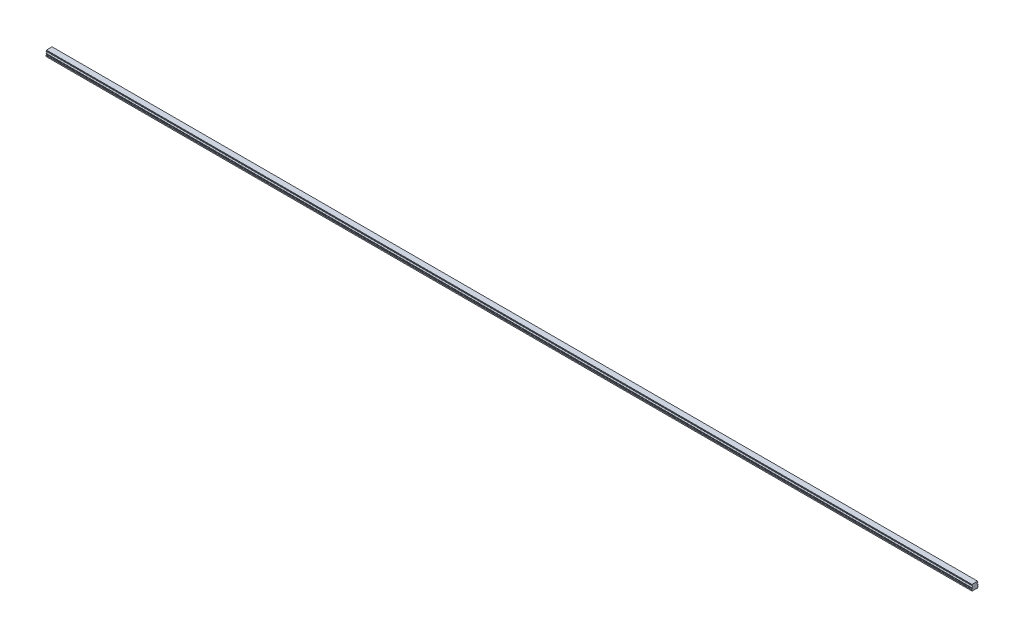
ISO-10303-21;
HEADER;
FILE_DESCRIPTION(('STEP AP214'),'2;1');
FILE_NAME('part.step','',(''),(''),'','','');
FILE_SCHEMA(('AUTOMOTIVE_DESIGN { 1 0 10303 214 1 1 1 1 }'));
ENDSEC;
DATA;
#1=APPLICATION_CONTEXT('core data for automotive mechanical design processes');
#2=APPLICATION_PROTOCOL_DEFINITION('international standard','automotive_design',2000,#1);
#3=PRODUCT_CONTEXT('',#1,'mechanical');
#4=PRODUCT('Part','Part','',(#3));
#5=PRODUCT_RELATED_PRODUCT_CATEGORY('part','',(#4));
#6=PRODUCT_DEFINITION_FORMATION('','',#4);
#7=PRODUCT_DEFINITION_CONTEXT('part definition',#1,'design');
#8=PRODUCT_DEFINITION('design','',#6,#7);
#9=PRODUCT_DEFINITION_SHAPE('','',#8);
#10=(LENGTH_UNIT() NAMED_UNIT(*) SI_UNIT(.MILLI.,.METRE.));
#11=(NAMED_UNIT(*) PLANE_ANGLE_UNIT() SI_UNIT($,.RADIAN.));
#12=(NAMED_UNIT(*) SI_UNIT($,.STERADIAN.) SOLID_ANGLE_UNIT());
#13=UNCERTAINTY_MEASURE_WITH_UNIT(LENGTH_MEASURE(1.E-05),#10,'distance_accuracy_value','');
#14=(GEOMETRIC_REPRESENTATION_CONTEXT(3) GLOBAL_UNCERTAINTY_ASSIGNED_CONTEXT((#13)) GLOBAL_UNIT_ASSIGNED_CONTEXT((#10,
#11,#12)) REPRESENTATION_CONTEXT('',''));
#15=CARTESIAN_POINT('',(0.,0.,0.));
#16=DIRECTION('',(0.,0.,1.));
#17=DIRECTION('',(1.,0.,0.));
#18=AXIS2_PLACEMENT_3D('',#15,#16,#17);
#19=CARTESIAN_POINT('',(2130.,0.399999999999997,0.));
#20=DIRECTION('',(0.,-1.,0.));
#21=DIRECTION('',(0.,0.,-1.));
#22=AXIS2_PLACEMENT_3D('',#19,#20,#21);
#23=CONICAL_SURFACE('',#22,2.89999999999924,0.785398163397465);
#24=CARTESIAN_POINT('',(2130.,0.79999999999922,0.));
#25=DIRECTION('',(0.,1.,0.));
#26=DIRECTION('',(0.,0.,1.));
#27=AXIS2_PLACEMENT_3D('',#24,#25,#26);
#28=CIRCLE('',#27,2.5);
#29=CARTESIAN_POINT('',(2130.,0.799999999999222,2.5));
#30=VERTEX_POINT('',#29);
#31=EDGE_CURVE('E11',#30,#30,#28,.F.);
#32=ORIENTED_EDGE('',*,*,#31,.F.);
#33=EDGE_LOOP('',(#32));
#34=FACE_BOUND('',#33,.T.);
#35=CARTESIAN_POINT('',(2130.,0.399999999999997,0.));
#36=DIRECTION('',(0.,1.,0.));
#37=DIRECTION('',(0.,0.,1.));
#38=AXIS2_PLACEMENT_3D('',#35,#36,#37);
#39=CIRCLE('',#38,2.89999999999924);
#40=CARTESIAN_POINT('',(2130.,0.399999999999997,2.89999999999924));
#41=VERTEX_POINT('',#40);
#42=EDGE_CURVE('E829',#41,#41,#39,.T.);
#43=ORIENTED_EDGE('',*,*,#42,.F.);
#44=EDGE_LOOP('',(#43));
#45=FACE_BOUND('',#44,.T.);
#46=ADVANCED_FACE('F39',(#34,#45),#23,.F.);
#47=CARTESIAN_POINT('',(2130.,7.,0.));
#48=DIRECTION('',(0.,-1.,0.));
#49=DIRECTION('',(0.,0.,-1.));
#50=AXIS2_PLACEMENT_3D('',#47,#48,#49);
#51=CYLINDRICAL_SURFACE('',#50,2.5);
#52=ORIENTED_EDGE('',*,*,#31,.T.);
#53=EDGE_LOOP('',(#52));
#54=FACE_BOUND('',#53,.T.);
#55=CARTESIAN_POINT('',(2130.,7.,0.));
#56=DIRECTION('',(0.,-1.,0.));
#57=DIRECTION('',(0.,0.,-1.));
#58=AXIS2_PLACEMENT_3D('',#55,#56,#57);
#59=CIRCLE('',#58,2.5);
#60=CARTESIAN_POINT('',(2130.,7.,-2.50000000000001));
#61=VERTEX_POINT('',#60);
#62=EDGE_CURVE('E49',#61,#61,#59,.T.);
#63=ORIENTED_EDGE('',*,*,#62,.F.);
#64=EDGE_LOOP('',(#63));
#65=FACE_BOUND('',#64,.T.);
#66=ADVANCED_FACE('F1205',(#54,#65),#51,.F.);
#67=CARTESIAN_POINT('',(2130.,7.,0.));
#68=DIRECTION('',(0.,-1.,0.));
#69=DIRECTION('',(0.,0.,-1.));
#70=AXIS2_PLACEMENT_3D('',#67,#68,#69);
#71=PLANE('',#70);
#72=CARTESIAN_POINT('',(2130.,7.,0.));
#73=DIRECTION('',(0.,-1.,0.));
#74=DIRECTION('',(0.,0.,-1.));
#75=AXIS2_PLACEMENT_3D('',#72,#73,#74);
#76=CIRCLE('',#75,2.1);
#77=CARTESIAN_POINT('',(2130.,7.,-2.1));
#78=VERTEX_POINT('',#77);
#79=EDGE_CURVE('E42',#78,#78,#76,.T.);
#80=ORIENTED_EDGE('',*,*,#79,.F.);
#81=EDGE_LOOP('',(#80));
#82=FACE_BOUND('',#81,.T.);
#83=ORIENTED_EDGE('',*,*,#62,.T.);
#84=EDGE_LOOP('',(#83));
#85=FACE_BOUND('',#84,.T.);
#86=ADVANCED_FACE('F1210',(#82,#85),#71,.T.);
#87=CARTESIAN_POINT('',(2070.,0.399999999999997,0.));
#88=DIRECTION('',(0.,-1.,0.));
#89=DIRECTION('',(0.,0.,-1.));
#90=AXIS2_PLACEMENT_3D('',#87,#88,#89);
#91=CONICAL_SURFACE('',#90,2.89999999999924,0.785398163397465);
#92=CARTESIAN_POINT('',(2070.,0.79999999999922,0.));
#93=DIRECTION('',(0.,1.,0.));
#94=DIRECTION('',(0.,0.,1.));
#95=AXIS2_PLACEMENT_3D('',#92,#93,#94);
#96=CIRCLE('',#95,2.5);
#97=CARTESIAN_POINT('',(2070.,0.799999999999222,2.5));
#98=VERTEX_POINT('',#97);
#99=EDGE_CURVE('E825',#98,#98,#96,.F.);
#100=ORIENTED_EDGE('',*,*,#99,.F.);
#101=EDGE_LOOP('',(#100));
#102=FACE_BOUND('',#101,.T.);
#103=CARTESIAN_POINT('',(2070.,0.399999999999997,0.));
#104=DIRECTION('',(0.,1.,0.));
#105=DIRECTION('',(0.,0.,1.));
#106=AXIS2_PLACEMENT_3D('',#103,#104,#105);
#107=CIRCLE('',#106,2.89999999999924);
#108=CARTESIAN_POINT('',(2070.,0.399999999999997,2.89999999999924));
#109=VERTEX_POINT('',#108);
#110=EDGE_CURVE('E817',#109,#109,#107,.T.);
#111=ORIENTED_EDGE('',*,*,#110,.F.);
#112=EDGE_LOOP('',(#111));
#113=FACE_BOUND('',#112,.T.);
#114=ADVANCED_FACE('F1681',(#102,#113),#91,.F.);
#115=CARTESIAN_POINT('',(2070.,7.,0.));
#116=DIRECTION('',(0.,-1.,0.));
#117=DIRECTION('',(0.,0.,-1.));
#118=AXIS2_PLACEMENT_3D('',#115,#116,#117);
#119=CYLINDRICAL_SURFACE('',#118,2.5);
#120=ORIENTED_EDGE('',*,*,#99,.T.);
#121=EDGE_LOOP('',(#120));
#122=FACE_BOUND('',#121,.T.);
#123=CARTESIAN_POINT('',(2070.,7.,0.));
#124=DIRECTION('',(0.,-1.,0.));
#125=DIRECTION('',(0.,0.,-1.));
#126=AXIS2_PLACEMENT_3D('',#123,#124,#125);
#127=CIRCLE('',#126,2.5);
#128=CARTESIAN_POINT('',(2070.,7.,-2.50000000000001));
#129=VERTEX_POINT('',#128);
#130=EDGE_CURVE('E821',#129,#129,#127,.T.);
#131=ORIENTED_EDGE('',*,*,#130,.F.);
#132=EDGE_LOOP('',(#131));
#133=FACE_BOUND('',#132,.T.);
#134=ADVANCED_FACE('F1677',(#122,#133),#119,.F.);
#135=CARTESIAN_POINT('',(2070.,7.,0.));
#136=DIRECTION('',(0.,-1.,0.));
#137=DIRECTION('',(0.,0.,-1.));
#138=AXIS2_PLACEMENT_3D('',#135,#136,#137);
#139=PLANE('',#138);
#140=CARTESIAN_POINT('',(2070.,7.,0.));
#141=DIRECTION('',(0.,-1.,0.));
#142=DIRECTION('',(0.,0.,-1.));
#143=AXIS2_PLACEMENT_3D('',#140,#141,#142);
#144=CIRCLE('',#143,2.1);
#145=CARTESIAN_POINT('',(2070.,7.,-2.1));
#146=VERTEX_POINT('',#145);
#147=EDGE_CURVE('E968',#146,#146,#144,.T.);
#148=ORIENTED_EDGE('',*,*,#147,.F.);
#149=EDGE_LOOP('',(#148));
#150=FACE_BOUND('',#149,.T.);
#151=ORIENTED_EDGE('',*,*,#130,.T.);
#152=EDGE_LOOP('',(#151));
#153=FACE_BOUND('',#152,.T.);
#154=ADVANCED_FACE('F1673',(#150,#153),#139,.T.);
#155=CARTESIAN_POINT('',(2010.,0.399999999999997,0.));
#156=DIRECTION('',(0.,-1.,0.));
#157=DIRECTION('',(0.,0.,-1.));
#158=AXIS2_PLACEMENT_3D('',#155,#156,#157);
#159=CONICAL_SURFACE('',#158,2.89999999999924,0.785398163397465);
#160=CARTESIAN_POINT('',(2010.,0.79999999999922,0.));
#161=DIRECTION('',(0.,1.,0.));
#162=DIRECTION('',(0.,0.,1.));
#163=AXIS2_PLACEMENT_3D('',#160,#161,#162);
#164=CIRCLE('',#163,2.5);
#165=CARTESIAN_POINT('',(2010.,0.799999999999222,2.5));
#166=VERTEX_POINT('',#165);
#167=EDGE_CURVE('E813',#166,#166,#164,.F.);
#168=ORIENTED_EDGE('',*,*,#167,.F.);
#169=EDGE_LOOP('',(#168));
#170=FACE_BOUND('',#169,.T.);
#171=CARTESIAN_POINT('',(2010.,0.399999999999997,0.));
#172=DIRECTION('',(0.,1.,0.));
#173=DIRECTION('',(0.,0.,1.));
#174=AXIS2_PLACEMENT_3D('',#171,#172,#173);
#175=CIRCLE('',#174,2.89999999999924);
#176=CARTESIAN_POINT('',(2010.,0.399999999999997,2.89999999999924));
#177=VERTEX_POINT('',#176);
#178=EDGE_CURVE('E805',#177,#177,#175,.T.);
#179=ORIENTED_EDGE('',*,*,#178,.F.);
#180=EDGE_LOOP('',(#179));
#181=FACE_BOUND('',#180,.T.);
#182=ADVANCED_FACE('F1669',(#170,#181),#159,.F.);
#183=CARTESIAN_POINT('',(2010.,7.,0.));
#184=DIRECTION('',(0.,-1.,0.));
#185=DIRECTION('',(0.,0.,-1.));
#186=AXIS2_PLACEMENT_3D('',#183,#184,#185);
#187=CYLINDRICAL_SURFACE('',#186,2.5);
#188=ORIENTED_EDGE('',*,*,#167,.T.);
#189=EDGE_LOOP('',(#188));
#190=FACE_BOUND('',#189,.T.);
#191=CARTESIAN_POINT('',(2010.,7.,0.));
#192=DIRECTION('',(0.,-1.,0.));
#193=DIRECTION('',(0.,0.,-1.));
#194=AXIS2_PLACEMENT_3D('',#191,#192,#193);
#195=CIRCLE('',#194,2.5);
#196=CARTESIAN_POINT('',(2010.,7.,-2.50000000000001));
#197=VERTEX_POINT('',#196);
#198=EDGE_CURVE('E809',#197,#197,#195,.T.);
#199=ORIENTED_EDGE('',*,*,#198,.F.);
#200=EDGE_LOOP('',(#199));
#201=FACE_BOUND('',#200,.T.);
#202=ADVANCED_FACE('F1665',(#190,#201),#187,.F.);
#203=CARTESIAN_POINT('',(2010.,7.,0.));
#204=DIRECTION('',(0.,-1.,0.));
#205=DIRECTION('',(0.,0.,-1.));
#206=AXIS2_PLACEMENT_3D('',#203,#204,#205);
#207=PLANE('',#206);
#208=CARTESIAN_POINT('',(2010.,7.,0.));
#209=DIRECTION('',(0.,-1.,0.));
#210=DIRECTION('',(0.,0.,-1.));
#211=AXIS2_PLACEMENT_3D('',#208,#209,#210);
#212=CIRCLE('',#211,2.1);
#213=CARTESIAN_POINT('',(2010.,7.,-2.1));
#214=VERTEX_POINT('',#213);
#215=EDGE_CURVE('E965',#214,#214,#212,.T.);
#216=ORIENTED_EDGE('',*,*,#215,.F.);
#217=EDGE_LOOP('',(#216));
#218=FACE_BOUND('',#217,.T.);
#219=ORIENTED_EDGE('',*,*,#198,.T.);
#220=EDGE_LOOP('',(#219));
#221=FACE_BOUND('',#220,.T.);
#222=ADVANCED_FACE('F1661',(#218,#221),#207,.T.);
#223=CARTESIAN_POINT('',(1950.,0.399999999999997,0.));
#224=DIRECTION('',(0.,-1.,0.));
#225=DIRECTION('',(0.,0.,-1.));
#226=AXIS2_PLACEMENT_3D('',#223,#224,#225);
#227=CONICAL_SURFACE('',#226,2.89999999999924,0.785398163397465);
#228=CARTESIAN_POINT('',(1950.,0.79999999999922,0.));
#229=DIRECTION('',(0.,1.,0.));
#230=DIRECTION('',(0.,0.,1.));
#231=AXIS2_PLACEMENT_3D('',#228,#229,#230);
#232=CIRCLE('',#231,2.5);
#233=CARTESIAN_POINT('',(1950.,0.799999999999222,2.5));
#234=VERTEX_POINT('',#233);
#235=EDGE_CURVE('E801',#234,#234,#232,.F.);
#236=ORIENTED_EDGE('',*,*,#235,.F.);
#237=EDGE_LOOP('',(#236));
#238=FACE_BOUND('',#237,.T.);
#239=CARTESIAN_POINT('',(1950.,0.399999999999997,0.));
#240=DIRECTION('',(0.,1.,0.));
#241=DIRECTION('',(0.,0.,1.));
#242=AXIS2_PLACEMENT_3D('',#239,#240,#241);
#243=CIRCLE('',#242,2.89999999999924);
#244=CARTESIAN_POINT('',(1950.,0.399999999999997,2.89999999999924));
#245=VERTEX_POINT('',#244);
#246=EDGE_CURVE('E793',#245,#245,#243,.T.);
#247=ORIENTED_EDGE('',*,*,#246,.F.);
#248=EDGE_LOOP('',(#247));
#249=FACE_BOUND('',#248,.T.);
#250=ADVANCED_FACE('F1657',(#238,#249),#227,.F.);
#251=CARTESIAN_POINT('',(1950.,7.,0.));
#252=DIRECTION('',(0.,-1.,0.));
#253=DIRECTION('',(0.,0.,-1.));
#254=AXIS2_PLACEMENT_3D('',#251,#252,#253);
#255=CYLINDRICAL_SURFACE('',#254,2.5);
#256=ORIENTED_EDGE('',*,*,#235,.T.);
#257=EDGE_LOOP('',(#256));
#258=FACE_BOUND('',#257,.T.);
#259=CARTESIAN_POINT('',(1950.,7.,0.));
#260=DIRECTION('',(0.,-1.,0.));
#261=DIRECTION('',(0.,0.,-1.));
#262=AXIS2_PLACEMENT_3D('',#259,#260,#261);
#263=CIRCLE('',#262,2.5);
#264=CARTESIAN_POINT('',(1950.,7.,-2.50000000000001));
#265=VERTEX_POINT('',#264);
#266=EDGE_CURVE('E797',#265,#265,#263,.T.);
#267=ORIENTED_EDGE('',*,*,#266,.F.);
#268=EDGE_LOOP('',(#267));
#269=FACE_BOUND('',#268,.T.);
#270=ADVANCED_FACE('F1653',(#258,#269),#255,.F.);
#271=CARTESIAN_POINT('',(1950.,7.,0.));
#272=DIRECTION('',(0.,-1.,0.));
#273=DIRECTION('',(0.,0.,-1.));
#274=AXIS2_PLACEMENT_3D('',#271,#272,#273);
#275=PLANE('',#274);
#276=CARTESIAN_POINT('',(1950.,7.,0.));
#277=DIRECTION('',(0.,-1.,0.));
#278=DIRECTION('',(0.,0.,-1.));
#279=AXIS2_PLACEMENT_3D('',#276,#277,#278);
#280=CIRCLE('',#279,2.1);
#281=CARTESIAN_POINT('',(1950.,7.,-2.1));
#282=VERTEX_POINT('',#281);
#283=EDGE_CURVE('E961',#282,#282,#280,.T.);
#284=ORIENTED_EDGE('',*,*,#283,.F.);
#285=EDGE_LOOP('',(#284));
#286=FACE_BOUND('',#285,.T.);
#287=ORIENTED_EDGE('',*,*,#266,.T.);
#288=EDGE_LOOP('',(#287));
#289=FACE_BOUND('',#288,.T.);
#290=ADVANCED_FACE('F1649',(#286,#289),#275,.T.);
#291=CARTESIAN_POINT('',(1890.,0.399999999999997,0.));
#292=DIRECTION('',(0.,-1.,0.));
#293=DIRECTION('',(0.,0.,-1.));
#294=AXIS2_PLACEMENT_3D('',#291,#292,#293);
#295=CONICAL_SURFACE('',#294,2.89999999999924,0.785398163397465);
#296=CARTESIAN_POINT('',(1890.,0.79999999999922,0.));
#297=DIRECTION('',(0.,1.,0.));
#298=DIRECTION('',(0.,0.,1.));
#299=AXIS2_PLACEMENT_3D('',#296,#297,#298);
#300=CIRCLE('',#299,2.5);
#301=CARTESIAN_POINT('',(1890.,0.799999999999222,2.5));
#302=VERTEX_POINT('',#301);
#303=EDGE_CURVE('E789',#302,#302,#300,.F.);
#304=ORIENTED_EDGE('',*,*,#303,.F.);
#305=EDGE_LOOP('',(#304));
#306=FACE_BOUND('',#305,.T.);
#307=CARTESIAN_POINT('',(1890.,0.399999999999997,0.));
#308=DIRECTION('',(0.,1.,0.));
#309=DIRECTION('',(0.,0.,1.));
#310=AXIS2_PLACEMENT_3D('',#307,#308,#309);
#311=CIRCLE('',#310,2.89999999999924);
#312=CARTESIAN_POINT('',(1890.,0.399999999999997,2.89999999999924));
#313=VERTEX_POINT('',#312);
#314=EDGE_CURVE('E781',#313,#313,#311,.T.);
#315=ORIENTED_EDGE('',*,*,#314,.F.);
#316=EDGE_LOOP('',(#315));
#317=FACE_BOUND('',#316,.T.);
#318=ADVANCED_FACE('F1645',(#306,#317),#295,.F.);
#319=CARTESIAN_POINT('',(1890.,7.,0.));
#320=DIRECTION('',(0.,-1.,0.));
#321=DIRECTION('',(0.,0.,-1.));
#322=AXIS2_PLACEMENT_3D('',#319,#320,#321);
#323=CYLINDRICAL_SURFACE('',#322,2.5);
#324=ORIENTED_EDGE('',*,*,#303,.T.);
#325=EDGE_LOOP('',(#324));
#326=FACE_BOUND('',#325,.T.);
#327=CARTESIAN_POINT('',(1890.,7.,0.));
#328=DIRECTION('',(0.,-1.,0.));
#329=DIRECTION('',(0.,0.,-1.));
#330=AXIS2_PLACEMENT_3D('',#327,#328,#329);
#331=CIRCLE('',#330,2.5);
#332=CARTESIAN_POINT('',(1890.,7.,-2.50000000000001));
#333=VERTEX_POINT('',#332);
#334=EDGE_CURVE('E785',#333,#333,#331,.T.);
#335=ORIENTED_EDGE('',*,*,#334,.F.);
#336=EDGE_LOOP('',(#335));
#337=FACE_BOUND('',#336,.T.);
#338=ADVANCED_FACE('F1641',(#326,#337),#323,.F.);
#339=CARTESIAN_POINT('',(1890.,7.,0.));
#340=DIRECTION('',(0.,-1.,0.));
#341=DIRECTION('',(0.,0.,-1.));
#342=AXIS2_PLACEMENT_3D('',#339,#340,#341);
#343=PLANE('',#342);
#344=CARTESIAN_POINT('',(1890.,7.,0.));
#345=DIRECTION('',(0.,-1.,0.));
#346=DIRECTION('',(0.,0.,-1.));
#347=AXIS2_PLACEMENT_3D('',#344,#345,#346);
#348=CIRCLE('',#347,2.1);
#349=CARTESIAN_POINT('',(1890.,7.,-2.1));
#350=VERTEX_POINT('',#349);
#351=EDGE_CURVE('E957',#350,#350,#348,.T.);
#352=ORIENTED_EDGE('',*,*,#351,.F.);
#353=EDGE_LOOP('',(#352));
#354=FACE_BOUND('',#353,.T.);
#355=ORIENTED_EDGE('',*,*,#334,.T.);
#356=EDGE_LOOP('',(#355));
#357=FACE_BOUND('',#356,.T.);
#358=ADVANCED_FACE('F1637',(#354,#357),#343,.T.);
#359=CARTESIAN_POINT('',(1830.,0.399999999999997,0.));
#360=DIRECTION('',(0.,-1.,0.));
#361=DIRECTION('',(0.,0.,-1.));
#362=AXIS2_PLACEMENT_3D('',#359,#360,#361);
#363=CONICAL_SURFACE('',#362,2.89999999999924,0.785398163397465);
#364=CARTESIAN_POINT('',(1830.,0.79999999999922,0.));
#365=DIRECTION('',(0.,1.,0.));
#366=DIRECTION('',(0.,0.,1.));
#367=AXIS2_PLACEMENT_3D('',#364,#365,#366);
#368=CIRCLE('',#367,2.5);
#369=CARTESIAN_POINT('',(1830.,0.799999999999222,2.5));
#370=VERTEX_POINT('',#369);
#371=EDGE_CURVE('E777',#370,#370,#368,.F.);
#372=ORIENTED_EDGE('',*,*,#371,.F.);
#373=EDGE_LOOP('',(#372));
#374=FACE_BOUND('',#373,.T.);
#375=CARTESIAN_POINT('',(1830.,0.399999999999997,0.));
#376=DIRECTION('',(0.,1.,0.));
#377=DIRECTION('',(0.,0.,1.));
#378=AXIS2_PLACEMENT_3D('',#375,#376,#377);
#379=CIRCLE('',#378,2.89999999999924);
#380=CARTESIAN_POINT('',(1830.,0.399999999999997,2.89999999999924));
#381=VERTEX_POINT('',#380);
#382=EDGE_CURVE('E769',#381,#381,#379,.T.);
#383=ORIENTED_EDGE('',*,*,#382,.F.);
#384=EDGE_LOOP('',(#383));
#385=FACE_BOUND('',#384,.T.);
#386=ADVANCED_FACE('F1633',(#374,#385),#363,.F.);
#387=CARTESIAN_POINT('',(1830.,7.,0.));
#388=DIRECTION('',(0.,-1.,0.));
#389=DIRECTION('',(0.,0.,-1.));
#390=AXIS2_PLACEMENT_3D('',#387,#388,#389);
#391=CYLINDRICAL_SURFACE('',#390,2.5);
#392=ORIENTED_EDGE('',*,*,#371,.T.);
#393=EDGE_LOOP('',(#392));
#394=FACE_BOUND('',#393,.T.);
#395=CARTESIAN_POINT('',(1830.,7.,0.));
#396=DIRECTION('',(0.,-1.,0.));
#397=DIRECTION('',(0.,0.,-1.));
#398=AXIS2_PLACEMENT_3D('',#395,#396,#397);
#399=CIRCLE('',#398,2.5);
#400=CARTESIAN_POINT('',(1830.,7.,-2.50000000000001));
#401=VERTEX_POINT('',#400);
#402=EDGE_CURVE('E773',#401,#401,#399,.T.);
#403=ORIENTED_EDGE('',*,*,#402,.F.);
#404=EDGE_LOOP('',(#403));
#405=FACE_BOUND('',#404,.T.);
#406=ADVANCED_FACE('F1629',(#394,#405),#391,.F.);
#407=CARTESIAN_POINT('',(1830.,7.,0.));
#408=DIRECTION('',(0.,-1.,0.));
#409=DIRECTION('',(0.,0.,-1.));
#410=AXIS2_PLACEMENT_3D('',#407,#408,#409);
#411=PLANE('',#410);
#412=CARTESIAN_POINT('',(1830.,7.,0.));
#413=DIRECTION('',(0.,-1.,0.));
#414=DIRECTION('',(0.,0.,-1.));
#415=AXIS2_PLACEMENT_3D('',#412,#413,#414);
#416=CIRCLE('',#415,2.1);
#417=CARTESIAN_POINT('',(1830.,7.,-2.1));
#418=VERTEX_POINT('',#417);
#419=EDGE_CURVE('E953',#418,#418,#416,.T.);
#420=ORIENTED_EDGE('',*,*,#419,.F.);
#421=EDGE_LOOP('',(#420));
#422=FACE_BOUND('',#421,.T.);
#423=ORIENTED_EDGE('',*,*,#402,.T.);
#424=EDGE_LOOP('',(#423));
#425=FACE_BOUND('',#424,.T.);
#426=ADVANCED_FACE('F1625',(#422,#425),#411,.T.);
#427=CARTESIAN_POINT('',(1770.,0.399999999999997,0.));
#428=DIRECTION('',(0.,-1.,0.));
#429=DIRECTION('',(0.,0.,-1.));
#430=AXIS2_PLACEMENT_3D('',#427,#428,#429);
#431=CONICAL_SURFACE('',#430,2.89999999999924,0.785398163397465);
#432=CARTESIAN_POINT('',(1770.,0.79999999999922,0.));
#433=DIRECTION('',(0.,1.,0.));
#434=DIRECTION('',(0.,0.,1.));
#435=AXIS2_PLACEMENT_3D('',#432,#433,#434);
#436=CIRCLE('',#435,2.5);
#437=CARTESIAN_POINT('',(1770.,0.799999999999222,2.5));
#438=VERTEX_POINT('',#437);
#439=EDGE_CURVE('E765',#438,#438,#436,.F.);
#440=ORIENTED_EDGE('',*,*,#439,.F.);
#441=EDGE_LOOP('',(#440));
#442=FACE_BOUND('',#441,.T.);
#443=CARTESIAN_POINT('',(1770.,0.399999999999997,0.));
#444=DIRECTION('',(0.,1.,0.));
#445=DIRECTION('',(0.,0.,1.));
#446=AXIS2_PLACEMENT_3D('',#443,#444,#445);
#447=CIRCLE('',#446,2.89999999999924);
#448=CARTESIAN_POINT('',(1770.,0.399999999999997,2.89999999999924));
#449=VERTEX_POINT('',#448);
#450=EDGE_CURVE('E757',#449,#449,#447,.T.);
#451=ORIENTED_EDGE('',*,*,#450,.F.);
#452=EDGE_LOOP('',(#451));
#453=FACE_BOUND('',#452,.T.);
#454=ADVANCED_FACE('F1621',(#442,#453),#431,.F.);
#455=CARTESIAN_POINT('',(1770.,7.,0.));
#456=DIRECTION('',(0.,-1.,0.));
#457=DIRECTION('',(0.,0.,-1.));
#458=AXIS2_PLACEMENT_3D('',#455,#456,#457);
#459=CYLINDRICAL_SURFACE('',#458,2.5);
#460=ORIENTED_EDGE('',*,*,#439,.T.);
#461=EDGE_LOOP('',(#460));
#462=FACE_BOUND('',#461,.T.);
#463=CARTESIAN_POINT('',(1770.,7.,0.));
#464=DIRECTION('',(0.,-1.,0.));
#465=DIRECTION('',(0.,0.,-1.));
#466=AXIS2_PLACEMENT_3D('',#463,#464,#465);
#467=CIRCLE('',#466,2.5);
#468=CARTESIAN_POINT('',(1770.,7.,-2.50000000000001));
#469=VERTEX_POINT('',#468);
#470=EDGE_CURVE('E761',#469,#469,#467,.T.);
#471=ORIENTED_EDGE('',*,*,#470,.F.);
#472=EDGE_LOOP('',(#471));
#473=FACE_BOUND('',#472,.T.);
#474=ADVANCED_FACE('F1617',(#462,#473),#459,.F.);
#475=CARTESIAN_POINT('',(1770.,7.,0.));
#476=DIRECTION('',(0.,-1.,0.));
#477=DIRECTION('',(0.,0.,-1.));
#478=AXIS2_PLACEMENT_3D('',#475,#476,#477);
#479=PLANE('',#478);
#480=CARTESIAN_POINT('',(1770.,7.,0.));
#481=DIRECTION('',(0.,-1.,0.));
#482=DIRECTION('',(0.,0.,-1.));
#483=AXIS2_PLACEMENT_3D('',#480,#481,#482);
#484=CIRCLE('',#483,2.1);
#485=CARTESIAN_POINT('',(1770.,7.,-2.1));
#486=VERTEX_POINT('',#485);
#487=EDGE_CURVE('E949',#486,#486,#484,.T.);
#488=ORIENTED_EDGE('',*,*,#487,.F.);
#489=EDGE_LOOP('',(#488));
#490=FACE_BOUND('',#489,.T.);
#491=ORIENTED_EDGE('',*,*,#470,.T.);
#492=EDGE_LOOP('',(#491));
#493=FACE_BOUND('',#492,.T.);
#494=ADVANCED_FACE('F1613',(#490,#493),#479,.T.);
#495=CARTESIAN_POINT('',(1710.,0.399999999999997,0.));
#496=DIRECTION('',(0.,-1.,0.));
#497=DIRECTION('',(0.,0.,-1.));
#498=AXIS2_PLACEMENT_3D('',#495,#496,#497);
#499=CONICAL_SURFACE('',#498,2.89999999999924,0.785398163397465);
#500=CARTESIAN_POINT('',(1710.,0.79999999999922,0.));
#501=DIRECTION('',(0.,1.,0.));
#502=DIRECTION('',(0.,0.,1.));
#503=AXIS2_PLACEMENT_3D('',#500,#501,#502);
#504=CIRCLE('',#503,2.5);
#505=CARTESIAN_POINT('',(1710.,0.799999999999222,2.5));
#506=VERTEX_POINT('',#505);
#507=EDGE_CURVE('E753',#506,#506,#504,.F.);
#508=ORIENTED_EDGE('',*,*,#507,.F.);
#509=EDGE_LOOP('',(#508));
#510=FACE_BOUND('',#509,.T.);
#511=CARTESIAN_POINT('',(1710.,0.399999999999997,0.));
#512=DIRECTION('',(0.,1.,0.));
#513=DIRECTION('',(0.,0.,1.));
#514=AXIS2_PLACEMENT_3D('',#511,#512,#513);
#515=CIRCLE('',#514,2.89999999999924);
#516=CARTESIAN_POINT('',(1710.,0.399999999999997,2.89999999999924));
#517=VERTEX_POINT('',#516);
#518=EDGE_CURVE('E745',#517,#517,#515,.T.);
#519=ORIENTED_EDGE('',*,*,#518,.F.);
#520=EDGE_LOOP('',(#519));
#521=FACE_BOUND('',#520,.T.);
#522=ADVANCED_FACE('F1609',(#510,#521),#499,.F.);
#523=CARTESIAN_POINT('',(1710.,7.,0.));
#524=DIRECTION('',(0.,-1.,0.));
#525=DIRECTION('',(0.,0.,-1.));
#526=AXIS2_PLACEMENT_3D('',#523,#524,#525);
#527=CYLINDRICAL_SURFACE('',#526,2.5);
#528=ORIENTED_EDGE('',*,*,#507,.T.);
#529=EDGE_LOOP('',(#528));
#530=FACE_BOUND('',#529,.T.);
#531=CARTESIAN_POINT('',(1710.,7.,0.));
#532=DIRECTION('',(0.,-1.,0.));
#533=DIRECTION('',(0.,0.,-1.));
#534=AXIS2_PLACEMENT_3D('',#531,#532,#533);
#535=CIRCLE('',#534,2.5);
#536=CARTESIAN_POINT('',(1710.,7.,-2.50000000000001));
#537=VERTEX_POINT('',#536);
#538=EDGE_CURVE('E749',#537,#537,#535,.T.);
#539=ORIENTED_EDGE('',*,*,#538,.F.);
#540=EDGE_LOOP('',(#539));
#541=FACE_BOUND('',#540,.T.);
#542=ADVANCED_FACE('F1605',(#530,#541),#527,.F.);
#543=CARTESIAN_POINT('',(1710.,7.,0.));
#544=DIRECTION('',(0.,-1.,0.));
#545=DIRECTION('',(0.,0.,-1.));
#546=AXIS2_PLACEMENT_3D('',#543,#544,#545);
#547=PLANE('',#546);
#548=CARTESIAN_POINT('',(1710.,7.,0.));
#549=DIRECTION('',(0.,-1.,0.));
#550=DIRECTION('',(0.,0.,-1.));
#551=AXIS2_PLACEMENT_3D('',#548,#549,#550);
#552=CIRCLE('',#551,2.1);
#553=CARTESIAN_POINT('',(1710.,7.,-2.1));
#554=VERTEX_POINT('',#553);
#555=EDGE_CURVE('E945',#554,#554,#552,.T.);
#556=ORIENTED_EDGE('',*,*,#555,.F.);
#557=EDGE_LOOP('',(#556));
#558=FACE_BOUND('',#557,.T.);
#559=ORIENTED_EDGE('',*,*,#538,.T.);
#560=EDGE_LOOP('',(#559));
#561=FACE_BOUND('',#560,.T.);
#562=ADVANCED_FACE('F1601',(#558,#561),#547,.T.);
#563=CARTESIAN_POINT('',(1650.,0.399999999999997,0.));
#564=DIRECTION('',(0.,-1.,0.));
#565=DIRECTION('',(0.,0.,-1.));
#566=AXIS2_PLACEMENT_3D('',#563,#564,#565);
#567=CONICAL_SURFACE('',#566,2.89999999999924,0.785398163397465);
#568=CARTESIAN_POINT('',(1650.,0.79999999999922,0.));
#569=DIRECTION('',(0.,1.,0.));
#570=DIRECTION('',(0.,0.,1.));
#571=AXIS2_PLACEMENT_3D('',#568,#569,#570);
#572=CIRCLE('',#571,2.5);
#573=CARTESIAN_POINT('',(1650.,0.799999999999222,2.5));
#574=VERTEX_POINT('',#573);
#575=EDGE_CURVE('E741',#574,#574,#572,.F.);
#576=ORIENTED_EDGE('',*,*,#575,.F.);
#577=EDGE_LOOP('',(#576));
#578=FACE_BOUND('',#577,.T.);
#579=CARTESIAN_POINT('',(1650.,0.399999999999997,0.));
#580=DIRECTION('',(0.,1.,0.));
#581=DIRECTION('',(0.,0.,1.));
#582=AXIS2_PLACEMENT_3D('',#579,#580,#581);
#583=CIRCLE('',#582,2.89999999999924);
#584=CARTESIAN_POINT('',(1650.,0.399999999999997,2.89999999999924));
#585=VERTEX_POINT('',#584);
#586=EDGE_CURVE('E733',#585,#585,#583,.T.);
#587=ORIENTED_EDGE('',*,*,#586,.F.);
#588=EDGE_LOOP('',(#587));
#589=FACE_BOUND('',#588,.T.);
#590=ADVANCED_FACE('F1597',(#578,#589),#567,.F.);
#591=CARTESIAN_POINT('',(1650.,7.,0.));
#592=DIRECTION('',(0.,-1.,0.));
#593=DIRECTION('',(0.,0.,-1.));
#594=AXIS2_PLACEMENT_3D('',#591,#592,#593);
#595=CYLINDRICAL_SURFACE('',#594,2.5);
#596=ORIENTED_EDGE('',*,*,#575,.T.);
#597=EDGE_LOOP('',(#596));
#598=FACE_BOUND('',#597,.T.);
#599=CARTESIAN_POINT('',(1650.,7.,0.));
#600=DIRECTION('',(0.,-1.,0.));
#601=DIRECTION('',(0.,0.,-1.));
#602=AXIS2_PLACEMENT_3D('',#599,#600,#601);
#603=CIRCLE('',#602,2.5);
#604=CARTESIAN_POINT('',(1650.,7.,-2.50000000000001));
#605=VERTEX_POINT('',#604);
#606=EDGE_CURVE('E737',#605,#605,#603,.T.);
#607=ORIENTED_EDGE('',*,*,#606,.F.);
#608=EDGE_LOOP('',(#607));
#609=FACE_BOUND('',#608,.T.);
#610=ADVANCED_FACE('F1593',(#598,#609),#595,.F.);
#611=CARTESIAN_POINT('',(1650.,7.,0.));
#612=DIRECTION('',(0.,-1.,0.));
#613=DIRECTION('',(0.,0.,-1.));
#614=AXIS2_PLACEMENT_3D('',#611,#612,#613);
#615=PLANE('',#614);
#616=CARTESIAN_POINT('',(1650.,7.,0.));
#617=DIRECTION('',(0.,-1.,0.));
#618=DIRECTION('',(0.,0.,-1.));
#619=AXIS2_PLACEMENT_3D('',#616,#617,#618);
#620=CIRCLE('',#619,2.1);
#621=CARTESIAN_POINT('',(1650.,7.,-2.1));
#622=VERTEX_POINT('',#621);
#623=EDGE_CURVE('E941',#622,#622,#620,.T.);
#624=ORIENTED_EDGE('',*,*,#623,.F.);
#625=EDGE_LOOP('',(#624));
#626=FACE_BOUND('',#625,.T.);
#627=ORIENTED_EDGE('',*,*,#606,.T.);
#628=EDGE_LOOP('',(#627));
#629=FACE_BOUND('',#628,.T.);
#630=ADVANCED_FACE('F1589',(#626,#629),#615,.T.);
#631=CARTESIAN_POINT('',(1590.,0.399999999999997,0.));
#632=DIRECTION('',(0.,-1.,0.));
#633=DIRECTION('',(0.,0.,-1.));
#634=AXIS2_PLACEMENT_3D('',#631,#632,#633);
#635=CONICAL_SURFACE('',#634,2.89999999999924,0.785398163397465);
#636=CARTESIAN_POINT('',(1590.,0.79999999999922,0.));
#637=DIRECTION('',(0.,1.,0.));
#638=DIRECTION('',(0.,0.,1.));
#639=AXIS2_PLACEMENT_3D('',#636,#637,#638);
#640=CIRCLE('',#639,2.5);
#641=CARTESIAN_POINT('',(1590.,0.799999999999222,2.5));
#642=VERTEX_POINT('',#641);
#643=EDGE_CURVE('E729',#642,#642,#640,.F.);
#644=ORIENTED_EDGE('',*,*,#643,.F.);
#645=EDGE_LOOP('',(#644));
#646=FACE_BOUND('',#645,.T.);
#647=CARTESIAN_POINT('',(1590.,0.399999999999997,0.));
#648=DIRECTION('',(0.,1.,0.));
#649=DIRECTION('',(0.,0.,1.));
#650=AXIS2_PLACEMENT_3D('',#647,#648,#649);
#651=CIRCLE('',#650,2.89999999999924);
#652=CARTESIAN_POINT('',(1590.,0.399999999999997,2.89999999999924));
#653=VERTEX_POINT('',#652);
#654=EDGE_CURVE('E721',#653,#653,#651,.T.);
#655=ORIENTED_EDGE('',*,*,#654,.F.);
#656=EDGE_LOOP('',(#655));
#657=FACE_BOUND('',#656,.T.);
#658=ADVANCED_FACE('F1585',(#646,#657),#635,.F.);
#659=CARTESIAN_POINT('',(1590.,7.,0.));
#660=DIRECTION('',(0.,-1.,0.));
#661=DIRECTION('',(0.,0.,-1.));
#662=AXIS2_PLACEMENT_3D('',#659,#660,#661);
#663=CYLINDRICAL_SURFACE('',#662,2.5);
#664=ORIENTED_EDGE('',*,*,#643,.T.);
#665=EDGE_LOOP('',(#664));
#666=FACE_BOUND('',#665,.T.);
#667=CARTESIAN_POINT('',(1590.,7.,0.));
#668=DIRECTION('',(0.,-1.,0.));
#669=DIRECTION('',(0.,0.,-1.));
#670=AXIS2_PLACEMENT_3D('',#667,#668,#669);
#671=CIRCLE('',#670,2.5);
#672=CARTESIAN_POINT('',(1590.,7.,-2.50000000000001));
#673=VERTEX_POINT('',#672);
#674=EDGE_CURVE('E725',#673,#673,#671,.T.);
#675=ORIENTED_EDGE('',*,*,#674,.F.);
#676=EDGE_LOOP('',(#675));
#677=FACE_BOUND('',#676,.T.);
#678=ADVANCED_FACE('F1581',(#666,#677),#663,.F.);
#679=CARTESIAN_POINT('',(1590.,7.,0.));
#680=DIRECTION('',(0.,-1.,0.));
#681=DIRECTION('',(0.,0.,-1.));
#682=AXIS2_PLACEMENT_3D('',#679,#680,#681);
#683=PLANE('',#682);
#684=CARTESIAN_POINT('',(1590.,7.,0.));
#685=DIRECTION('',(0.,-1.,0.));
#686=DIRECTION('',(0.,0.,-1.));
#687=AXIS2_PLACEMENT_3D('',#684,#685,#686);
#688=CIRCLE('',#687,2.1);
#689=CARTESIAN_POINT('',(1590.,7.,-2.1));
#690=VERTEX_POINT('',#689);
#691=EDGE_CURVE('E937',#690,#690,#688,.T.);
#692=ORIENTED_EDGE('',*,*,#691,.F.);
#693=EDGE_LOOP('',(#692));
#694=FACE_BOUND('',#693,.T.);
#695=ORIENTED_EDGE('',*,*,#674,.T.);
#696=EDGE_LOOP('',(#695));
#697=FACE_BOUND('',#696,.T.);
#698=ADVANCED_FACE('F1577',(#694,#697),#683,.T.);
#699=CARTESIAN_POINT('',(1530.,0.399999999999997,0.));
#700=DIRECTION('',(0.,-1.,0.));
#701=DIRECTION('',(0.,0.,-1.));
#702=AXIS2_PLACEMENT_3D('',#699,#700,#701);
#703=CONICAL_SURFACE('',#702,2.89999999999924,0.785398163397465);
#704=CARTESIAN_POINT('',(1530.,0.79999999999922,0.));
#705=DIRECTION('',(0.,1.,0.));
#706=DIRECTION('',(0.,0.,1.));
#707=AXIS2_PLACEMENT_3D('',#704,#705,#706);
#708=CIRCLE('',#707,2.5);
#709=CARTESIAN_POINT('',(1530.,0.799999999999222,2.5));
#710=VERTEX_POINT('',#709);
#711=EDGE_CURVE('E717',#710,#710,#708,.F.);
#712=ORIENTED_EDGE('',*,*,#711,.F.);
#713=EDGE_LOOP('',(#712));
#714=FACE_BOUND('',#713,.T.);
#715=CARTESIAN_POINT('',(1530.,0.399999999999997,0.));
#716=DIRECTION('',(0.,1.,0.));
#717=DIRECTION('',(0.,0.,1.));
#718=AXIS2_PLACEMENT_3D('',#715,#716,#717);
#719=CIRCLE('',#718,2.89999999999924);
#720=CARTESIAN_POINT('',(1530.,0.399999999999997,2.89999999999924));
#721=VERTEX_POINT('',#720);
#722=EDGE_CURVE('E709',#721,#721,#719,.T.);
#723=ORIENTED_EDGE('',*,*,#722,.F.);
#724=EDGE_LOOP('',(#723));
#725=FACE_BOUND('',#724,.T.);
#726=ADVANCED_FACE('F1573',(#714,#725),#703,.F.);
#727=CARTESIAN_POINT('',(1530.,7.,0.));
#728=DIRECTION('',(0.,-1.,0.));
#729=DIRECTION('',(0.,0.,-1.));
#730=AXIS2_PLACEMENT_3D('',#727,#728,#729);
#731=CYLINDRICAL_SURFACE('',#730,2.5);
#732=ORIENTED_EDGE('',*,*,#711,.T.);
#733=EDGE_LOOP('',(#732));
#734=FACE_BOUND('',#733,.T.);
#735=CARTESIAN_POINT('',(1530.,7.,0.));
#736=DIRECTION('',(0.,-1.,0.));
#737=DIRECTION('',(0.,0.,-1.));
#738=AXIS2_PLACEMENT_3D('',#735,#736,#737);
#739=CIRCLE('',#738,2.5);
#740=CARTESIAN_POINT('',(1530.,7.,-2.50000000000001));
#741=VERTEX_POINT('',#740);
#742=EDGE_CURVE('E713',#741,#741,#739,.T.);
#743=ORIENTED_EDGE('',*,*,#742,.F.);
#744=EDGE_LOOP('',(#743));
#745=FACE_BOUND('',#744,.T.);
#746=ADVANCED_FACE('F1569',(#734,#745),#731,.F.);
#747=CARTESIAN_POINT('',(1530.,7.,0.));
#748=DIRECTION('',(0.,-1.,0.));
#749=DIRECTION('',(0.,0.,-1.));
#750=AXIS2_PLACEMENT_3D('',#747,#748,#749);
#751=PLANE('',#750);
#752=CARTESIAN_POINT('',(1530.,7.,0.));
#753=DIRECTION('',(0.,-1.,0.));
#754=DIRECTION('',(0.,0.,-1.));
#755=AXIS2_PLACEMENT_3D('',#752,#753,#754);
#756=CIRCLE('',#755,2.1);
#757=CARTESIAN_POINT('',(1530.,7.,-2.1));
#758=VERTEX_POINT('',#757);
#759=EDGE_CURVE('E933',#758,#758,#756,.T.);
#760=ORIENTED_EDGE('',*,*,#759,.F.);
#761=EDGE_LOOP('',(#760));
#762=FACE_BOUND('',#761,.T.);
#763=ORIENTED_EDGE('',*,*,#742,.T.);
#764=EDGE_LOOP('',(#763));
#765=FACE_BOUND('',#764,.T.);
#766=ADVANCED_FACE('F1565',(#762,#765),#751,.T.);
#767=CARTESIAN_POINT('',(1470.,0.399999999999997,0.));
#768=DIRECTION('',(0.,-1.,0.));
#769=DIRECTION('',(0.,0.,-1.));
#770=AXIS2_PLACEMENT_3D('',#767,#768,#769);
#771=CONICAL_SURFACE('',#770,2.89999999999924,0.785398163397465);
#772=CARTESIAN_POINT('',(1470.,0.79999999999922,0.));
#773=DIRECTION('',(0.,1.,0.));
#774=DIRECTION('',(0.,0.,1.));
#775=AXIS2_PLACEMENT_3D('',#772,#773,#774);
#776=CIRCLE('',#775,2.5);
#777=CARTESIAN_POINT('',(1470.,0.799999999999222,2.5));
#778=VERTEX_POINT('',#777);
#779=EDGE_CURVE('E705',#778,#778,#776,.F.);
#780=ORIENTED_EDGE('',*,*,#779,.F.);
#781=EDGE_LOOP('',(#780));
#782=FACE_BOUND('',#781,.T.);
#783=CARTESIAN_POINT('',(1470.,0.399999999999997,0.));
#784=DIRECTION('',(0.,1.,0.));
#785=DIRECTION('',(0.,0.,1.));
#786=AXIS2_PLACEMENT_3D('',#783,#784,#785);
#787=CIRCLE('',#786,2.89999999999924);
#788=CARTESIAN_POINT('',(1470.,0.399999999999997,2.89999999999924));
#789=VERTEX_POINT('',#788);
#790=EDGE_CURVE('E697',#789,#789,#787,.T.);
#791=ORIENTED_EDGE('',*,*,#790,.F.);
#792=EDGE_LOOP('',(#791));
#793=FACE_BOUND('',#792,.T.);
#794=ADVANCED_FACE('F1561',(#782,#793),#771,.F.);
#795=CARTESIAN_POINT('',(1470.,7.,0.));
#796=DIRECTION('',(0.,-1.,0.));
#797=DIRECTION('',(0.,0.,-1.));
#798=AXIS2_PLACEMENT_3D('',#795,#796,#797);
#799=CYLINDRICAL_SURFACE('',#798,2.5);
#800=ORIENTED_EDGE('',*,*,#779,.T.);
#801=EDGE_LOOP('',(#800));
#802=FACE_BOUND('',#801,.T.);
#803=CARTESIAN_POINT('',(1470.,7.,0.));
#804=DIRECTION('',(0.,-1.,0.));
#805=DIRECTION('',(0.,0.,-1.));
#806=AXIS2_PLACEMENT_3D('',#803,#804,#805);
#807=CIRCLE('',#806,2.5);
#808=CARTESIAN_POINT('',(1470.,7.,-2.50000000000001));
#809=VERTEX_POINT('',#808);
#810=EDGE_CURVE('E701',#809,#809,#807,.T.);
#811=ORIENTED_EDGE('',*,*,#810,.F.);
#812=EDGE_LOOP('',(#811));
#813=FACE_BOUND('',#812,.T.);
#814=ADVANCED_FACE('F1557',(#802,#813),#799,.F.);
#815=CARTESIAN_POINT('',(1470.,7.,0.));
#816=DIRECTION('',(0.,-1.,0.));
#817=DIRECTION('',(0.,0.,-1.));
#818=AXIS2_PLACEMENT_3D('',#815,#816,#817);
#819=PLANE('',#818);
#820=CARTESIAN_POINT('',(1470.,7.,0.));
#821=DIRECTION('',(0.,-1.,0.));
#822=DIRECTION('',(0.,0.,-1.));
#823=AXIS2_PLACEMENT_3D('',#820,#821,#822);
#824=CIRCLE('',#823,2.1);
#825=CARTESIAN_POINT('',(1470.,7.,-2.1));
#826=VERTEX_POINT('',#825);
#827=EDGE_CURVE('E929',#826,#826,#824,.T.);
#828=ORIENTED_EDGE('',*,*,#827,.F.);
#829=EDGE_LOOP('',(#828));
#830=FACE_BOUND('',#829,.T.);
#831=ORIENTED_EDGE('',*,*,#810,.T.);
#832=EDGE_LOOP('',(#831));
#833=FACE_BOUND('',#832,.T.);
#834=ADVANCED_FACE('F1553',(#830,#833),#819,.T.);
#835=CARTESIAN_POINT('',(1410.,0.399999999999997,0.));
#836=DIRECTION('',(0.,-1.,0.));
#837=DIRECTION('',(0.,0.,-1.));
#838=AXIS2_PLACEMENT_3D('',#835,#836,#837);
#839=CONICAL_SURFACE('',#838,2.89999999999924,0.785398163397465);
#840=CARTESIAN_POINT('',(1410.,0.79999999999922,0.));
#841=DIRECTION('',(0.,1.,0.));
#842=DIRECTION('',(0.,0.,1.));
#843=AXIS2_PLACEMENT_3D('',#840,#841,#842);
#844=CIRCLE('',#843,2.5);
#845=CARTESIAN_POINT('',(1410.,0.799999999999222,2.5));
#846=VERTEX_POINT('',#845);
#847=EDGE_CURVE('E693',#846,#846,#844,.F.);
#848=ORIENTED_EDGE('',*,*,#847,.F.);
#849=EDGE_LOOP('',(#848));
#850=FACE_BOUND('',#849,.T.);
#851=CARTESIAN_POINT('',(1410.,0.399999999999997,0.));
#852=DIRECTION('',(0.,1.,0.));
#853=DIRECTION('',(0.,0.,1.));
#854=AXIS2_PLACEMENT_3D('',#851,#852,#853);
#855=CIRCLE('',#854,2.89999999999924);
#856=CARTESIAN_POINT('',(1410.,0.399999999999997,2.89999999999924));
#857=VERTEX_POINT('',#856);
#858=EDGE_CURVE('E685',#857,#857,#855,.T.);
#859=ORIENTED_EDGE('',*,*,#858,.F.);
#860=EDGE_LOOP('',(#859));
#861=FACE_BOUND('',#860,.T.);
#862=ADVANCED_FACE('F1549',(#850,#861),#839,.F.);
#863=CARTESIAN_POINT('',(1410.,7.,0.));
#864=DIRECTION('',(0.,-1.,0.));
#865=DIRECTION('',(0.,0.,-1.));
#866=AXIS2_PLACEMENT_3D('',#863,#864,#865);
#867=CYLINDRICAL_SURFACE('',#866,2.5);
#868=ORIENTED_EDGE('',*,*,#847,.T.);
#869=EDGE_LOOP('',(#868));
#870=FACE_BOUND('',#869,.T.);
#871=CARTESIAN_POINT('',(1410.,7.,0.));
#872=DIRECTION('',(0.,-1.,0.));
#873=DIRECTION('',(0.,0.,-1.));
#874=AXIS2_PLACEMENT_3D('',#871,#872,#873);
#875=CIRCLE('',#874,2.5);
#876=CARTESIAN_POINT('',(1410.,7.,-2.50000000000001));
#877=VERTEX_POINT('',#876);
#878=EDGE_CURVE('E689',#877,#877,#875,.T.);
#879=ORIENTED_EDGE('',*,*,#878,.F.);
#880=EDGE_LOOP('',(#879));
#881=FACE_BOUND('',#880,.T.);
#882=ADVANCED_FACE('F1545',(#870,#881),#867,.F.);
#883=CARTESIAN_POINT('',(1410.,7.,0.));
#884=DIRECTION('',(0.,-1.,0.));
#885=DIRECTION('',(0.,0.,-1.));
#886=AXIS2_PLACEMENT_3D('',#883,#884,#885);
#887=PLANE('',#886);
#888=CARTESIAN_POINT('',(1410.,7.,0.));
#889=DIRECTION('',(0.,-1.,0.));
#890=DIRECTION('',(0.,0.,-1.));
#891=AXIS2_PLACEMENT_3D('',#888,#889,#890);
#892=CIRCLE('',#891,2.1);
#893=CARTESIAN_POINT('',(1410.,7.,-2.1));
#894=VERTEX_POINT('',#893);
#895=EDGE_CURVE('E925',#894,#894,#892,.T.);
#896=ORIENTED_EDGE('',*,*,#895,.F.);
#897=EDGE_LOOP('',(#896));
#898=FACE_BOUND('',#897,.T.);
#899=ORIENTED_EDGE('',*,*,#878,.T.);
#900=EDGE_LOOP('',(#899));
#901=FACE_BOUND('',#900,.T.);
#902=ADVANCED_FACE('F1541',(#898,#901),#887,.T.);
#903=CARTESIAN_POINT('',(1350.,0.399999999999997,0.));
#904=DIRECTION('',(0.,-1.,0.));
#905=DIRECTION('',(0.,0.,-1.));
#906=AXIS2_PLACEMENT_3D('',#903,#904,#905);
#907=CONICAL_SURFACE('',#906,2.89999999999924,0.785398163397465);
#908=CARTESIAN_POINT('',(1350.,0.79999999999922,0.));
#909=DIRECTION('',(0.,1.,0.));
#910=DIRECTION('',(0.,0.,1.));
#911=AXIS2_PLACEMENT_3D('',#908,#909,#910);
#912=CIRCLE('',#911,2.5);
#913=CARTESIAN_POINT('',(1350.,0.799999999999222,2.5));
#914=VERTEX_POINT('',#913);
#915=EDGE_CURVE('E681',#914,#914,#912,.F.);
#916=ORIENTED_EDGE('',*,*,#915,.F.);
#917=EDGE_LOOP('',(#916));
#918=FACE_BOUND('',#917,.T.);
#919=CARTESIAN_POINT('',(1350.,0.399999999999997,0.));
#920=DIRECTION('',(0.,1.,0.));
#921=DIRECTION('',(0.,0.,1.));
#922=AXIS2_PLACEMENT_3D('',#919,#920,#921);
#923=CIRCLE('',#922,2.89999999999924);
#924=CARTESIAN_POINT('',(1350.,0.399999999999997,2.89999999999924));
#925=VERTEX_POINT('',#924);
#926=EDGE_CURVE('E673',#925,#925,#923,.T.);
#927=ORIENTED_EDGE('',*,*,#926,.F.);
#928=EDGE_LOOP('',(#927));
#929=FACE_BOUND('',#928,.T.);
#930=ADVANCED_FACE('F1537',(#918,#929),#907,.F.);
#931=CARTESIAN_POINT('',(1350.,7.,0.));
#932=DIRECTION('',(0.,-1.,0.));
#933=DIRECTION('',(0.,0.,-1.));
#934=AXIS2_PLACEMENT_3D('',#931,#932,#933);
#935=CYLINDRICAL_SURFACE('',#934,2.5);
#936=ORIENTED_EDGE('',*,*,#915,.T.);
#937=EDGE_LOOP('',(#936));
#938=FACE_BOUND('',#937,.T.);
#939=CARTESIAN_POINT('',(1350.,7.,0.));
#940=DIRECTION('',(0.,-1.,0.));
#941=DIRECTION('',(0.,0.,-1.));
#942=AXIS2_PLACEMENT_3D('',#939,#940,#941);
#943=CIRCLE('',#942,2.5);
#944=CARTESIAN_POINT('',(1350.,7.,-2.50000000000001));
#945=VERTEX_POINT('',#944);
#946=EDGE_CURVE('E677',#945,#945,#943,.T.);
#947=ORIENTED_EDGE('',*,*,#946,.F.);
#948=EDGE_LOOP('',(#947));
#949=FACE_BOUND('',#948,.T.);
#950=ADVANCED_FACE('F1533',(#938,#949),#935,.F.);
#951=CARTESIAN_POINT('',(1350.,7.,0.));
#952=DIRECTION('',(0.,-1.,0.));
#953=DIRECTION('',(0.,0.,-1.));
#954=AXIS2_PLACEMENT_3D('',#951,#952,#953);
#955=PLANE('',#954);
#956=CARTESIAN_POINT('',(1350.,7.,0.));
#957=DIRECTION('',(0.,-1.,0.));
#958=DIRECTION('',(0.,0.,-1.));
#959=AXIS2_PLACEMENT_3D('',#956,#957,#958);
#960=CIRCLE('',#959,2.1);
#961=CARTESIAN_POINT('',(1350.,7.,-2.1));
#962=VERTEX_POINT('',#961);
#963=EDGE_CURVE('E921',#962,#962,#960,.T.);
#964=ORIENTED_EDGE('',*,*,#963,.F.);
#965=EDGE_LOOP('',(#964));
#966=FACE_BOUND('',#965,.T.);
#967=ORIENTED_EDGE('',*,*,#946,.T.);
#968=EDGE_LOOP('',(#967));
#969=FACE_BOUND('',#968,.T.);
#970=ADVANCED_FACE('F1529',(#966,#969),#955,.T.);
#971=CARTESIAN_POINT('',(1290.,0.399999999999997,0.));
#972=DIRECTION('',(0.,-1.,0.));
#973=DIRECTION('',(0.,0.,-1.));
#974=AXIS2_PLACEMENT_3D('',#971,#972,#973);
#975=CONICAL_SURFACE('',#974,2.89999999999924,0.785398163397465);
#976=CARTESIAN_POINT('',(1290.,0.79999999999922,0.));
#977=DIRECTION('',(0.,1.,0.));
#978=DIRECTION('',(0.,0.,1.));
#979=AXIS2_PLACEMENT_3D('',#976,#977,#978);
#980=CIRCLE('',#979,2.5);
#981=CARTESIAN_POINT('',(1290.,0.799999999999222,2.5));
#982=VERTEX_POINT('',#981);
#983=EDGE_CURVE('E669',#982,#982,#980,.F.);
#984=ORIENTED_EDGE('',*,*,#983,.F.);
#985=EDGE_LOOP('',(#984));
#986=FACE_BOUND('',#985,.T.);
#987=CARTESIAN_POINT('',(1290.,0.399999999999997,0.));
#988=DIRECTION('',(0.,1.,0.));
#989=DIRECTION('',(0.,0.,1.));
#990=AXIS2_PLACEMENT_3D('',#987,#988,#989);
#991=CIRCLE('',#990,2.89999999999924);
#992=CARTESIAN_POINT('',(1290.,0.399999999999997,2.89999999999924));
#993=VERTEX_POINT('',#992);
#994=EDGE_CURVE('E661',#993,#993,#991,.T.);
#995=ORIENTED_EDGE('',*,*,#994,.F.);
#996=EDGE_LOOP('',(#995));
#997=FACE_BOUND('',#996,.T.);
#998=ADVANCED_FACE('F1525',(#986,#997),#975,.F.);
#999=CARTESIAN_POINT('',(1290.,7.,0.));
#1000=DIRECTION('',(0.,-1.,0.));
#1001=DIRECTION('',(0.,0.,-1.));
#1002=AXIS2_PLACEMENT_3D('',#999,#1000,#1001);
#1003=CYLINDRICAL_SURFACE('',#1002,2.5);
#1004=ORIENTED_EDGE('',*,*,#983,.T.);
#1005=EDGE_LOOP('',(#1004));
#1006=FACE_BOUND('',#1005,.T.);
#1007=CARTESIAN_POINT('',(1290.,7.,0.));
#1008=DIRECTION('',(0.,-1.,0.));
#1009=DIRECTION('',(0.,0.,-1.));
#1010=AXIS2_PLACEMENT_3D('',#1007,#1008,#1009);
#1011=CIRCLE('',#1010,2.5);
#1012=CARTESIAN_POINT('',(1290.,7.,-2.50000000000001));
#1013=VERTEX_POINT('',#1012);
#1014=EDGE_CURVE('E665',#1013,#1013,#1011,.T.);
#1015=ORIENTED_EDGE('',*,*,#1014,.F.);
#1016=EDGE_LOOP('',(#1015));
#1017=FACE_BOUND('',#1016,.T.);
#1018=ADVANCED_FACE('F1521',(#1006,#1017),#1003,.F.);
#1019=CARTESIAN_POINT('',(1290.,7.,0.));
#1020=DIRECTION('',(0.,-1.,0.));
#1021=DIRECTION('',(0.,0.,-1.));
#1022=AXIS2_PLACEMENT_3D('',#1019,#1020,#1021);
#1023=PLANE('',#1022);
#1024=CARTESIAN_POINT('',(1290.,7.,0.));
#1025=DIRECTION('',(0.,-1.,0.));
#1026=DIRECTION('',(0.,0.,-1.));
#1027=AXIS2_PLACEMENT_3D('',#1024,#1025,#1026);
#1028=CIRCLE('',#1027,2.1);
#1029=CARTESIAN_POINT('',(1290.,7.,-2.1));
#1030=VERTEX_POINT('',#1029);
#1031=EDGE_CURVE('E917',#1030,#1030,#1028,.T.);
#1032=ORIENTED_EDGE('',*,*,#1031,.F.);
#1033=EDGE_LOOP('',(#1032));
#1034=FACE_BOUND('',#1033,.T.);
#1035=ORIENTED_EDGE('',*,*,#1014,.T.);
#1036=EDGE_LOOP('',(#1035));
#1037=FACE_BOUND('',#1036,.T.);
#1038=ADVANCED_FACE('F1517',(#1034,#1037),#1023,.T.);
#1039=CARTESIAN_POINT('',(1230.,0.399999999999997,0.));
#1040=DIRECTION('',(0.,-1.,0.));
#1041=DIRECTION('',(0.,0.,-1.));
#1042=AXIS2_PLACEMENT_3D('',#1039,#1040,#1041);
#1043=CONICAL_SURFACE('',#1042,2.89999999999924,0.785398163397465);
#1044=CARTESIAN_POINT('',(1230.,0.79999999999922,0.));
#1045=DIRECTION('',(0.,1.,0.));
#1046=DIRECTION('',(0.,0.,1.));
#1047=AXIS2_PLACEMENT_3D('',#1044,#1045,#1046);
#1048=CIRCLE('',#1047,2.5);
#1049=CARTESIAN_POINT('',(1230.,0.799999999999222,2.5));
#1050=VERTEX_POINT('',#1049);
#1051=EDGE_CURVE('E657',#1050,#1050,#1048,.F.);
#1052=ORIENTED_EDGE('',*,*,#1051,.F.);
#1053=EDGE_LOOP('',(#1052));
#1054=FACE_BOUND('',#1053,.T.);
#1055=CARTESIAN_POINT('',(1230.,0.399999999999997,0.));
#1056=DIRECTION('',(0.,1.,0.));
#1057=DIRECTION('',(0.,0.,1.));
#1058=AXIS2_PLACEMENT_3D('',#1055,#1056,#1057);
#1059=CIRCLE('',#1058,2.89999999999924);
#1060=CARTESIAN_POINT('',(1230.,0.399999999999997,2.89999999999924));
#1061=VERTEX_POINT('',#1060);
#1062=EDGE_CURVE('E649',#1061,#1061,#1059,.T.);
#1063=ORIENTED_EDGE('',*,*,#1062,.F.);
#1064=EDGE_LOOP('',(#1063));
#1065=FACE_BOUND('',#1064,.T.);
#1066=ADVANCED_FACE('F1513',(#1054,#1065),#1043,.F.);
#1067=CARTESIAN_POINT('',(1230.,7.,0.));
#1068=DIRECTION('',(0.,-1.,0.));
#1069=DIRECTION('',(0.,0.,-1.));
#1070=AXIS2_PLACEMENT_3D('',#1067,#1068,#1069);
#1071=CYLINDRICAL_SURFACE('',#1070,2.5);
#1072=ORIENTED_EDGE('',*,*,#1051,.T.);
#1073=EDGE_LOOP('',(#1072));
#1074=FACE_BOUND('',#1073,.T.);
#1075=CARTESIAN_POINT('',(1230.,7.,0.));
#1076=DIRECTION('',(0.,-1.,0.));
#1077=DIRECTION('',(0.,0.,-1.));
#1078=AXIS2_PLACEMENT_3D('',#1075,#1076,#1077);
#1079=CIRCLE('',#1078,2.5);
#1080=CARTESIAN_POINT('',(1230.,7.,-2.50000000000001));
#1081=VERTEX_POINT('',#1080);
#1082=EDGE_CURVE('E653',#1081,#1081,#1079,.T.);
#1083=ORIENTED_EDGE('',*,*,#1082,.F.);
#1084=EDGE_LOOP('',(#1083));
#1085=FACE_BOUND('',#1084,.T.);
#1086=ADVANCED_FACE('F1509',(#1074,#1085),#1071,.F.);
#1087=CARTESIAN_POINT('',(1230.,7.,0.));
#1088=DIRECTION('',(0.,-1.,0.));
#1089=DIRECTION('',(0.,0.,-1.));
#1090=AXIS2_PLACEMENT_3D('',#1087,#1088,#1089);
#1091=PLANE('',#1090);
#1092=CARTESIAN_POINT('',(1230.,7.,0.));
#1093=DIRECTION('',(0.,-1.,0.));
#1094=DIRECTION('',(0.,0.,-1.));
#1095=AXIS2_PLACEMENT_3D('',#1092,#1093,#1094);
#1096=CIRCLE('',#1095,2.1);
#1097=CARTESIAN_POINT('',(1230.,7.,-2.1));
#1098=VERTEX_POINT('',#1097);
#1099=EDGE_CURVE('E913',#1098,#1098,#1096,.T.);
#1100=ORIENTED_EDGE('',*,*,#1099,.F.);
#1101=EDGE_LOOP('',(#1100));
#1102=FACE_BOUND('',#1101,.T.);
#1103=ORIENTED_EDGE('',*,*,#1082,.T.);
#1104=EDGE_LOOP('',(#1103));
#1105=FACE_BOUND('',#1104,.T.);
#1106=ADVANCED_FACE('F1505',(#1102,#1105),#1091,.T.);
#1107=CARTESIAN_POINT('',(1170.,0.399999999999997,0.));
#1108=DIRECTION('',(0.,-1.,0.));
#1109=DIRECTION('',(0.,0.,-1.));
#1110=AXIS2_PLACEMENT_3D('',#1107,#1108,#1109);
#1111=CONICAL_SURFACE('',#1110,2.89999999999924,0.785398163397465);
#1112=CARTESIAN_POINT('',(1170.,0.79999999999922,0.));
#1113=DIRECTION('',(0.,1.,0.));
#1114=DIRECTION('',(0.,0.,1.));
#1115=AXIS2_PLACEMENT_3D('',#1112,#1113,#1114);
#1116=CIRCLE('',#1115,2.5);
#1117=CARTESIAN_POINT('',(1170.,0.799999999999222,2.5));
#1118=VERTEX_POINT('',#1117);
#1119=EDGE_CURVE('E645',#1118,#1118,#1116,.F.);
#1120=ORIENTED_EDGE('',*,*,#1119,.F.);
#1121=EDGE_LOOP('',(#1120));
#1122=FACE_BOUND('',#1121,.T.);
#1123=CARTESIAN_POINT('',(1170.,0.399999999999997,0.));
#1124=DIRECTION('',(0.,1.,0.));
#1125=DIRECTION('',(0.,0.,1.));
#1126=AXIS2_PLACEMENT_3D('',#1123,#1124,#1125);
#1127=CIRCLE('',#1126,2.89999999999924);
#1128=CARTESIAN_POINT('',(1170.,0.399999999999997,2.89999999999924));
#1129=VERTEX_POINT('',#1128);
#1130=EDGE_CURVE('E637',#1129,#1129,#1127,.T.);
#1131=ORIENTED_EDGE('',*,*,#1130,.F.);
#1132=EDGE_LOOP('',(#1131));
#1133=FACE_BOUND('',#1132,.T.);
#1134=ADVANCED_FACE('F1501',(#1122,#1133),#1111,.F.);
#1135=CARTESIAN_POINT('',(1170.,7.,0.));
#1136=DIRECTION('',(0.,-1.,0.));
#1137=DIRECTION('',(0.,0.,-1.));
#1138=AXIS2_PLACEMENT_3D('',#1135,#1136,#1137);
#1139=CYLINDRICAL_SURFACE('',#1138,2.5);
#1140=ORIENTED_EDGE('',*,*,#1119,.T.);
#1141=EDGE_LOOP('',(#1140));
#1142=FACE_BOUND('',#1141,.T.);
#1143=CARTESIAN_POINT('',(1170.,7.,0.));
#1144=DIRECTION('',(0.,-1.,0.));
#1145=DIRECTION('',(0.,0.,-1.));
#1146=AXIS2_PLACEMENT_3D('',#1143,#1144,#1145);
#1147=CIRCLE('',#1146,2.5);
#1148=CARTESIAN_POINT('',(1170.,7.,-2.50000000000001));
#1149=VERTEX_POINT('',#1148);
#1150=EDGE_CURVE('E641',#1149,#1149,#1147,.T.);
#1151=ORIENTED_EDGE('',*,*,#1150,.F.);
#1152=EDGE_LOOP('',(#1151));
#1153=FACE_BOUND('',#1152,.T.);
#1154=ADVANCED_FACE('F1497',(#1142,#1153),#1139,.F.);
#1155=CARTESIAN_POINT('',(1170.,7.,0.));
#1156=DIRECTION('',(0.,-1.,0.));
#1157=DIRECTION('',(0.,0.,-1.));
#1158=AXIS2_PLACEMENT_3D('',#1155,#1156,#1157);
#1159=PLANE('',#1158);
#1160=CARTESIAN_POINT('',(1170.,7.,0.));
#1161=DIRECTION('',(0.,-1.,0.));
#1162=DIRECTION('',(0.,0.,-1.));
#1163=AXIS2_PLACEMENT_3D('',#1160,#1161,#1162);
#1164=CIRCLE('',#1163,2.1);
#1165=CARTESIAN_POINT('',(1170.,7.,-2.1));
#1166=VERTEX_POINT('',#1165);
#1167=EDGE_CURVE('E909',#1166,#1166,#1164,.T.);
#1168=ORIENTED_EDGE('',*,*,#1167,.F.);
#1169=EDGE_LOOP('',(#1168));
#1170=FACE_BOUND('',#1169,.T.);
#1171=ORIENTED_EDGE('',*,*,#1150,.T.);
#1172=EDGE_LOOP('',(#1171));
#1173=FACE_BOUND('',#1172,.T.);
#1174=ADVANCED_FACE('F1493',(#1170,#1173),#1159,.T.);
#1175=CARTESIAN_POINT('',(1110.,0.399999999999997,0.));
#1176=DIRECTION('',(0.,-1.,0.));
#1177=DIRECTION('',(0.,0.,-1.));
#1178=AXIS2_PLACEMENT_3D('',#1175,#1176,#1177);
#1179=CONICAL_SURFACE('',#1178,2.89999999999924,0.785398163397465);
#1180=CARTESIAN_POINT('',(1110.,0.79999999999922,0.));
#1181=DIRECTION('',(0.,1.,0.));
#1182=DIRECTION('',(0.,0.,1.));
#1183=AXIS2_PLACEMENT_3D('',#1180,#1181,#1182);
#1184=CIRCLE('',#1183,2.5);
#1185=CARTESIAN_POINT('',(1110.,0.799999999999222,2.5));
#1186=VERTEX_POINT('',#1185);
#1187=EDGE_CURVE('E633',#1186,#1186,#1184,.F.);
#1188=ORIENTED_EDGE('',*,*,#1187,.F.);
#1189=EDGE_LOOP('',(#1188));
#1190=FACE_BOUND('',#1189,.T.);
#1191=CARTESIAN_POINT('',(1110.,0.399999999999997,0.));
#1192=DIRECTION('',(0.,1.,0.));
#1193=DIRECTION('',(0.,0.,1.));
#1194=AXIS2_PLACEMENT_3D('',#1191,#1192,#1193);
#1195=CIRCLE('',#1194,2.89999999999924);
#1196=CARTESIAN_POINT('',(1110.,0.399999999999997,2.89999999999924));
#1197=VERTEX_POINT('',#1196);
#1198=EDGE_CURVE('E625',#1197,#1197,#1195,.T.);
#1199=ORIENTED_EDGE('',*,*,#1198,.F.);
#1200=EDGE_LOOP('',(#1199));
#1201=FACE_BOUND('',#1200,.T.);
#1202=ADVANCED_FACE('F1489',(#1190,#1201),#1179,.F.);
#1203=CARTESIAN_POINT('',(1110.,7.,0.));
#1204=DIRECTION('',(0.,-1.,0.));
#1205=DIRECTION('',(0.,0.,-1.));
#1206=AXIS2_PLACEMENT_3D('',#1203,#1204,#1205);
#1207=CYLINDRICAL_SURFACE('',#1206,2.5);
#1208=ORIENTED_EDGE('',*,*,#1187,.T.);
#1209=EDGE_LOOP('',(#1208));
#1210=FACE_BOUND('',#1209,.T.);
#1211=CARTESIAN_POINT('',(1110.,7.,0.));
#1212=DIRECTION('',(0.,-1.,0.));
#1213=DIRECTION('',(0.,0.,-1.));
#1214=AXIS2_PLACEMENT_3D('',#1211,#1212,#1213);
#1215=CIRCLE('',#1214,2.5);
#1216=CARTESIAN_POINT('',(1110.,7.,-2.50000000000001));
#1217=VERTEX_POINT('',#1216);
#1218=EDGE_CURVE('E629',#1217,#1217,#1215,.T.);
#1219=ORIENTED_EDGE('',*,*,#1218,.F.);
#1220=EDGE_LOOP('',(#1219));
#1221=FACE_BOUND('',#1220,.T.);
#1222=ADVANCED_FACE('F1485',(#1210,#1221),#1207,.F.);
#1223=CARTESIAN_POINT('',(1110.,7.,0.));
#1224=DIRECTION('',(0.,-1.,0.));
#1225=DIRECTION('',(0.,0.,-1.));
#1226=AXIS2_PLACEMENT_3D('',#1223,#1224,#1225);
#1227=PLANE('',#1226);
#1228=CARTESIAN_POINT('',(1110.,7.,0.));
#1229=DIRECTION('',(0.,-1.,0.));
#1230=DIRECTION('',(0.,0.,-1.));
#1231=AXIS2_PLACEMENT_3D('',#1228,#1229,#1230);
#1232=CIRCLE('',#1231,2.1);
#1233=CARTESIAN_POINT('',(1110.,7.,-2.1));
#1234=VERTEX_POINT('',#1233);
#1235=EDGE_CURVE('E905',#1234,#1234,#1232,.T.);
#1236=ORIENTED_EDGE('',*,*,#1235,.F.);
#1237=EDGE_LOOP('',(#1236));
#1238=FACE_BOUND('',#1237,.T.);
#1239=ORIENTED_EDGE('',*,*,#1218,.T.);
#1240=EDGE_LOOP('',(#1239));
#1241=FACE_BOUND('',#1240,.T.);
#1242=ADVANCED_FACE('F1481',(#1238,#1241),#1227,.T.);
#1243=CARTESIAN_POINT('',(1050.,0.399999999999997,0.));
#1244=DIRECTION('',(0.,-1.,0.));
#1245=DIRECTION('',(0.,0.,-1.));
#1246=AXIS2_PLACEMENT_3D('',#1243,#1244,#1245);
#1247=CONICAL_SURFACE('',#1246,2.89999999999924,0.785398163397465);
#1248=CARTESIAN_POINT('',(1050.,0.79999999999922,0.));
#1249=DIRECTION('',(0.,1.,0.));
#1250=DIRECTION('',(0.,0.,1.));
#1251=AXIS2_PLACEMENT_3D('',#1248,#1249,#1250);
#1252=CIRCLE('',#1251,2.5);
#1253=CARTESIAN_POINT('',(1050.,0.799999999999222,2.5));
#1254=VERTEX_POINT('',#1253);
#1255=EDGE_CURVE('E621',#1254,#1254,#1252,.F.);
#1256=ORIENTED_EDGE('',*,*,#1255,.F.);
#1257=EDGE_LOOP('',(#1256));
#1258=FACE_BOUND('',#1257,.T.);
#1259=CARTESIAN_POINT('',(1050.,0.399999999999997,0.));
#1260=DIRECTION('',(0.,1.,0.));
#1261=DIRECTION('',(0.,0.,1.));
#1262=AXIS2_PLACEMENT_3D('',#1259,#1260,#1261);
#1263=CIRCLE('',#1262,2.89999999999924);
#1264=CARTESIAN_POINT('',(1050.,0.399999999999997,2.89999999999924));
#1265=VERTEX_POINT('',#1264);
#1266=EDGE_CURVE('E613',#1265,#1265,#1263,.T.);
#1267=ORIENTED_EDGE('',*,*,#1266,.F.);
#1268=EDGE_LOOP('',(#1267));
#1269=FACE_BOUND('',#1268,.T.);
#1270=ADVANCED_FACE('F1477',(#1258,#1269),#1247,.F.);
#1271=CARTESIAN_POINT('',(1050.,7.,0.));
#1272=DIRECTION('',(0.,-1.,0.));
#1273=DIRECTION('',(0.,0.,-1.));
#1274=AXIS2_PLACEMENT_3D('',#1271,#1272,#1273);
#1275=CYLINDRICAL_SURFACE('',#1274,2.5);
#1276=ORIENTED_EDGE('',*,*,#1255,.T.);
#1277=EDGE_LOOP('',(#1276));
#1278=FACE_BOUND('',#1277,.T.);
#1279=CARTESIAN_POINT('',(1050.,7.,0.));
#1280=DIRECTION('',(0.,-1.,0.));
#1281=DIRECTION('',(0.,0.,-1.));
#1282=AXIS2_PLACEMENT_3D('',#1279,#1280,#1281);
#1283=CIRCLE('',#1282,2.5);
#1284=CARTESIAN_POINT('',(1050.,7.,-2.50000000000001));
#1285=VERTEX_POINT('',#1284);
#1286=EDGE_CURVE('E617',#1285,#1285,#1283,.T.);
#1287=ORIENTED_EDGE('',*,*,#1286,.F.);
#1288=EDGE_LOOP('',(#1287));
#1289=FACE_BOUND('',#1288,.T.);
#1290=ADVANCED_FACE('F1473',(#1278,#1289),#1275,.F.);
#1291=CARTESIAN_POINT('',(1050.,7.,0.));
#1292=DIRECTION('',(0.,-1.,0.));
#1293=DIRECTION('',(0.,0.,-1.));
#1294=AXIS2_PLACEMENT_3D('',#1291,#1292,#1293);
#1295=PLANE('',#1294);
#1296=CARTESIAN_POINT('',(1050.,7.,0.));
#1297=DIRECTION('',(0.,-1.,0.));
#1298=DIRECTION('',(0.,0.,-1.));
#1299=AXIS2_PLACEMENT_3D('',#1296,#1297,#1298);
#1300=CIRCLE('',#1299,2.1);
#1301=CARTESIAN_POINT('',(1050.,7.,-2.1));
#1302=VERTEX_POINT('',#1301);
#1303=EDGE_CURVE('E901',#1302,#1302,#1300,.T.);
#1304=ORIENTED_EDGE('',*,*,#1303,.F.);
#1305=EDGE_LOOP('',(#1304));
#1306=FACE_BOUND('',#1305,.T.);
#1307=ORIENTED_EDGE('',*,*,#1286,.T.);
#1308=EDGE_LOOP('',(#1307));
#1309=FACE_BOUND('',#1308,.T.);
#1310=ADVANCED_FACE('F1469',(#1306,#1309),#1295,.T.);
#1311=CARTESIAN_POINT('',(990.,0.399999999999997,0.));
#1312=DIRECTION('',(0.,-1.,0.));
#1313=DIRECTION('',(0.,0.,-1.));
#1314=AXIS2_PLACEMENT_3D('',#1311,#1312,#1313);
#1315=CONICAL_SURFACE('',#1314,2.89999999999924,0.785398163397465);
#1316=CARTESIAN_POINT('',(990.,0.79999999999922,0.));
#1317=DIRECTION('',(0.,1.,0.));
#1318=DIRECTION('',(0.,0.,1.));
#1319=AXIS2_PLACEMENT_3D('',#1316,#1317,#1318);
#1320=CIRCLE('',#1319,2.5);
#1321=CARTESIAN_POINT('',(990.,0.799999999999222,2.5));
#1322=VERTEX_POINT('',#1321);
#1323=EDGE_CURVE('E609',#1322,#1322,#1320,.F.);
#1324=ORIENTED_EDGE('',*,*,#1323,.F.);
#1325=EDGE_LOOP('',(#1324));
#1326=FACE_BOUND('',#1325,.T.);
#1327=CARTESIAN_POINT('',(990.,0.399999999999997,0.));
#1328=DIRECTION('',(0.,1.,0.));
#1329=DIRECTION('',(0.,0.,1.));
#1330=AXIS2_PLACEMENT_3D('',#1327,#1328,#1329);
#1331=CIRCLE('',#1330,2.89999999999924);
#1332=CARTESIAN_POINT('',(990.,0.399999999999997,2.89999999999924));
#1333=VERTEX_POINT('',#1332);
#1334=EDGE_CURVE('E601',#1333,#1333,#1331,.T.);
#1335=ORIENTED_EDGE('',*,*,#1334,.F.);
#1336=EDGE_LOOP('',(#1335));
#1337=FACE_BOUND('',#1336,.T.);
#1338=ADVANCED_FACE('F1465',(#1326,#1337),#1315,.F.);
#1339=CARTESIAN_POINT('',(990.,7.,0.));
#1340=DIRECTION('',(0.,-1.,0.));
#1341=DIRECTION('',(0.,0.,-1.));
#1342=AXIS2_PLACEMENT_3D('',#1339,#1340,#1341);
#1343=CYLINDRICAL_SURFACE('',#1342,2.5);
#1344=ORIENTED_EDGE('',*,*,#1323,.T.);
#1345=EDGE_LOOP('',(#1344));
#1346=FACE_BOUND('',#1345,.T.);
#1347=CARTESIAN_POINT('',(990.,7.,0.));
#1348=DIRECTION('',(0.,-1.,0.));
#1349=DIRECTION('',(0.,0.,-1.));
#1350=AXIS2_PLACEMENT_3D('',#1347,#1348,#1349);
#1351=CIRCLE('',#1350,2.5);
#1352=CARTESIAN_POINT('',(990.,7.,-2.50000000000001));
#1353=VERTEX_POINT('',#1352);
#1354=EDGE_CURVE('E605',#1353,#1353,#1351,.T.);
#1355=ORIENTED_EDGE('',*,*,#1354,.F.);
#1356=EDGE_LOOP('',(#1355));
#1357=FACE_BOUND('',#1356,.T.);
#1358=ADVANCED_FACE('F1461',(#1346,#1357),#1343,.F.);
#1359=CARTESIAN_POINT('',(990.,7.,0.));
#1360=DIRECTION('',(0.,-1.,0.));
#1361=DIRECTION('',(0.,0.,-1.));
#1362=AXIS2_PLACEMENT_3D('',#1359,#1360,#1361);
#1363=PLANE('',#1362);
#1364=CARTESIAN_POINT('',(990.,7.,0.));
#1365=DIRECTION('',(0.,-1.,0.));
#1366=DIRECTION('',(0.,0.,-1.));
#1367=AXIS2_PLACEMENT_3D('',#1364,#1365,#1366);
#1368=CIRCLE('',#1367,2.1);
#1369=CARTESIAN_POINT('',(990.,7.,-2.1));
#1370=VERTEX_POINT('',#1369);
#1371=EDGE_CURVE('E897',#1370,#1370,#1368,.T.);
#1372=ORIENTED_EDGE('',*,*,#1371,.F.);
#1373=EDGE_LOOP('',(#1372));
#1374=FACE_BOUND('',#1373,.T.);
#1375=ORIENTED_EDGE('',*,*,#1354,.T.);
#1376=EDGE_LOOP('',(#1375));
#1377=FACE_BOUND('',#1376,.T.);
#1378=ADVANCED_FACE('F1457',(#1374,#1377),#1363,.T.);
#1379=CARTESIAN_POINT('',(930.,0.399999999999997,0.));
#1380=DIRECTION('',(0.,-1.,0.));
#1381=DIRECTION('',(0.,0.,-1.));
#1382=AXIS2_PLACEMENT_3D('',#1379,#1380,#1381);
#1383=CONICAL_SURFACE('',#1382,2.89999999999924,0.785398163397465);
#1384=CARTESIAN_POINT('',(930.,0.79999999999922,0.));
#1385=DIRECTION('',(0.,1.,0.));
#1386=DIRECTION('',(0.,0.,1.));
#1387=AXIS2_PLACEMENT_3D('',#1384,#1385,#1386);
#1388=CIRCLE('',#1387,2.5);
#1389=CARTESIAN_POINT('',(930.,0.799999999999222,2.5));
#1390=VERTEX_POINT('',#1389);
#1391=EDGE_CURVE('E597',#1390,#1390,#1388,.F.);
#1392=ORIENTED_EDGE('',*,*,#1391,.F.);
#1393=EDGE_LOOP('',(#1392));
#1394=FACE_BOUND('',#1393,.T.);
#1395=CARTESIAN_POINT('',(930.,0.399999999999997,0.));
#1396=DIRECTION('',(0.,1.,0.));
#1397=DIRECTION('',(0.,0.,1.));
#1398=AXIS2_PLACEMENT_3D('',#1395,#1396,#1397);
#1399=CIRCLE('',#1398,2.89999999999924);
#1400=CARTESIAN_POINT('',(930.,0.399999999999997,2.89999999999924));
#1401=VERTEX_POINT('',#1400);
#1402=EDGE_CURVE('E589',#1401,#1401,#1399,.T.);
#1403=ORIENTED_EDGE('',*,*,#1402,.F.);
#1404=EDGE_LOOP('',(#1403));
#1405=FACE_BOUND('',#1404,.T.);
#1406=ADVANCED_FACE('F1453',(#1394,#1405),#1383,.F.);
#1407=CARTESIAN_POINT('',(930.,7.,0.));
#1408=DIRECTION('',(0.,-1.,0.));
#1409=DIRECTION('',(0.,0.,-1.));
#1410=AXIS2_PLACEMENT_3D('',#1407,#1408,#1409);
#1411=CYLINDRICAL_SURFACE('',#1410,2.5);
#1412=ORIENTED_EDGE('',*,*,#1391,.T.);
#1413=EDGE_LOOP('',(#1412));
#1414=FACE_BOUND('',#1413,.T.);
#1415=CARTESIAN_POINT('',(930.,7.,0.));
#1416=DIRECTION('',(0.,-1.,0.));
#1417=DIRECTION('',(0.,0.,-1.));
#1418=AXIS2_PLACEMENT_3D('',#1415,#1416,#1417);
#1419=CIRCLE('',#1418,2.5);
#1420=CARTESIAN_POINT('',(930.,7.,-2.50000000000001));
#1421=VERTEX_POINT('',#1420);
#1422=EDGE_CURVE('E593',#1421,#1421,#1419,.T.);
#1423=ORIENTED_EDGE('',*,*,#1422,.F.);
#1424=EDGE_LOOP('',(#1423));
#1425=FACE_BOUND('',#1424,.T.);
#1426=ADVANCED_FACE('F1449',(#1414,#1425),#1411,.F.);
#1427=CARTESIAN_POINT('',(930.,7.,0.));
#1428=DIRECTION('',(0.,-1.,0.));
#1429=DIRECTION('',(0.,0.,-1.));
#1430=AXIS2_PLACEMENT_3D('',#1427,#1428,#1429);
#1431=PLANE('',#1430);
#1432=CARTESIAN_POINT('',(930.,7.,0.));
#1433=DIRECTION('',(0.,-1.,0.));
#1434=DIRECTION('',(0.,0.,-1.));
#1435=AXIS2_PLACEMENT_3D('',#1432,#1433,#1434);
#1436=CIRCLE('',#1435,2.1);
#1437=CARTESIAN_POINT('',(930.,7.,-2.1));
#1438=VERTEX_POINT('',#1437);
#1439=EDGE_CURVE('E893',#1438,#1438,#1436,.T.);
#1440=ORIENTED_EDGE('',*,*,#1439,.F.);
#1441=EDGE_LOOP('',(#1440));
#1442=FACE_BOUND('',#1441,.T.);
#1443=ORIENTED_EDGE('',*,*,#1422,.T.);
#1444=EDGE_LOOP('',(#1443));
#1445=FACE_BOUND('',#1444,.T.);
#1446=ADVANCED_FACE('F1445',(#1442,#1445),#1431,.T.);
#1447=CARTESIAN_POINT('',(870.,0.399999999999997,0.));
#1448=DIRECTION('',(0.,-1.,0.));
#1449=DIRECTION('',(0.,0.,-1.));
#1450=AXIS2_PLACEMENT_3D('',#1447,#1448,#1449);
#1451=CONICAL_SURFACE('',#1450,2.89999999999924,0.785398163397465);
#1452=CARTESIAN_POINT('',(870.,0.79999999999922,0.));
#1453=DIRECTION('',(0.,1.,0.));
#1454=DIRECTION('',(0.,0.,1.));
#1455=AXIS2_PLACEMENT_3D('',#1452,#1453,#1454);
#1456=CIRCLE('',#1455,2.5);
#1457=CARTESIAN_POINT('',(870.,0.799999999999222,2.5));
#1458=VERTEX_POINT('',#1457);
#1459=EDGE_CURVE('E585',#1458,#1458,#1456,.F.);
#1460=ORIENTED_EDGE('',*,*,#1459,.F.);
#1461=EDGE_LOOP('',(#1460));
#1462=FACE_BOUND('',#1461,.T.);
#1463=CARTESIAN_POINT('',(870.,0.399999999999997,0.));
#1464=DIRECTION('',(0.,1.,0.));
#1465=DIRECTION('',(0.,0.,1.));
#1466=AXIS2_PLACEMENT_3D('',#1463,#1464,#1465);
#1467=CIRCLE('',#1466,2.89999999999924);
#1468=CARTESIAN_POINT('',(870.,0.399999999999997,2.89999999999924));
#1469=VERTEX_POINT('',#1468);
#1470=EDGE_CURVE('E577',#1469,#1469,#1467,.T.);
#1471=ORIENTED_EDGE('',*,*,#1470,.F.);
#1472=EDGE_LOOP('',(#1471));
#1473=FACE_BOUND('',#1472,.T.);
#1474=ADVANCED_FACE('F1441',(#1462,#1473),#1451,.F.);
#1475=CARTESIAN_POINT('',(870.,7.,0.));
#1476=DIRECTION('',(0.,-1.,0.));
#1477=DIRECTION('',(0.,0.,-1.));
#1478=AXIS2_PLACEMENT_3D('',#1475,#1476,#1477);
#1479=CYLINDRICAL_SURFACE('',#1478,2.5);
#1480=ORIENTED_EDGE('',*,*,#1459,.T.);
#1481=EDGE_LOOP('',(#1480));
#1482=FACE_BOUND('',#1481,.T.);
#1483=CARTESIAN_POINT('',(870.,7.,0.));
#1484=DIRECTION('',(0.,-1.,0.));
#1485=DIRECTION('',(0.,0.,-1.));
#1486=AXIS2_PLACEMENT_3D('',#1483,#1484,#1485);
#1487=CIRCLE('',#1486,2.5);
#1488=CARTESIAN_POINT('',(870.,7.,-2.50000000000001));
#1489=VERTEX_POINT('',#1488);
#1490=EDGE_CURVE('E581',#1489,#1489,#1487,.T.);
#1491=ORIENTED_EDGE('',*,*,#1490,.F.);
#1492=EDGE_LOOP('',(#1491));
#1493=FACE_BOUND('',#1492,.T.);
#1494=ADVANCED_FACE('F1437',(#1482,#1493),#1479,.F.);
#1495=CARTESIAN_POINT('',(870.,7.,0.));
#1496=DIRECTION('',(0.,-1.,0.));
#1497=DIRECTION('',(0.,0.,-1.));
#1498=AXIS2_PLACEMENT_3D('',#1495,#1496,#1497);
#1499=PLANE('',#1498);
#1500=CARTESIAN_POINT('',(870.,7.,0.));
#1501=DIRECTION('',(0.,-1.,0.));
#1502=DIRECTION('',(0.,0.,-1.));
#1503=AXIS2_PLACEMENT_3D('',#1500,#1501,#1502);
#1504=CIRCLE('',#1503,2.1);
#1505=CARTESIAN_POINT('',(870.,7.,-2.1));
#1506=VERTEX_POINT('',#1505);
#1507=EDGE_CURVE('E889',#1506,#1506,#1504,.T.);
#1508=ORIENTED_EDGE('',*,*,#1507,.F.);
#1509=EDGE_LOOP('',(#1508));
#1510=FACE_BOUND('',#1509,.T.);
#1511=ORIENTED_EDGE('',*,*,#1490,.T.);
#1512=EDGE_LOOP('',(#1511));
#1513=FACE_BOUND('',#1512,.T.);
#1514=ADVANCED_FACE('F1433',(#1510,#1513),#1499,.T.);
#1515=CARTESIAN_POINT('',(810.,0.399999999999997,0.));
#1516=DIRECTION('',(0.,-1.,0.));
#1517=DIRECTION('',(0.,0.,-1.));
#1518=AXIS2_PLACEMENT_3D('',#1515,#1516,#1517);
#1519=CONICAL_SURFACE('',#1518,2.89999999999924,0.785398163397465);
#1520=CARTESIAN_POINT('',(810.,0.79999999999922,0.));
#1521=DIRECTION('',(0.,1.,0.));
#1522=DIRECTION('',(0.,0.,1.));
#1523=AXIS2_PLACEMENT_3D('',#1520,#1521,#1522);
#1524=CIRCLE('',#1523,2.5);
#1525=CARTESIAN_POINT('',(810.,0.799999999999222,2.5));
#1526=VERTEX_POINT('',#1525);
#1527=EDGE_CURVE('E573',#1526,#1526,#1524,.F.);
#1528=ORIENTED_EDGE('',*,*,#1527,.F.);
#1529=EDGE_LOOP('',(#1528));
#1530=FACE_BOUND('',#1529,.T.);
#1531=CARTESIAN_POINT('',(810.,0.399999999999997,0.));
#1532=DIRECTION('',(0.,1.,0.));
#1533=DIRECTION('',(0.,0.,1.));
#1534=AXIS2_PLACEMENT_3D('',#1531,#1532,#1533);
#1535=CIRCLE('',#1534,2.89999999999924);
#1536=CARTESIAN_POINT('',(810.,0.399999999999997,2.89999999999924));
#1537=VERTEX_POINT('',#1536);
#1538=EDGE_CURVE('E565',#1537,#1537,#1535,.T.);
#1539=ORIENTED_EDGE('',*,*,#1538,.F.);
#1540=EDGE_LOOP('',(#1539));
#1541=FACE_BOUND('',#1540,.T.);
#1542=ADVANCED_FACE('F1429',(#1530,#1541),#1519,.F.);
#1543=CARTESIAN_POINT('',(810.,7.,0.));
#1544=DIRECTION('',(0.,-1.,0.));
#1545=DIRECTION('',(0.,0.,-1.));
#1546=AXIS2_PLACEMENT_3D('',#1543,#1544,#1545);
#1547=CYLINDRICAL_SURFACE('',#1546,2.5);
#1548=ORIENTED_EDGE('',*,*,#1527,.T.);
#1549=EDGE_LOOP('',(#1548));
#1550=FACE_BOUND('',#1549,.T.);
#1551=CARTESIAN_POINT('',(810.,7.,0.));
#1552=DIRECTION('',(0.,-1.,0.));
#1553=DIRECTION('',(0.,0.,-1.));
#1554=AXIS2_PLACEMENT_3D('',#1551,#1552,#1553);
#1555=CIRCLE('',#1554,2.5);
#1556=CARTESIAN_POINT('',(810.,7.,-2.50000000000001));
#1557=VERTEX_POINT('',#1556);
#1558=EDGE_CURVE('E569',#1557,#1557,#1555,.T.);
#1559=ORIENTED_EDGE('',*,*,#1558,.F.);
#1560=EDGE_LOOP('',(#1559));
#1561=FACE_BOUND('',#1560,.T.);
#1562=ADVANCED_FACE('F1425',(#1550,#1561),#1547,.F.);
#1563=CARTESIAN_POINT('',(810.,7.,0.));
#1564=DIRECTION('',(0.,-1.,0.));
#1565=DIRECTION('',(0.,0.,-1.));
#1566=AXIS2_PLACEMENT_3D('',#1563,#1564,#1565);
#1567=PLANE('',#1566);
#1568=CARTESIAN_POINT('',(810.,7.,0.));
#1569=DIRECTION('',(0.,-1.,0.));
#1570=DIRECTION('',(0.,0.,-1.));
#1571=AXIS2_PLACEMENT_3D('',#1568,#1569,#1570);
#1572=CIRCLE('',#1571,2.1);
#1573=CARTESIAN_POINT('',(810.,7.,-2.1));
#1574=VERTEX_POINT('',#1573);
#1575=EDGE_CURVE('E885',#1574,#1574,#1572,.T.);
#1576=ORIENTED_EDGE('',*,*,#1575,.F.);
#1577=EDGE_LOOP('',(#1576));
#1578=FACE_BOUND('',#1577,.T.);
#1579=ORIENTED_EDGE('',*,*,#1558,.T.);
#1580=EDGE_LOOP('',(#1579));
#1581=FACE_BOUND('',#1580,.T.);
#1582=ADVANCED_FACE('F1421',(#1578,#1581),#1567,.T.);
#1583=CARTESIAN_POINT('',(750.,0.399999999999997,0.));
#1584=DIRECTION('',(0.,-1.,0.));
#1585=DIRECTION('',(0.,0.,-1.));
#1586=AXIS2_PLACEMENT_3D('',#1583,#1584,#1585);
#1587=CONICAL_SURFACE('',#1586,2.89999999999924,0.785398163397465);
#1588=CARTESIAN_POINT('',(750.,0.79999999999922,0.));
#1589=DIRECTION('',(0.,1.,0.));
#1590=DIRECTION('',(0.,0.,1.));
#1591=AXIS2_PLACEMENT_3D('',#1588,#1589,#1590);
#1592=CIRCLE('',#1591,2.5);
#1593=CARTESIAN_POINT('',(750.,0.799999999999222,2.5));
#1594=VERTEX_POINT('',#1593);
#1595=EDGE_CURVE('E561',#1594,#1594,#1592,.F.);
#1596=ORIENTED_EDGE('',*,*,#1595,.F.);
#1597=EDGE_LOOP('',(#1596));
#1598=FACE_BOUND('',#1597,.T.);
#1599=CARTESIAN_POINT('',(750.,0.399999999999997,0.));
#1600=DIRECTION('',(0.,1.,0.));
#1601=DIRECTION('',(0.,0.,1.));
#1602=AXIS2_PLACEMENT_3D('',#1599,#1600,#1601);
#1603=CIRCLE('',#1602,2.89999999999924);
#1604=CARTESIAN_POINT('',(750.,0.399999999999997,2.89999999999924));
#1605=VERTEX_POINT('',#1604);
#1606=EDGE_CURVE('E553',#1605,#1605,#1603,.T.);
#1607=ORIENTED_EDGE('',*,*,#1606,.F.);
#1608=EDGE_LOOP('',(#1607));
#1609=FACE_BOUND('',#1608,.T.);
#1610=ADVANCED_FACE('F1417',(#1598,#1609),#1587,.F.);
#1611=CARTESIAN_POINT('',(750.,7.,0.));
#1612=DIRECTION('',(0.,-1.,0.));
#1613=DIRECTION('',(0.,0.,-1.));
#1614=AXIS2_PLACEMENT_3D('',#1611,#1612,#1613);
#1615=CYLINDRICAL_SURFACE('',#1614,2.5);
#1616=ORIENTED_EDGE('',*,*,#1595,.T.);
#1617=EDGE_LOOP('',(#1616));
#1618=FACE_BOUND('',#1617,.T.);
#1619=CARTESIAN_POINT('',(750.,7.,0.));
#1620=DIRECTION('',(0.,-1.,0.));
#1621=DIRECTION('',(0.,0.,-1.));
#1622=AXIS2_PLACEMENT_3D('',#1619,#1620,#1621);
#1623=CIRCLE('',#1622,2.5);
#1624=CARTESIAN_POINT('',(750.,7.,-2.50000000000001));
#1625=VERTEX_POINT('',#1624);
#1626=EDGE_CURVE('E557',#1625,#1625,#1623,.T.);
#1627=ORIENTED_EDGE('',*,*,#1626,.F.);
#1628=EDGE_LOOP('',(#1627));
#1629=FACE_BOUND('',#1628,.T.);
#1630=ADVANCED_FACE('F1413',(#1618,#1629),#1615,.F.);
#1631=CARTESIAN_POINT('',(750.,7.,0.));
#1632=DIRECTION('',(0.,-1.,0.));
#1633=DIRECTION('',(0.,0.,-1.));
#1634=AXIS2_PLACEMENT_3D('',#1631,#1632,#1633);
#1635=PLANE('',#1634);
#1636=CARTESIAN_POINT('',(750.,7.,0.));
#1637=DIRECTION('',(0.,-1.,0.));
#1638=DIRECTION('',(0.,0.,-1.));
#1639=AXIS2_PLACEMENT_3D('',#1636,#1637,#1638);
#1640=CIRCLE('',#1639,2.1);
#1641=CARTESIAN_POINT('',(750.,7.,-2.1));
#1642=VERTEX_POINT('',#1641);
#1643=EDGE_CURVE('E881',#1642,#1642,#1640,.T.);
#1644=ORIENTED_EDGE('',*,*,#1643,.F.);
#1645=EDGE_LOOP('',(#1644));
#1646=FACE_BOUND('',#1645,.T.);
#1647=ORIENTED_EDGE('',*,*,#1626,.T.);
#1648=EDGE_LOOP('',(#1647));
#1649=FACE_BOUND('',#1648,.T.);
#1650=ADVANCED_FACE('F1409',(#1646,#1649),#1635,.T.);
#1651=CARTESIAN_POINT('',(690.,0.399999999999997,0.));
#1652=DIRECTION('',(0.,-1.,0.));
#1653=DIRECTION('',(0.,0.,-1.));
#1654=AXIS2_PLACEMENT_3D('',#1651,#1652,#1653);
#1655=CONICAL_SURFACE('',#1654,2.89999999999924,0.785398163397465);
#1656=CARTESIAN_POINT('',(690.,0.79999999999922,0.));
#1657=DIRECTION('',(0.,1.,0.));
#1658=DIRECTION('',(0.,0.,1.));
#1659=AXIS2_PLACEMENT_3D('',#1656,#1657,#1658);
#1660=CIRCLE('',#1659,2.5);
#1661=CARTESIAN_POINT('',(690.,0.799999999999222,2.5));
#1662=VERTEX_POINT('',#1661);
#1663=EDGE_CURVE('E549',#1662,#1662,#1660,.F.);
#1664=ORIENTED_EDGE('',*,*,#1663,.F.);
#1665=EDGE_LOOP('',(#1664));
#1666=FACE_BOUND('',#1665,.T.);
#1667=CARTESIAN_POINT('',(690.,0.399999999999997,0.));
#1668=DIRECTION('',(0.,1.,0.));
#1669=DIRECTION('',(0.,0.,1.));
#1670=AXIS2_PLACEMENT_3D('',#1667,#1668,#1669);
#1671=CIRCLE('',#1670,2.89999999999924);
#1672=CARTESIAN_POINT('',(690.,0.399999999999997,2.89999999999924));
#1673=VERTEX_POINT('',#1672);
#1674=EDGE_CURVE('E541',#1673,#1673,#1671,.T.);
#1675=ORIENTED_EDGE('',*,*,#1674,.F.);
#1676=EDGE_LOOP('',(#1675));
#1677=FACE_BOUND('',#1676,.T.);
#1678=ADVANCED_FACE('F1405',(#1666,#1677),#1655,.F.);
#1679=CARTESIAN_POINT('',(690.,7.,0.));
#1680=DIRECTION('',(0.,-1.,0.));
#1681=DIRECTION('',(0.,0.,-1.));
#1682=AXIS2_PLACEMENT_3D('',#1679,#1680,#1681);
#1683=CYLINDRICAL_SURFACE('',#1682,2.5);
#1684=ORIENTED_EDGE('',*,*,#1663,.T.);
#1685=EDGE_LOOP('',(#1684));
#1686=FACE_BOUND('',#1685,.T.);
#1687=CARTESIAN_POINT('',(690.,7.,0.));
#1688=DIRECTION('',(0.,-1.,0.));
#1689=DIRECTION('',(0.,0.,-1.));
#1690=AXIS2_PLACEMENT_3D('',#1687,#1688,#1689);
#1691=CIRCLE('',#1690,2.5);
#1692=CARTESIAN_POINT('',(690.,7.,-2.50000000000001));
#1693=VERTEX_POINT('',#1692);
#1694=EDGE_CURVE('E545',#1693,#1693,#1691,.T.);
#1695=ORIENTED_EDGE('',*,*,#1694,.F.);
#1696=EDGE_LOOP('',(#1695));
#1697=FACE_BOUND('',#1696,.T.);
#1698=ADVANCED_FACE('F1401',(#1686,#1697),#1683,.F.);
#1699=CARTESIAN_POINT('',(690.,7.,0.));
#1700=DIRECTION('',(0.,-1.,0.));
#1701=DIRECTION('',(0.,0.,-1.));
#1702=AXIS2_PLACEMENT_3D('',#1699,#1700,#1701);
#1703=PLANE('',#1702);
#1704=CARTESIAN_POINT('',(690.,7.,0.));
#1705=DIRECTION('',(0.,-1.,0.));
#1706=DIRECTION('',(0.,0.,-1.));
#1707=AXIS2_PLACEMENT_3D('',#1704,#1705,#1706);
#1708=CIRCLE('',#1707,2.1);
#1709=CARTESIAN_POINT('',(690.,7.,-2.1));
#1710=VERTEX_POINT('',#1709);
#1711=EDGE_CURVE('E877',#1710,#1710,#1708,.T.);
#1712=ORIENTED_EDGE('',*,*,#1711,.F.);
#1713=EDGE_LOOP('',(#1712));
#1714=FACE_BOUND('',#1713,.T.);
#1715=ORIENTED_EDGE('',*,*,#1694,.T.);
#1716=EDGE_LOOP('',(#1715));
#1717=FACE_BOUND('',#1716,.T.);
#1718=ADVANCED_FACE('F1397',(#1714,#1717),#1703,.T.);
#1719=CARTESIAN_POINT('',(630.,0.399999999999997,0.));
#1720=DIRECTION('',(0.,-1.,0.));
#1721=DIRECTION('',(0.,0.,-1.));
#1722=AXIS2_PLACEMENT_3D('',#1719,#1720,#1721);
#1723=CONICAL_SURFACE('',#1722,2.89999999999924,0.785398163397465);
#1724=CARTESIAN_POINT('',(630.,0.79999999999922,0.));
#1725=DIRECTION('',(0.,1.,0.));
#1726=DIRECTION('',(0.,0.,1.));
#1727=AXIS2_PLACEMENT_3D('',#1724,#1725,#1726);
#1728=CIRCLE('',#1727,2.5);
#1729=CARTESIAN_POINT('',(630.,0.799999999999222,2.5));
#1730=VERTEX_POINT('',#1729);
#1731=EDGE_CURVE('E537',#1730,#1730,#1728,.F.);
#1732=ORIENTED_EDGE('',*,*,#1731,.F.);
#1733=EDGE_LOOP('',(#1732));
#1734=FACE_BOUND('',#1733,.T.);
#1735=CARTESIAN_POINT('',(630.,0.399999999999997,0.));
#1736=DIRECTION('',(0.,1.,0.));
#1737=DIRECTION('',(0.,0.,1.));
#1738=AXIS2_PLACEMENT_3D('',#1735,#1736,#1737);
#1739=CIRCLE('',#1738,2.89999999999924);
#1740=CARTESIAN_POINT('',(630.,0.399999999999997,2.89999999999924));
#1741=VERTEX_POINT('',#1740);
#1742=EDGE_CURVE('E529',#1741,#1741,#1739,.T.);
#1743=ORIENTED_EDGE('',*,*,#1742,.F.);
#1744=EDGE_LOOP('',(#1743));
#1745=FACE_BOUND('',#1744,.T.);
#1746=ADVANCED_FACE('F1393',(#1734,#1745),#1723,.F.);
#1747=CARTESIAN_POINT('',(630.,7.,0.));
#1748=DIRECTION('',(0.,-1.,0.));
#1749=DIRECTION('',(0.,0.,-1.));
#1750=AXIS2_PLACEMENT_3D('',#1747,#1748,#1749);
#1751=CYLINDRICAL_SURFACE('',#1750,2.5);
#1752=ORIENTED_EDGE('',*,*,#1731,.T.);
#1753=EDGE_LOOP('',(#1752));
#1754=FACE_BOUND('',#1753,.T.);
#1755=CARTESIAN_POINT('',(630.,7.,0.));
#1756=DIRECTION('',(0.,-1.,0.));
#1757=DIRECTION('',(0.,0.,-1.));
#1758=AXIS2_PLACEMENT_3D('',#1755,#1756,#1757);
#1759=CIRCLE('',#1758,2.5);
#1760=CARTESIAN_POINT('',(630.,7.,-2.50000000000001));
#1761=VERTEX_POINT('',#1760);
#1762=EDGE_CURVE('E533',#1761,#1761,#1759,.T.);
#1763=ORIENTED_EDGE('',*,*,#1762,.F.);
#1764=EDGE_LOOP('',(#1763));
#1765=FACE_BOUND('',#1764,.T.);
#1766=ADVANCED_FACE('F1389',(#1754,#1765),#1751,.F.);
#1767=CARTESIAN_POINT('',(630.,7.,0.));
#1768=DIRECTION('',(0.,-1.,0.));
#1769=DIRECTION('',(0.,0.,-1.));
#1770=AXIS2_PLACEMENT_3D('',#1767,#1768,#1769);
#1771=PLANE('',#1770);
#1772=CARTESIAN_POINT('',(630.,7.,0.));
#1773=DIRECTION('',(0.,-1.,0.));
#1774=DIRECTION('',(0.,0.,-1.));
#1775=AXIS2_PLACEMENT_3D('',#1772,#1773,#1774);
#1776=CIRCLE('',#1775,2.1);
#1777=CARTESIAN_POINT('',(630.,7.,-2.1));
#1778=VERTEX_POINT('',#1777);
#1779=EDGE_CURVE('E873',#1778,#1778,#1776,.T.);
#1780=ORIENTED_EDGE('',*,*,#1779,.F.);
#1781=EDGE_LOOP('',(#1780));
#1782=FACE_BOUND('',#1781,.T.);
#1783=ORIENTED_EDGE('',*,*,#1762,.T.);
#1784=EDGE_LOOP('',(#1783));
#1785=FACE_BOUND('',#1784,.T.);
#1786=ADVANCED_FACE('F1385',(#1782,#1785),#1771,.T.);
#1787=CARTESIAN_POINT('',(570.,0.399999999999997,0.));
#1788=DIRECTION('',(0.,-1.,0.));
#1789=DIRECTION('',(0.,0.,-1.));
#1790=AXIS2_PLACEMENT_3D('',#1787,#1788,#1789);
#1791=CONICAL_SURFACE('',#1790,2.89999999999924,0.785398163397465);
#1792=CARTESIAN_POINT('',(570.,0.79999999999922,0.));
#1793=DIRECTION('',(0.,1.,0.));
#1794=DIRECTION('',(0.,0.,1.));
#1795=AXIS2_PLACEMENT_3D('',#1792,#1793,#1794);
#1796=CIRCLE('',#1795,2.5);
#1797=CARTESIAN_POINT('',(570.,0.799999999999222,2.5));
#1798=VERTEX_POINT('',#1797);
#1799=EDGE_CURVE('E525',#1798,#1798,#1796,.F.);
#1800=ORIENTED_EDGE('',*,*,#1799,.F.);
#1801=EDGE_LOOP('',(#1800));
#1802=FACE_BOUND('',#1801,.T.);
#1803=CARTESIAN_POINT('',(570.,0.399999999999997,0.));
#1804=DIRECTION('',(0.,1.,0.));
#1805=DIRECTION('',(0.,0.,1.));
#1806=AXIS2_PLACEMENT_3D('',#1803,#1804,#1805);
#1807=CIRCLE('',#1806,2.89999999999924);
#1808=CARTESIAN_POINT('',(570.,0.399999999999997,2.89999999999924));
#1809=VERTEX_POINT('',#1808);
#1810=EDGE_CURVE('E517',#1809,#1809,#1807,.T.);
#1811=ORIENTED_EDGE('',*,*,#1810,.F.);
#1812=EDGE_LOOP('',(#1811));
#1813=FACE_BOUND('',#1812,.T.);
#1814=ADVANCED_FACE('F1381',(#1802,#1813),#1791,.F.);
#1815=CARTESIAN_POINT('',(570.,7.,0.));
#1816=DIRECTION('',(0.,-1.,0.));
#1817=DIRECTION('',(0.,0.,-1.));
#1818=AXIS2_PLACEMENT_3D('',#1815,#1816,#1817);
#1819=CYLINDRICAL_SURFACE('',#1818,2.5);
#1820=ORIENTED_EDGE('',*,*,#1799,.T.);
#1821=EDGE_LOOP('',(#1820));
#1822=FACE_BOUND('',#1821,.T.);
#1823=CARTESIAN_POINT('',(570.,7.,0.));
#1824=DIRECTION('',(0.,-1.,0.));
#1825=DIRECTION('',(0.,0.,-1.));
#1826=AXIS2_PLACEMENT_3D('',#1823,#1824,#1825);
#1827=CIRCLE('',#1826,2.5);
#1828=CARTESIAN_POINT('',(570.,7.,-2.50000000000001));
#1829=VERTEX_POINT('',#1828);
#1830=EDGE_CURVE('E521',#1829,#1829,#1827,.T.);
#1831=ORIENTED_EDGE('',*,*,#1830,.F.);
#1832=EDGE_LOOP('',(#1831));
#1833=FACE_BOUND('',#1832,.T.);
#1834=ADVANCED_FACE('F1377',(#1822,#1833),#1819,.F.);
#1835=CARTESIAN_POINT('',(570.,7.,0.));
#1836=DIRECTION('',(0.,-1.,0.));
#1837=DIRECTION('',(0.,0.,-1.));
#1838=AXIS2_PLACEMENT_3D('',#1835,#1836,#1837);
#1839=PLANE('',#1838);
#1840=CARTESIAN_POINT('',(570.,7.,0.));
#1841=DIRECTION('',(0.,-1.,0.));
#1842=DIRECTION('',(0.,0.,-1.));
#1843=AXIS2_PLACEMENT_3D('',#1840,#1841,#1842);
#1844=CIRCLE('',#1843,2.1);
#1845=CARTESIAN_POINT('',(570.,7.,-2.1));
#1846=VERTEX_POINT('',#1845);
#1847=EDGE_CURVE('E869',#1846,#1846,#1844,.T.);
#1848=ORIENTED_EDGE('',*,*,#1847,.F.);
#1849=EDGE_LOOP('',(#1848));
#1850=FACE_BOUND('',#1849,.T.);
#1851=ORIENTED_EDGE('',*,*,#1830,.T.);
#1852=EDGE_LOOP('',(#1851));
#1853=FACE_BOUND('',#1852,.T.);
#1854=ADVANCED_FACE('F1373',(#1850,#1853),#1839,.T.);
#1855=CARTESIAN_POINT('',(510.,0.399999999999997,0.));
#1856=DIRECTION('',(0.,-1.,0.));
#1857=DIRECTION('',(0.,0.,-1.));
#1858=AXIS2_PLACEMENT_3D('',#1855,#1856,#1857);
#1859=CONICAL_SURFACE('',#1858,2.89999999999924,0.785398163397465);
#1860=CARTESIAN_POINT('',(510.,0.79999999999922,0.));
#1861=DIRECTION('',(0.,1.,0.));
#1862=DIRECTION('',(0.,0.,1.));
#1863=AXIS2_PLACEMENT_3D('',#1860,#1861,#1862);
#1864=CIRCLE('',#1863,2.5);
#1865=CARTESIAN_POINT('',(510.,0.799999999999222,2.5));
#1866=VERTEX_POINT('',#1865);
#1867=EDGE_CURVE('E513',#1866,#1866,#1864,.F.);
#1868=ORIENTED_EDGE('',*,*,#1867,.F.);
#1869=EDGE_LOOP('',(#1868));
#1870=FACE_BOUND('',#1869,.T.);
#1871=CARTESIAN_POINT('',(510.,0.399999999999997,0.));
#1872=DIRECTION('',(0.,1.,0.));
#1873=DIRECTION('',(0.,0.,1.));
#1874=AXIS2_PLACEMENT_3D('',#1871,#1872,#1873);
#1875=CIRCLE('',#1874,2.89999999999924);
#1876=CARTESIAN_POINT('',(510.,0.399999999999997,2.89999999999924));
#1877=VERTEX_POINT('',#1876);
#1878=EDGE_CURVE('E505',#1877,#1877,#1875,.T.);
#1879=ORIENTED_EDGE('',*,*,#1878,.F.);
#1880=EDGE_LOOP('',(#1879));
#1881=FACE_BOUND('',#1880,.T.);
#1882=ADVANCED_FACE('F1369',(#1870,#1881),#1859,.F.);
#1883=CARTESIAN_POINT('',(510.,7.,0.));
#1884=DIRECTION('',(0.,-1.,0.));
#1885=DIRECTION('',(0.,0.,-1.));
#1886=AXIS2_PLACEMENT_3D('',#1883,#1884,#1885);
#1887=CYLINDRICAL_SURFACE('',#1886,2.5);
#1888=ORIENTED_EDGE('',*,*,#1867,.T.);
#1889=EDGE_LOOP('',(#1888));
#1890=FACE_BOUND('',#1889,.T.);
#1891=CARTESIAN_POINT('',(510.,7.,0.));
#1892=DIRECTION('',(0.,-1.,0.));
#1893=DIRECTION('',(0.,0.,-1.));
#1894=AXIS2_PLACEMENT_3D('',#1891,#1892,#1893);
#1895=CIRCLE('',#1894,2.5);
#1896=CARTESIAN_POINT('',(510.,7.,-2.50000000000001));
#1897=VERTEX_POINT('',#1896);
#1898=EDGE_CURVE('E509',#1897,#1897,#1895,.T.);
#1899=ORIENTED_EDGE('',*,*,#1898,.F.);
#1900=EDGE_LOOP('',(#1899));
#1901=FACE_BOUND('',#1900,.T.);
#1902=ADVANCED_FACE('F1365',(#1890,#1901),#1887,.F.);
#1903=CARTESIAN_POINT('',(510.,7.,0.));
#1904=DIRECTION('',(0.,-1.,0.));
#1905=DIRECTION('',(0.,0.,-1.));
#1906=AXIS2_PLACEMENT_3D('',#1903,#1904,#1905);
#1907=PLANE('',#1906);
#1908=CARTESIAN_POINT('',(510.,7.,0.));
#1909=DIRECTION('',(0.,-1.,0.));
#1910=DIRECTION('',(0.,0.,-1.));
#1911=AXIS2_PLACEMENT_3D('',#1908,#1909,#1910);
#1912=CIRCLE('',#1911,2.1);
#1913=CARTESIAN_POINT('',(510.,7.,-2.1));
#1914=VERTEX_POINT('',#1913);
#1915=EDGE_CURVE('E865',#1914,#1914,#1912,.T.);
#1916=ORIENTED_EDGE('',*,*,#1915,.F.);
#1917=EDGE_LOOP('',(#1916));
#1918=FACE_BOUND('',#1917,.T.);
#1919=ORIENTED_EDGE('',*,*,#1898,.T.);
#1920=EDGE_LOOP('',(#1919));
#1921=FACE_BOUND('',#1920,.T.);
#1922=ADVANCED_FACE('F1361',(#1918,#1921),#1907,.T.);
#1923=CARTESIAN_POINT('',(450.,0.399999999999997,0.));
#1924=DIRECTION('',(0.,-1.,0.));
#1925=DIRECTION('',(0.,0.,-1.));
#1926=AXIS2_PLACEMENT_3D('',#1923,#1924,#1925);
#1927=CONICAL_SURFACE('',#1926,2.89999999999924,0.785398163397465);
#1928=CARTESIAN_POINT('',(450.,0.79999999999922,0.));
#1929=DIRECTION('',(0.,1.,0.));
#1930=DIRECTION('',(0.,0.,1.));
#1931=AXIS2_PLACEMENT_3D('',#1928,#1929,#1930);
#1932=CIRCLE('',#1931,2.5);
#1933=CARTESIAN_POINT('',(450.,0.799999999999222,2.5));
#1934=VERTEX_POINT('',#1933);
#1935=EDGE_CURVE('E501',#1934,#1934,#1932,.F.);
#1936=ORIENTED_EDGE('',*,*,#1935,.F.);
#1937=EDGE_LOOP('',(#1936));
#1938=FACE_BOUND('',#1937,.T.);
#1939=CARTESIAN_POINT('',(450.,0.399999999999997,0.));
#1940=DIRECTION('',(0.,1.,0.));
#1941=DIRECTION('',(0.,0.,1.));
#1942=AXIS2_PLACEMENT_3D('',#1939,#1940,#1941);
#1943=CIRCLE('',#1942,2.89999999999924);
#1944=CARTESIAN_POINT('',(450.,0.399999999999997,2.89999999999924));
#1945=VERTEX_POINT('',#1944);
#1946=EDGE_CURVE('E493',#1945,#1945,#1943,.T.);
#1947=ORIENTED_EDGE('',*,*,#1946,.F.);
#1948=EDGE_LOOP('',(#1947));
#1949=FACE_BOUND('',#1948,.T.);
#1950=ADVANCED_FACE('F1357',(#1938,#1949),#1927,.F.);
#1951=CARTESIAN_POINT('',(450.,7.,0.));
#1952=DIRECTION('',(0.,-1.,0.));
#1953=DIRECTION('',(0.,0.,-1.));
#1954=AXIS2_PLACEMENT_3D('',#1951,#1952,#1953);
#1955=CYLINDRICAL_SURFACE('',#1954,2.5);
#1956=ORIENTED_EDGE('',*,*,#1935,.T.);
#1957=EDGE_LOOP('',(#1956));
#1958=FACE_BOUND('',#1957,.T.);
#1959=CARTESIAN_POINT('',(450.,7.,0.));
#1960=DIRECTION('',(0.,-1.,0.));
#1961=DIRECTION('',(0.,0.,-1.));
#1962=AXIS2_PLACEMENT_3D('',#1959,#1960,#1961);
#1963=CIRCLE('',#1962,2.5);
#1964=CARTESIAN_POINT('',(450.,7.,-2.50000000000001));
#1965=VERTEX_POINT('',#1964);
#1966=EDGE_CURVE('E497',#1965,#1965,#1963,.T.);
#1967=ORIENTED_EDGE('',*,*,#1966,.F.);
#1968=EDGE_LOOP('',(#1967));
#1969=FACE_BOUND('',#1968,.T.);
#1970=ADVANCED_FACE('F1353',(#1958,#1969),#1955,.F.);
#1971=CARTESIAN_POINT('',(450.,7.,0.));
#1972=DIRECTION('',(0.,-1.,0.));
#1973=DIRECTION('',(0.,0.,-1.));
#1974=AXIS2_PLACEMENT_3D('',#1971,#1972,#1973);
#1975=PLANE('',#1974);
#1976=CARTESIAN_POINT('',(450.,7.,0.));
#1977=DIRECTION('',(0.,-1.,0.));
#1978=DIRECTION('',(0.,0.,-1.));
#1979=AXIS2_PLACEMENT_3D('',#1976,#1977,#1978);
#1980=CIRCLE('',#1979,2.1);
#1981=CARTESIAN_POINT('',(450.,7.,-2.1));
#1982=VERTEX_POINT('',#1981);
#1983=EDGE_CURVE('E861',#1982,#1982,#1980,.T.);
#1984=ORIENTED_EDGE('',*,*,#1983,.F.);
#1985=EDGE_LOOP('',(#1984));
#1986=FACE_BOUND('',#1985,.T.);
#1987=ORIENTED_EDGE('',*,*,#1966,.T.);
#1988=EDGE_LOOP('',(#1987));
#1989=FACE_BOUND('',#1988,.T.);
#1990=ADVANCED_FACE('F1349',(#1986,#1989),#1975,.T.);
#1991=CARTESIAN_POINT('',(390.,0.399999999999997,0.));
#1992=DIRECTION('',(0.,-1.,0.));
#1993=DIRECTION('',(0.,0.,-1.));
#1994=AXIS2_PLACEMENT_3D('',#1991,#1992,#1993);
#1995=CONICAL_SURFACE('',#1994,2.89999999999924,0.785398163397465);
#1996=CARTESIAN_POINT('',(390.,0.79999999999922,0.));
#1997=DIRECTION('',(0.,1.,0.));
#1998=DIRECTION('',(0.,0.,1.));
#1999=AXIS2_PLACEMENT_3D('',#1996,#1997,#1998);
#2000=CIRCLE('',#1999,2.5);
#2001=CARTESIAN_POINT('',(390.,0.799999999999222,2.5));
#2002=VERTEX_POINT('',#2001);
#2003=EDGE_CURVE('E489',#2002,#2002,#2000,.F.);
#2004=ORIENTED_EDGE('',*,*,#2003,.F.);
#2005=EDGE_LOOP('',(#2004));
#2006=FACE_BOUND('',#2005,.T.);
#2007=CARTESIAN_POINT('',(390.,0.399999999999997,0.));
#2008=DIRECTION('',(0.,1.,0.));
#2009=DIRECTION('',(0.,0.,1.));
#2010=AXIS2_PLACEMENT_3D('',#2007,#2008,#2009);
#2011=CIRCLE('',#2010,2.89999999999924);
#2012=CARTESIAN_POINT('',(390.,0.399999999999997,2.89999999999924));
#2013=VERTEX_POINT('',#2012);
#2014=EDGE_CURVE('E481',#2013,#2013,#2011,.T.);
#2015=ORIENTED_EDGE('',*,*,#2014,.F.);
#2016=EDGE_LOOP('',(#2015));
#2017=FACE_BOUND('',#2016,.T.);
#2018=ADVANCED_FACE('F1345',(#2006,#2017),#1995,.F.);
#2019=CARTESIAN_POINT('',(390.,7.,0.));
#2020=DIRECTION('',(0.,-1.,0.));
#2021=DIRECTION('',(0.,0.,-1.));
#2022=AXIS2_PLACEMENT_3D('',#2019,#2020,#2021);
#2023=CYLINDRICAL_SURFACE('',#2022,2.5);
#2024=ORIENTED_EDGE('',*,*,#2003,.T.);
#2025=EDGE_LOOP('',(#2024));
#2026=FACE_BOUND('',#2025,.T.);
#2027=CARTESIAN_POINT('',(390.,7.,0.));
#2028=DIRECTION('',(0.,-1.,0.));
#2029=DIRECTION('',(0.,0.,-1.));
#2030=AXIS2_PLACEMENT_3D('',#2027,#2028,#2029);
#2031=CIRCLE('',#2030,2.5);
#2032=CARTESIAN_POINT('',(390.,7.,-2.50000000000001));
#2033=VERTEX_POINT('',#2032);
#2034=EDGE_CURVE('E485',#2033,#2033,#2031,.T.);
#2035=ORIENTED_EDGE('',*,*,#2034,.F.);
#2036=EDGE_LOOP('',(#2035));
#2037=FACE_BOUND('',#2036,.T.);
#2038=ADVANCED_FACE('F1341',(#2026,#2037),#2023,.F.);
#2039=CARTESIAN_POINT('',(390.,7.,0.));
#2040=DIRECTION('',(0.,-1.,0.));
#2041=DIRECTION('',(0.,0.,-1.));
#2042=AXIS2_PLACEMENT_3D('',#2039,#2040,#2041);
#2043=PLANE('',#2042);
#2044=CARTESIAN_POINT('',(390.,7.,0.));
#2045=DIRECTION('',(0.,-1.,0.));
#2046=DIRECTION('',(0.,0.,-1.));
#2047=AXIS2_PLACEMENT_3D('',#2044,#2045,#2046);
#2048=CIRCLE('',#2047,2.1);
#2049=CARTESIAN_POINT('',(390.,7.,-2.1));
#2050=VERTEX_POINT('',#2049);
#2051=EDGE_CURVE('E857',#2050,#2050,#2048,.T.);
#2052=ORIENTED_EDGE('',*,*,#2051,.F.);
#2053=EDGE_LOOP('',(#2052));
#2054=FACE_BOUND('',#2053,.T.);
#2055=ORIENTED_EDGE('',*,*,#2034,.T.);
#2056=EDGE_LOOP('',(#2055));
#2057=FACE_BOUND('',#2056,.T.);
#2058=ADVANCED_FACE('F1337',(#2054,#2057),#2043,.T.);
#2059=CARTESIAN_POINT('',(330.,0.399999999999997,0.));
#2060=DIRECTION('',(0.,-1.,0.));
#2061=DIRECTION('',(0.,0.,-1.));
#2062=AXIS2_PLACEMENT_3D('',#2059,#2060,#2061);
#2063=CONICAL_SURFACE('',#2062,2.89999999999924,0.785398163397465);
#2064=CARTESIAN_POINT('',(330.,0.79999999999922,0.));
#2065=DIRECTION('',(0.,1.,0.));
#2066=DIRECTION('',(0.,0.,1.));
#2067=AXIS2_PLACEMENT_3D('',#2064,#2065,#2066);
#2068=CIRCLE('',#2067,2.5);
#2069=CARTESIAN_POINT('',(330.,0.799999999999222,2.5));
#2070=VERTEX_POINT('',#2069);
#2071=EDGE_CURVE('E477',#2070,#2070,#2068,.F.);
#2072=ORIENTED_EDGE('',*,*,#2071,.F.);
#2073=EDGE_LOOP('',(#2072));
#2074=FACE_BOUND('',#2073,.T.);
#2075=CARTESIAN_POINT('',(330.,0.399999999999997,0.));
#2076=DIRECTION('',(0.,1.,0.));
#2077=DIRECTION('',(0.,0.,1.));
#2078=AXIS2_PLACEMENT_3D('',#2075,#2076,#2077);
#2079=CIRCLE('',#2078,2.89999999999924);
#2080=CARTESIAN_POINT('',(330.,0.399999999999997,2.89999999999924));
#2081=VERTEX_POINT('',#2080);
#2082=EDGE_CURVE('E469',#2081,#2081,#2079,.T.);
#2083=ORIENTED_EDGE('',*,*,#2082,.F.);
#2084=EDGE_LOOP('',(#2083));
#2085=FACE_BOUND('',#2084,.T.);
#2086=ADVANCED_FACE('F1333',(#2074,#2085),#2063,.F.);
#2087=CARTESIAN_POINT('',(330.,7.,0.));
#2088=DIRECTION('',(0.,-1.,0.));
#2089=DIRECTION('',(0.,0.,-1.));
#2090=AXIS2_PLACEMENT_3D('',#2087,#2088,#2089);
#2091=CYLINDRICAL_SURFACE('',#2090,2.5);
#2092=ORIENTED_EDGE('',*,*,#2071,.T.);
#2093=EDGE_LOOP('',(#2092));
#2094=FACE_BOUND('',#2093,.T.);
#2095=CARTESIAN_POINT('',(330.,7.,0.));
#2096=DIRECTION('',(0.,-1.,0.));
#2097=DIRECTION('',(0.,0.,-1.));
#2098=AXIS2_PLACEMENT_3D('',#2095,#2096,#2097);
#2099=CIRCLE('',#2098,2.5);
#2100=CARTESIAN_POINT('',(330.,7.,-2.50000000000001));
#2101=VERTEX_POINT('',#2100);
#2102=EDGE_CURVE('E473',#2101,#2101,#2099,.T.);
#2103=ORIENTED_EDGE('',*,*,#2102,.F.);
#2104=EDGE_LOOP('',(#2103));
#2105=FACE_BOUND('',#2104,.T.);
#2106=ADVANCED_FACE('F1329',(#2094,#2105),#2091,.F.);
#2107=CARTESIAN_POINT('',(330.,7.,0.));
#2108=DIRECTION('',(0.,-1.,0.));
#2109=DIRECTION('',(0.,0.,-1.));
#2110=AXIS2_PLACEMENT_3D('',#2107,#2108,#2109);
#2111=PLANE('',#2110);
#2112=CARTESIAN_POINT('',(330.,7.,0.));
#2113=DIRECTION('',(0.,-1.,0.));
#2114=DIRECTION('',(0.,0.,-1.));
#2115=AXIS2_PLACEMENT_3D('',#2112,#2113,#2114);
#2116=CIRCLE('',#2115,2.1);
#2117=CARTESIAN_POINT('',(330.,7.,-2.1));
#2118=VERTEX_POINT('',#2117);
#2119=EDGE_CURVE('E853',#2118,#2118,#2116,.T.);
#2120=ORIENTED_EDGE('',*,*,#2119,.F.);
#2121=EDGE_LOOP('',(#2120));
#2122=FACE_BOUND('',#2121,.T.);
#2123=ORIENTED_EDGE('',*,*,#2102,.T.);
#2124=EDGE_LOOP('',(#2123));
#2125=FACE_BOUND('',#2124,.T.);
#2126=ADVANCED_FACE('F1325',(#2122,#2125),#2111,.T.);
#2127=CARTESIAN_POINT('',(270.,0.399999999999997,0.));
#2128=DIRECTION('',(0.,-1.,0.));
#2129=DIRECTION('',(0.,0.,-1.));
#2130=AXIS2_PLACEMENT_3D('',#2127,#2128,#2129);
#2131=CONICAL_SURFACE('',#2130,2.89999999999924,0.785398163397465);
#2132=CARTESIAN_POINT('',(270.,0.79999999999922,0.));
#2133=DIRECTION('',(0.,1.,0.));
#2134=DIRECTION('',(0.,0.,1.));
#2135=AXIS2_PLACEMENT_3D('',#2132,#2133,#2134);
#2136=CIRCLE('',#2135,2.5);
#2137=CARTESIAN_POINT('',(270.,0.799999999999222,2.5));
#2138=VERTEX_POINT('',#2137);
#2139=EDGE_CURVE('E465',#2138,#2138,#2136,.F.);
#2140=ORIENTED_EDGE('',*,*,#2139,.F.);
#2141=EDGE_LOOP('',(#2140));
#2142=FACE_BOUND('',#2141,.T.);
#2143=CARTESIAN_POINT('',(270.,0.399999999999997,0.));
#2144=DIRECTION('',(0.,1.,0.));
#2145=DIRECTION('',(0.,0.,1.));
#2146=AXIS2_PLACEMENT_3D('',#2143,#2144,#2145);
#2147=CIRCLE('',#2146,2.89999999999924);
#2148=CARTESIAN_POINT('',(270.,0.399999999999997,2.89999999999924));
#2149=VERTEX_POINT('',#2148);
#2150=EDGE_CURVE('E457',#2149,#2149,#2147,.T.);
#2151=ORIENTED_EDGE('',*,*,#2150,.F.);
#2152=EDGE_LOOP('',(#2151));
#2153=FACE_BOUND('',#2152,.T.);
#2154=ADVANCED_FACE('F1321',(#2142,#2153),#2131,.F.);
#2155=CARTESIAN_POINT('',(270.,7.,0.));
#2156=DIRECTION('',(0.,-1.,0.));
#2157=DIRECTION('',(0.,0.,-1.));
#2158=AXIS2_PLACEMENT_3D('',#2155,#2156,#2157);
#2159=CYLINDRICAL_SURFACE('',#2158,2.5);
#2160=ORIENTED_EDGE('',*,*,#2139,.T.);
#2161=EDGE_LOOP('',(#2160));
#2162=FACE_BOUND('',#2161,.T.);
#2163=CARTESIAN_POINT('',(270.,7.,0.));
#2164=DIRECTION('',(0.,-1.,0.));
#2165=DIRECTION('',(0.,0.,-1.));
#2166=AXIS2_PLACEMENT_3D('',#2163,#2164,#2165);
#2167=CIRCLE('',#2166,2.5);
#2168=CARTESIAN_POINT('',(270.,7.,-2.50000000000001));
#2169=VERTEX_POINT('',#2168);
#2170=EDGE_CURVE('E461',#2169,#2169,#2167,.T.);
#2171=ORIENTED_EDGE('',*,*,#2170,.F.);
#2172=EDGE_LOOP('',(#2171));
#2173=FACE_BOUND('',#2172,.T.);
#2174=ADVANCED_FACE('F1317',(#2162,#2173),#2159,.F.);
#2175=CARTESIAN_POINT('',(270.,7.,0.));
#2176=DIRECTION('',(0.,-1.,0.));
#2177=DIRECTION('',(0.,0.,-1.));
#2178=AXIS2_PLACEMENT_3D('',#2175,#2176,#2177);
#2179=PLANE('',#2178);
#2180=CARTESIAN_POINT('',(270.,7.,0.));
#2181=DIRECTION('',(0.,-1.,0.));
#2182=DIRECTION('',(0.,0.,-1.));
#2183=AXIS2_PLACEMENT_3D('',#2180,#2181,#2182);
#2184=CIRCLE('',#2183,2.1);
#2185=CARTESIAN_POINT('',(270.,7.,-2.1));
#2186=VERTEX_POINT('',#2185);
#2187=EDGE_CURVE('E849',#2186,#2186,#2184,.T.);
#2188=ORIENTED_EDGE('',*,*,#2187,.F.);
#2189=EDGE_LOOP('',(#2188));
#2190=FACE_BOUND('',#2189,.T.);
#2191=ORIENTED_EDGE('',*,*,#2170,.T.);
#2192=EDGE_LOOP('',(#2191));
#2193=FACE_BOUND('',#2192,.T.);
#2194=ADVANCED_FACE('F1313',(#2190,#2193),#2179,.T.);
#2195=CARTESIAN_POINT('',(210.,0.399999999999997,0.));
#2196=DIRECTION('',(0.,-1.,0.));
#2197=DIRECTION('',(0.,0.,-1.));
#2198=AXIS2_PLACEMENT_3D('',#2195,#2196,#2197);
#2199=CONICAL_SURFACE('',#2198,2.89999999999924,0.785398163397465);
#2200=CARTESIAN_POINT('',(210.,0.79999999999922,0.));
#2201=DIRECTION('',(0.,1.,0.));
#2202=DIRECTION('',(0.,0.,1.));
#2203=AXIS2_PLACEMENT_3D('',#2200,#2201,#2202);
#2204=CIRCLE('',#2203,2.5);
#2205=CARTESIAN_POINT('',(210.,0.799999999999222,2.5));
#2206=VERTEX_POINT('',#2205);
#2207=EDGE_CURVE('E453',#2206,#2206,#2204,.F.);
#2208=ORIENTED_EDGE('',*,*,#2207,.F.);
#2209=EDGE_LOOP('',(#2208));
#2210=FACE_BOUND('',#2209,.T.);
#2211=CARTESIAN_POINT('',(210.,0.399999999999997,0.));
#2212=DIRECTION('',(0.,1.,0.));
#2213=DIRECTION('',(0.,0.,1.));
#2214=AXIS2_PLACEMENT_3D('',#2211,#2212,#2213);
#2215=CIRCLE('',#2214,2.89999999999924);
#2216=CARTESIAN_POINT('',(210.,0.399999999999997,2.89999999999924));
#2217=VERTEX_POINT('',#2216);
#2218=EDGE_CURVE('E445',#2217,#2217,#2215,.T.);
#2219=ORIENTED_EDGE('',*,*,#2218,.F.);
#2220=EDGE_LOOP('',(#2219));
#2221=FACE_BOUND('',#2220,.T.);
#2222=ADVANCED_FACE('F1309',(#2210,#2221),#2199,.F.);
#2223=CARTESIAN_POINT('',(210.,7.,0.));
#2224=DIRECTION('',(0.,-1.,0.));
#2225=DIRECTION('',(0.,0.,-1.));
#2226=AXIS2_PLACEMENT_3D('',#2223,#2224,#2225);
#2227=CYLINDRICAL_SURFACE('',#2226,2.5);
#2228=ORIENTED_EDGE('',*,*,#2207,.T.);
#2229=EDGE_LOOP('',(#2228));
#2230=FACE_BOUND('',#2229,.T.);
#2231=CARTESIAN_POINT('',(210.,7.,0.));
#2232=DIRECTION('',(0.,-1.,0.));
#2233=DIRECTION('',(0.,0.,-1.));
#2234=AXIS2_PLACEMENT_3D('',#2231,#2232,#2233);
#2235=CIRCLE('',#2234,2.5);
#2236=CARTESIAN_POINT('',(210.,7.,-2.50000000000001));
#2237=VERTEX_POINT('',#2236);
#2238=EDGE_CURVE('E449',#2237,#2237,#2235,.T.);
#2239=ORIENTED_EDGE('',*,*,#2238,.F.);
#2240=EDGE_LOOP('',(#2239));
#2241=FACE_BOUND('',#2240,.T.);
#2242=ADVANCED_FACE('F1305',(#2230,#2241),#2227,.F.);
#2243=CARTESIAN_POINT('',(210.,7.,0.));
#2244=DIRECTION('',(0.,-1.,0.));
#2245=DIRECTION('',(0.,0.,-1.));
#2246=AXIS2_PLACEMENT_3D('',#2243,#2244,#2245);
#2247=PLANE('',#2246);
#2248=CARTESIAN_POINT('',(210.,7.,0.));
#2249=DIRECTION('',(0.,-1.,0.));
#2250=DIRECTION('',(0.,0.,-1.));
#2251=AXIS2_PLACEMENT_3D('',#2248,#2249,#2250);
#2252=CIRCLE('',#2251,2.1);
#2253=CARTESIAN_POINT('',(210.,7.,-2.1));
#2254=VERTEX_POINT('',#2253);
#2255=EDGE_CURVE('E845',#2254,#2254,#2252,.T.);
#2256=ORIENTED_EDGE('',*,*,#2255,.F.);
#2257=EDGE_LOOP('',(#2256));
#2258=FACE_BOUND('',#2257,.T.);
#2259=ORIENTED_EDGE('',*,*,#2238,.T.);
#2260=EDGE_LOOP('',(#2259));
#2261=FACE_BOUND('',#2260,.T.);
#2262=ADVANCED_FACE('F1301',(#2258,#2261),#2247,.T.);
#2263=CARTESIAN_POINT('',(150.,0.399999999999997,0.));
#2264=DIRECTION('',(0.,-1.,0.));
#2265=DIRECTION('',(0.,0.,-1.));
#2266=AXIS2_PLACEMENT_3D('',#2263,#2264,#2265);
#2267=CONICAL_SURFACE('',#2266,2.89999999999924,0.785398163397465);
#2268=CARTESIAN_POINT('',(150.,0.79999999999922,0.));
#2269=DIRECTION('',(0.,1.,0.));
#2270=DIRECTION('',(0.,0.,1.));
#2271=AXIS2_PLACEMENT_3D('',#2268,#2269,#2270);
#2272=CIRCLE('',#2271,2.5);
#2273=CARTESIAN_POINT('',(150.,0.799999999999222,2.5));
#2274=VERTEX_POINT('',#2273);
#2275=EDGE_CURVE('E441',#2274,#2274,#2272,.F.);
#2276=ORIENTED_EDGE('',*,*,#2275,.F.);
#2277=EDGE_LOOP('',(#2276));
#2278=FACE_BOUND('',#2277,.T.);
#2279=CARTESIAN_POINT('',(150.,0.399999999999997,0.));
#2280=DIRECTION('',(0.,1.,0.));
#2281=DIRECTION('',(0.,0.,1.));
#2282=AXIS2_PLACEMENT_3D('',#2279,#2280,#2281);
#2283=CIRCLE('',#2282,2.89999999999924);
#2284=CARTESIAN_POINT('',(150.,0.399999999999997,2.89999999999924));
#2285=VERTEX_POINT('',#2284);
#2286=EDGE_CURVE('E433',#2285,#2285,#2283,.T.);
#2287=ORIENTED_EDGE('',*,*,#2286,.F.);
#2288=EDGE_LOOP('',(#2287));
#2289=FACE_BOUND('',#2288,.T.);
#2290=ADVANCED_FACE('F1297',(#2278,#2289),#2267,.F.);
#2291=CARTESIAN_POINT('',(150.,7.,0.));
#2292=DIRECTION('',(0.,-1.,0.));
#2293=DIRECTION('',(0.,0.,-1.));
#2294=AXIS2_PLACEMENT_3D('',#2291,#2292,#2293);
#2295=CYLINDRICAL_SURFACE('',#2294,2.5);
#2296=ORIENTED_EDGE('',*,*,#2275,.T.);
#2297=EDGE_LOOP('',(#2296));
#2298=FACE_BOUND('',#2297,.T.);
#2299=CARTESIAN_POINT('',(150.,7.,0.));
#2300=DIRECTION('',(0.,-1.,0.));
#2301=DIRECTION('',(0.,0.,-1.));
#2302=AXIS2_PLACEMENT_3D('',#2299,#2300,#2301);
#2303=CIRCLE('',#2302,2.5);
#2304=CARTESIAN_POINT('',(150.,7.,-2.50000000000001));
#2305=VERTEX_POINT('',#2304);
#2306=EDGE_CURVE('E437',#2305,#2305,#2303,.T.);
#2307=ORIENTED_EDGE('',*,*,#2306,.F.);
#2308=EDGE_LOOP('',(#2307));
#2309=FACE_BOUND('',#2308,.T.);
#2310=ADVANCED_FACE('F1293',(#2298,#2309),#2295,.F.);
#2311=CARTESIAN_POINT('',(150.,7.,0.));
#2312=DIRECTION('',(0.,-1.,0.));
#2313=DIRECTION('',(0.,0.,-1.));
#2314=AXIS2_PLACEMENT_3D('',#2311,#2312,#2313);
#2315=PLANE('',#2314);
#2316=CARTESIAN_POINT('',(150.,7.,0.));
#2317=DIRECTION('',(0.,-1.,0.));
#2318=DIRECTION('',(0.,0.,-1.));
#2319=AXIS2_PLACEMENT_3D('',#2316,#2317,#2318);
#2320=CIRCLE('',#2319,2.1);
#2321=CARTESIAN_POINT('',(150.,7.,-2.1));
#2322=VERTEX_POINT('',#2321);
#2323=EDGE_CURVE('E840',#2322,#2322,#2320,.T.);
#2324=ORIENTED_EDGE('',*,*,#2323,.F.);
#2325=EDGE_LOOP('',(#2324));
#2326=FACE_BOUND('',#2325,.T.);
#2327=ORIENTED_EDGE('',*,*,#2306,.T.);
#2328=EDGE_LOOP('',(#2327));
#2329=FACE_BOUND('',#2328,.T.);
#2330=ADVANCED_FACE('F1283',(#2326,#2329),#2315,.T.);
#2331=CARTESIAN_POINT('',(2160.,14.,-6.59000000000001));
#2332=DIRECTION('',(0.,0.,1.));
#2333=DIRECTION('',(0.,-1.,0.));
#2334=AXIS2_PLACEMENT_3D('',#2331,#2332,#2333);
#2335=PLANE('',#2334);
#2336=DIRECTION('',(0.,1.,0.));
#2337=VECTOR('',#2336,1.);
#2338=CARTESIAN_POINT('',(0.,14.,-6.59000000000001));
#2339=LINE('',#2338,#2337);
#2340=CARTESIAN_POINT('',(0.,13.15,-6.59));
#2341=VERTEX_POINT('',#2340);
#2342=CARTESIAN_POINT('',(0.,14.,-6.59000000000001));
#2343=VERTEX_POINT('',#2342);
#2344=EDGE_CURVE('E255',#2341,#2343,#2339,.T.);
#2345=ORIENTED_EDGE('',*,*,#2344,.T.);
#2346=DIRECTION('',(-1.,0.,0.));
#2347=VECTOR('',#2346,1.);
#2348=CARTESIAN_POINT('',(2160.,14.,-6.59000000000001));
#2349=LINE('',#2348,#2347);
#2350=CARTESIAN_POINT('',(2160.,14.,-6.59000000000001));
#2351=VERTEX_POINT('',#2350);
#2352=EDGE_CURVE('E422',#2351,#2343,#2349,.T.);
#2353=ORIENTED_EDGE('',*,*,#2352,.F.);
#2354=DIRECTION('',(0.,1.,0.));
#2355=VECTOR('',#2354,1.);
#2356=CARTESIAN_POINT('',(2160.,14.,-6.59000000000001));
#2357=LINE('',#2356,#2355);
#2358=CARTESIAN_POINT('',(2160.,13.15,-6.59));
#2359=VERTEX_POINT('',#2358);
#2360=EDGE_CURVE('E331',#2359,#2351,#2357,.T.);
#2361=ORIENTED_EDGE('',*,*,#2360,.F.);
#2362=DIRECTION('',(-1.,0.,0.));
#2363=VECTOR('',#2362,1.);
#2364=CARTESIAN_POINT('',(2160.,13.15,-6.59));
#2365=LINE('',#2364,#2363);
#2366=EDGE_CURVE('E251',#2359,#2341,#2365,.T.);
#2367=ORIENTED_EDGE('',*,*,#2366,.T.);
#2368=EDGE_LOOP('',(#2345,#2353,#2361,#2367));
#2369=FACE_BOUND('',#2368,.T.);
#2370=ADVANCED_FACE('F1280',(#2369),#2335,.F.);
#2371=CARTESIAN_POINT('',(2160.,14.,-6.59000000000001));
#2372=DIRECTION('',(0.,-1.,0.));
#2373=DIRECTION('',(0.,0.,-1.));
#2374=AXIS2_PLACEMENT_3D('',#2371,#2372,#2373);
#2375=PLANE('',#2374);
#2376=DIRECTION('',(0.,0.,1.));
#2377=VECTOR('',#2376,1.);
#2378=CARTESIAN_POINT('',(0.,14.,-6.59000000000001));
#2379=LINE('',#2378,#2377);
#2380=CARTESIAN_POINT('',(0.,14.,6.59));
#2381=VERTEX_POINT('',#2380);
#2382=EDGE_CURVE('E259',#2343,#2381,#2379,.T.);
#2383=ORIENTED_EDGE('',*,*,#2382,.T.);
#2384=DIRECTION('',(-1.,0.,0.));
#2385=VECTOR('',#2384,1.);
#2386=CARTESIAN_POINT('',(2160.,14.,6.59));
#2387=LINE('',#2386,#2385);
#2388=CARTESIAN_POINT('',(2160.,14.,6.59));
#2389=VERTEX_POINT('',#2388);
#2390=EDGE_CURVE('E418',#2389,#2381,#2387,.T.);
#2391=ORIENTED_EDGE('',*,*,#2390,.F.);
#2392=DIRECTION('',(0.,0.,1.));
#2393=VECTOR('',#2392,1.);
#2394=CARTESIAN_POINT('',(2160.,14.,-6.59000000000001));
#2395=LINE('',#2394,#2393);
#2396=EDGE_CURVE('E157',#2351,#2389,#2395,.T.);
#2397=ORIENTED_EDGE('',*,*,#2396,.F.);
#2398=ORIENTED_EDGE('',*,*,#2352,.T.);
#2399=EDGE_LOOP('',(#2383,#2391,#2397,#2398));
#2400=FACE_BOUND('',#2399,.T.);
#2401=ADVANCED_FACE('F1276',(#2400),#2375,.F.);
#2402=CARTESIAN_POINT('',(2160.,14.,6.59));
#2403=DIRECTION('',(0.,0.,-1.));
#2404=DIRECTION('',(0.,1.,0.));
#2405=AXIS2_PLACEMENT_3D('',#2402,#2403,#2404);
#2406=PLANE('',#2405);
#2407=DIRECTION('',(0.,-1.,0.));
#2408=VECTOR('',#2407,1.);
#2409=CARTESIAN_POINT('',(0.,14.,6.59));
#2410=LINE('',#2409,#2408);
#2411=CARTESIAN_POINT('',(0.,13.15,6.59));
#2412=VERTEX_POINT('',#2411);
#2413=EDGE_CURVE('E263',#2381,#2412,#2410,.T.);
#2414=ORIENTED_EDGE('',*,*,#2413,.T.);
#2415=DIRECTION('',(-1.,0.,0.));
#2416=VECTOR('',#2415,1.);
#2417=CARTESIAN_POINT('',(2160.,13.15,6.59));
#2418=LINE('',#2417,#2416);
#2419=CARTESIAN_POINT('',(2160.,13.15,6.59));
#2420=VERTEX_POINT('',#2419);
#2421=EDGE_CURVE('E414',#2420,#2412,#2418,.T.);
#2422=ORIENTED_EDGE('',*,*,#2421,.F.);
#2423=DIRECTION('',(0.,-1.,0.));
#2424=VECTOR('',#2423,1.);
#2425=CARTESIAN_POINT('',(2160.,14.,6.59));
#2426=LINE('',#2425,#2424);
#2427=EDGE_CURVE('E1013',#2389,#2420,#2426,.T.);
#2428=ORIENTED_EDGE('',*,*,#2427,.F.);
#2429=ORIENTED_EDGE('',*,*,#2390,.T.);
#2430=EDGE_LOOP('',(#2414,#2422,#2428,#2429));
#2431=FACE_BOUND('',#2430,.T.);
#2432=ADVANCED_FACE('F1272',(#2431),#2406,.F.);
#2433=CARTESIAN_POINT('',(2160.,13.15,6.59));
#2434=DIRECTION('',(0.,-0.422618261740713,-0.906307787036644));
#2435=DIRECTION('',(0.,0.906307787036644,-0.422618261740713));
#2436=AXIS2_PLACEMENT_3D('',#2433,#2434,#2435);
#2437=PLANE('',#2436);
#2438=DIRECTION('',(0.,-0.906307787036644,0.422618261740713));
#2439=VECTOR('',#2438,1.);
#2440=CARTESIAN_POINT('',(0.,13.15,6.59));
#2441=LINE('',#2440,#2439);
#2442=CARTESIAN_POINT('',(0.,12.3565324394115,6.96));
#2443=VERTEX_POINT('',#2442);
#2444=EDGE_CURVE('E266',#2412,#2443,#2441,.T.);
#2445=ORIENTED_EDGE('',*,*,#2444,.T.);
#2446=DIRECTION('',(-1.,0.,0.));
#2447=VECTOR('',#2446,1.);
#2448=CARTESIAN_POINT('',(2160.,12.3565324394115,6.96));
#2449=LINE('',#2448,#2447);
#2450=CARTESIAN_POINT('',(2160.,12.3565324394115,6.96));
#2451=VERTEX_POINT('',#2450);
#2452=EDGE_CURVE('E410',#2451,#2443,#2449,.T.);
#2453=ORIENTED_EDGE('',*,*,#2452,.F.);
#2454=DIRECTION('',(0.,-0.906307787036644,0.422618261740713));
#2455=VECTOR('',#2454,1.);
#2456=CARTESIAN_POINT('',(2160.,13.15,6.59));
#2457=LINE('',#2456,#2455);
#2458=EDGE_CURVE('E1016',#2420,#2451,#2457,.T.);
#2459=ORIENTED_EDGE('',*,*,#2458,.F.);
#2460=ORIENTED_EDGE('',*,*,#2421,.T.);
#2461=EDGE_LOOP('',(#2445,#2453,#2459,#2460));
#2462=FACE_BOUND('',#2461,.T.);
#2463=ADVANCED_FACE('F1268',(#2462),#2437,.F.);
#2464=CARTESIAN_POINT('',(2160.,12.3565324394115,6.96));
#2465=DIRECTION('',(0.,0.,-1.));
#2466=DIRECTION('',(0.,1.,0.));
#2467=AXIS2_PLACEMENT_3D('',#2464,#2465,#2466);
#2468=PLANE('',#2467);
#2469=DIRECTION('',(0.,-1.,0.));
#2470=VECTOR('',#2469,1.);
#2471=CARTESIAN_POINT('',(0.,12.3565324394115,6.96));
#2472=LINE('',#2471,#2470);
#2473=CARTESIAN_POINT('',(0.,11.4351744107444,6.96));
#2474=VERTEX_POINT('',#2473);
#2475=EDGE_CURVE('E269',#2443,#2474,#2472,.T.);
#2476=ORIENTED_EDGE('',*,*,#2475,.T.);
#2477=DIRECTION('',(-1.,0.,0.));
#2478=VECTOR('',#2477,1.);
#2479=CARTESIAN_POINT('',(2160.,11.4351744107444,6.96));
#2480=LINE('',#2479,#2478);
#2481=CARTESIAN_POINT('',(2160.,11.4351744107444,6.96));
#2482=VERTEX_POINT('',#2481);
#2483=EDGE_CURVE('E406',#2482,#2474,#2480,.T.);
#2484=ORIENTED_EDGE('',*,*,#2483,.F.);
#2485=DIRECTION('',(0.,-1.,0.));
#2486=VECTOR('',#2485,1.);
#2487=CARTESIAN_POINT('',(2160.,12.3565324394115,6.96));
#2488=LINE('',#2487,#2486);
#2489=EDGE_CURVE('E1019',#2451,#2482,#2488,.T.);
#2490=ORIENTED_EDGE('',*,*,#2489,.F.);
#2491=ORIENTED_EDGE('',*,*,#2452,.T.);
#2492=EDGE_LOOP('',(#2476,#2484,#2490,#2491));
#2493=FACE_BOUND('',#2492,.T.);
#2494=ADVANCED_FACE('F1264',(#2493),#2468,.F.);
#2495=CARTESIAN_POINT('',(2160.,9.5,7.2));
#2496=DIRECTION('',(-1.,0.,0.));
#2497=DIRECTION('',(0.,0.,1.));
#2498=AXIS2_PLACEMENT_3D('',#2495,#2496,#2497);
#2499=CYLINDRICAL_SURFACE('',#2498,1.95);
#2500=CARTESIAN_POINT('',(0.,9.5,7.2));
#2501=DIRECTION('',(-1.,0.,0.));
#2502=DIRECTION('',(0.,0.,-1.));
#2503=AXIS2_PLACEMENT_3D('',#2500,#2501,#2502);
#2504=CIRCLE('',#2503,1.95);
#2505=CARTESIAN_POINT('',(0.,7.56482558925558,6.96));
#2506=VERTEX_POINT('',#2505);
#2507=EDGE_CURVE('E272',#2474,#2506,#2504,.T.);
#2508=ORIENTED_EDGE('',*,*,#2507,.T.);
#2509=DIRECTION('',(-1.,0.,0.));
#2510=VECTOR('',#2509,1.);
#2511=CARTESIAN_POINT('',(2160.,7.56482558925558,6.96));
#2512=LINE('',#2511,#2510);
#2513=CARTESIAN_POINT('',(2160.,7.56482558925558,6.96));
#2514=VERTEX_POINT('',#2513);
#2515=EDGE_CURVE('E402',#2514,#2506,#2512,.T.);
#2516=ORIENTED_EDGE('',*,*,#2515,.F.);
#2517=CARTESIAN_POINT('',(2160.,9.5,7.2));
#2518=DIRECTION('',(-1.,0.,0.));
#2519=DIRECTION('',(0.,0.,-1.));
#2520=AXIS2_PLACEMENT_3D('',#2517,#2518,#2519);
#2521=CIRCLE('',#2520,1.95);
#2522=EDGE_CURVE('E1022',#2482,#2514,#2521,.T.);
#2523=ORIENTED_EDGE('',*,*,#2522,.F.);
#2524=ORIENTED_EDGE('',*,*,#2483,.T.);
#2525=EDGE_LOOP('',(#2508,#2516,#2523,#2524));
#2526=FACE_BOUND('',#2525,.T.);
#2527=ADVANCED_FACE('F1260',(#2526),#2499,.F.);
#2528=CARTESIAN_POINT('',(2160.,7.56482558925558,6.96));
#2529=DIRECTION('',(0.,0.,-1.));
#2530=DIRECTION('',(0.,1.,0.));
#2531=AXIS2_PLACEMENT_3D('',#2528,#2529,#2530);
#2532=PLANE('',#2531);
#2533=DIRECTION('',(0.,-1.,0.));
#2534=VECTOR('',#2533,1.);
#2535=CARTESIAN_POINT('',(0.,7.56482558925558,6.96));
#2536=LINE('',#2535,#2534);
#2537=CARTESIAN_POINT('',(0.,6.64346756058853,6.96));
#2538=VERTEX_POINT('',#2537);
#2539=EDGE_CURVE('E275',#2506,#2538,#2536,.T.);
#2540=ORIENTED_EDGE('',*,*,#2539,.T.);
#2541=DIRECTION('',(-1.,0.,0.));
#2542=VECTOR('',#2541,1.);
#2543=CARTESIAN_POINT('',(2160.,6.64346756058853,6.96));
#2544=LINE('',#2543,#2542);
#2545=CARTESIAN_POINT('',(2160.,6.64346756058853,6.96));
#2546=VERTEX_POINT('',#2545);
#2547=EDGE_CURVE('E398',#2546,#2538,#2544,.T.);
#2548=ORIENTED_EDGE('',*,*,#2547,.F.);
#2549=DIRECTION('',(0.,-1.,0.));
#2550=VECTOR('',#2549,1.);
#2551=CARTESIAN_POINT('',(2160.,7.56482558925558,6.96));
#2552=LINE('',#2551,#2550);
#2553=EDGE_CURVE('E1025',#2514,#2546,#2552,.T.);
#2554=ORIENTED_EDGE('',*,*,#2553,.F.);
#2555=ORIENTED_EDGE('',*,*,#2515,.T.);
#2556=EDGE_LOOP('',(#2540,#2548,#2554,#2555));
#2557=FACE_BOUND('',#2556,.T.);
#2558=ADVANCED_FACE('F1256',(#2557),#2532,.F.);
#2559=CARTESIAN_POINT('',(2160.,6.64346756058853,6.96));
#2560=DIRECTION('',(0.,0.422618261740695,-0.906307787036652));
#2561=DIRECTION('',(0.,0.906307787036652,0.422618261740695));
#2562=AXIS2_PLACEMENT_3D('',#2559,#2560,#2561);
#2563=PLANE('',#2562);
#2564=DIRECTION('',(0.,-0.906307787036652,-0.422618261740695));
#2565=VECTOR('',#2564,1.);
#2566=CARTESIAN_POINT('',(0.,6.64346756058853,6.96));
#2567=LINE('',#2566,#2565);
#2568=CARTESIAN_POINT('',(0.,5.85,6.59000000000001));
#2569=VERTEX_POINT('',#2568);
#2570=EDGE_CURVE('E278',#2538,#2569,#2567,.T.);
#2571=ORIENTED_EDGE('',*,*,#2570,.T.);
#2572=DIRECTION('',(-1.,0.,0.));
#2573=VECTOR('',#2572,1.);
#2574=CARTESIAN_POINT('',(2160.,5.85,6.59000000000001));
#2575=LINE('',#2574,#2573);
#2576=CARTESIAN_POINT('',(2160.,5.85,6.59000000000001));
#2577=VERTEX_POINT('',#2576);
#2578=EDGE_CURVE('E394',#2577,#2569,#2575,.T.);
#2579=ORIENTED_EDGE('',*,*,#2578,.F.);
#2580=DIRECTION('',(0.,-0.906307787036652,-0.422618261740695));
#2581=VECTOR('',#2580,1.);
#2582=CARTESIAN_POINT('',(2160.,6.64346756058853,6.96));
#2583=LINE('',#2582,#2581);
#2584=EDGE_CURVE('E1028',#2546,#2577,#2583,.T.);
#2585=ORIENTED_EDGE('',*,*,#2584,.F.);
#2586=ORIENTED_EDGE('',*,*,#2547,.T.);
#2587=EDGE_LOOP('',(#2571,#2579,#2585,#2586));
#2588=FACE_BOUND('',#2587,.T.);
#2589=ADVANCED_FACE('F1252',(#2588),#2563,.F.);
#2590=CARTESIAN_POINT('',(2160.,5.85,6.59000000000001));
#2591=DIRECTION('',(0.,-0.25881904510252,-0.965925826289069));
#2592=DIRECTION('',(0.,0.965925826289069,-0.25881904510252));
#2593=AXIS2_PLACEMENT_3D('',#2590,#2591,#2592);
#2594=PLANE('',#2593);
#2595=DIRECTION('',(0.,-0.965925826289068,0.25881904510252));
#2596=VECTOR('',#2595,1.);
#2597=CARTESIAN_POINT('',(0.,5.85,6.59000000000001));
#2598=LINE('',#2597,#2596);
#2599=CARTESIAN_POINT('',(0.,4.2,7.03211616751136));
#2600=VERTEX_POINT('',#2599);
#2601=EDGE_CURVE('E281',#2569,#2600,#2598,.T.);
#2602=ORIENTED_EDGE('',*,*,#2601,.T.);
#2603=DIRECTION('',(-1.,0.,0.));
#2604=VECTOR('',#2603,1.);
#2605=CARTESIAN_POINT('',(2160.,4.2,7.03211616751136));
#2606=LINE('',#2605,#2604);
#2607=CARTESIAN_POINT('',(2160.,4.2,7.03211616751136));
#2608=VERTEX_POINT('',#2607);
#2609=EDGE_CURVE('E390',#2608,#2600,#2606,.T.);
#2610=ORIENTED_EDGE('',*,*,#2609,.F.);
#2611=DIRECTION('',(0.,-0.965925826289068,0.25881904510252));
#2612=VECTOR('',#2611,1.);
#2613=CARTESIAN_POINT('',(2160.,5.85,6.59000000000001));
#2614=LINE('',#2613,#2612);
#2615=EDGE_CURVE('E1031',#2577,#2608,#2614,.T.);
#2616=ORIENTED_EDGE('',*,*,#2615,.F.);
#2617=ORIENTED_EDGE('',*,*,#2578,.T.);
#2618=EDGE_LOOP('',(#2602,#2610,#2616,#2617));
#2619=FACE_BOUND('',#2618,.T.);
#2620=ADVANCED_FACE('F1248',(#2619),#2594,.F.);
#2621=CARTESIAN_POINT('',(2160.,4.2,7.03211616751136));
#2622=DIRECTION('',(0.,-0.866025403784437,-0.500000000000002));
#2623=DIRECTION('',(0.,0.500000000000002,-0.866025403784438));
#2624=AXIS2_PLACEMENT_3D('',#2621,#2622,#2623);
#2625=PLANE('',#2624);
#2626=DIRECTION('',(0.,-0.500000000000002,0.866025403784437));
#2627=VECTOR('',#2626,1.);
#2628=CARTESIAN_POINT('',(0.,4.2,7.03211616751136));
#2629=LINE('',#2628,#2627);
#2630=CARTESIAN_POINT('',(0.,3.92986714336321,7.5));
#2631=VERTEX_POINT('',#2630);
#2632=EDGE_CURVE('E284',#2600,#2631,#2629,.T.);
#2633=ORIENTED_EDGE('',*,*,#2632,.T.);
#2634=DIRECTION('',(-1.,0.,0.));
#2635=VECTOR('',#2634,1.);
#2636=CARTESIAN_POINT('',(2160.,3.92986714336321,7.5));
#2637=LINE('',#2636,#2635);
#2638=CARTESIAN_POINT('',(2160.,3.92986714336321,7.5));
#2639=VERTEX_POINT('',#2638);
#2640=EDGE_CURVE('E386',#2639,#2631,#2637,.T.);
#2641=ORIENTED_EDGE('',*,*,#2640,.F.);
#2642=DIRECTION('',(0.,-0.500000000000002,0.866025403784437));
#2643=VECTOR('',#2642,1.);
#2644=CARTESIAN_POINT('',(2160.,4.2,7.03211616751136));
#2645=LINE('',#2644,#2643);
#2646=EDGE_CURVE('E1034',#2608,#2639,#2645,.T.);
#2647=ORIENTED_EDGE('',*,*,#2646,.F.);
#2648=ORIENTED_EDGE('',*,*,#2609,.T.);
#2649=EDGE_LOOP('',(#2633,#2641,#2647,#2648));
#2650=FACE_BOUND('',#2649,.T.);
#2651=ADVANCED_FACE('F1244',(#2650),#2625,.F.);
#2652=CARTESIAN_POINT('',(2160.,3.92986714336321,7.5));
#2653=DIRECTION('',(0.,0.,-1.));
#2654=DIRECTION('',(0.,1.,0.));
#2655=AXIS2_PLACEMENT_3D('',#2652,#2653,#2654);
#2656=PLANE('',#2655);
#2657=DIRECTION('',(0.,-1.,0.));
#2658=VECTOR('',#2657,1.);
#2659=CARTESIAN_POINT('',(0.,3.92986714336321,7.5));
#2660=LINE('',#2659,#2658);
#2661=CARTESIAN_POINT('',(0.,1.4,7.5));
#2662=VERTEX_POINT('',#2661);
#2663=EDGE_CURVE('E287',#2631,#2662,#2660,.T.);
#2664=ORIENTED_EDGE('',*,*,#2663,.T.);
#2665=DIRECTION('',(-1.,0.,0.));
#2666=VECTOR('',#2665,1.);
#2667=CARTESIAN_POINT('',(2160.,1.4,7.5));
#2668=LINE('',#2667,#2666);
#2669=CARTESIAN_POINT('',(2160.,1.4,7.5));
#2670=VERTEX_POINT('',#2669);
#2671=EDGE_CURVE('E382',#2670,#2662,#2668,.T.);
#2672=ORIENTED_EDGE('',*,*,#2671,.F.);
#2673=DIRECTION('',(0.,-1.,0.));
#2674=VECTOR('',#2673,1.);
#2675=CARTESIAN_POINT('',(2160.,3.92986714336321,7.5));
#2676=LINE('',#2675,#2674);
#2677=EDGE_CURVE('E1037',#2639,#2670,#2676,.T.);
#2678=ORIENTED_EDGE('',*,*,#2677,.F.);
#2679=ORIENTED_EDGE('',*,*,#2640,.T.);
#2680=EDGE_LOOP('',(#2664,#2672,#2678,#2679));
#2681=FACE_BOUND('',#2680,.T.);
#2682=ADVANCED_FACE('F1240',(#2681),#2656,.F.);
#2683=CARTESIAN_POINT('',(2160.,1.4,7.5));
#2684=DIRECTION('',(0.,0.70710678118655,-0.707106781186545));
#2685=DIRECTION('',(0.,0.707106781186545,0.70710678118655));
#2686=AXIS2_PLACEMENT_3D('',#2683,#2684,#2685);
#2687=PLANE('',#2686);
#2688=DIRECTION('',(0.,-0.707106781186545,-0.70710678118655));
#2689=VECTOR('',#2688,1.);
#2690=CARTESIAN_POINT('',(0.,1.4,7.5));
#2691=LINE('',#2690,#2689);
#2692=CARTESIAN_POINT('',(0.,0.,6.1));
#2693=VERTEX_POINT('',#2692);
#2694=EDGE_CURVE('E290',#2662,#2693,#2691,.T.);
#2695=ORIENTED_EDGE('',*,*,#2694,.T.);
#2696=DIRECTION('',(-1.,0.,0.));
#2697=VECTOR('',#2696,1.);
#2698=CARTESIAN_POINT('',(2160.,0.,6.1));
#2699=LINE('',#2698,#2697);
#2700=CARTESIAN_POINT('',(2160.,0.,6.1));
#2701=VERTEX_POINT('',#2700);
#2702=EDGE_CURVE('E378',#2701,#2693,#2699,.T.);
#2703=ORIENTED_EDGE('',*,*,#2702,.F.);
#2704=DIRECTION('',(0.,-0.707106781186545,-0.70710678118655));
#2705=VECTOR('',#2704,1.);
#2706=CARTESIAN_POINT('',(2160.,1.4,7.5));
#2707=LINE('',#2706,#2705);
#2708=EDGE_CURVE('E1040',#2670,#2701,#2707,.T.);
#2709=ORIENTED_EDGE('',*,*,#2708,.F.);
#2710=ORIENTED_EDGE('',*,*,#2671,.T.);
#2711=EDGE_LOOP('',(#2695,#2703,#2709,#2710));
#2712=FACE_BOUND('',#2711,.T.);
#2713=ADVANCED_FACE('F1236',(#2712),#2687,.F.);
#2714=CARTESIAN_POINT('',(2160.,0.,6.1));
#2715=DIRECTION('',(0.,1.,0.));
#2716=DIRECTION('',(0.,0.,1.));
#2717=AXIS2_PLACEMENT_3D('',#2714,#2715,#2716);
#2718=PLANE('',#2717);
#2719=DIRECTION('',(0.,0.,-1.));
#2720=VECTOR('',#2719,1.);
#2721=CARTESIAN_POINT('',(0.,0.,6.1));
#2722=LINE('',#2721,#2720);
#2723=CARTESIAN_POINT('',(0.,0.,3.65));
#2724=VERTEX_POINT('',#2723);
#2725=EDGE_CURVE('E293',#2693,#2724,#2722,.T.);
#2726=ORIENTED_EDGE('',*,*,#2725,.T.);
#2727=DIRECTION('',(-1.,0.,0.));
#2728=VECTOR('',#2727,1.);
#2729=CARTESIAN_POINT('',(2160.,0.,3.65));
#2730=LINE('',#2729,#2728);
#2731=CARTESIAN_POINT('',(2160.,0.,3.65));
#2732=VERTEX_POINT('',#2731);
#2733=EDGE_CURVE('E374',#2732,#2724,#2730,.T.);
#2734=ORIENTED_EDGE('',*,*,#2733,.F.);
#2735=DIRECTION('',(0.,0.,-1.));
#2736=VECTOR('',#2735,1.);
#2737=CARTESIAN_POINT('',(2160.,0.,6.1));
#2738=LINE('',#2737,#2736);
#2739=EDGE_CURVE('E1043',#2701,#2732,#2738,.T.);
#2740=ORIENTED_EDGE('',*,*,#2739,.F.);
#2741=ORIENTED_EDGE('',*,*,#2702,.T.);
#2742=EDGE_LOOP('',(#2726,#2734,#2740,#2741));
#2743=FACE_BOUND('',#2742,.T.);
#2744=ADVANCED_FACE('F1228',(#2743),#2718,.F.);
#2745=CARTESIAN_POINT('',(2160.,0.,3.65));
#2746=DIRECTION('',(0.,0.707106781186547,0.707106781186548));
#2747=DIRECTION('',(0.,-0.707106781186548,0.707106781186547));
#2748=AXIS2_PLACEMENT_3D('',#2745,#2746,#2747);
#2749=PLANE('',#2748);
#2750=DIRECTION('',(0.,0.707106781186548,-0.707106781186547));
#2751=VECTOR('',#2750,1.);
#2752=CARTESIAN_POINT('',(0.,0.,3.65));
#2753=LINE('',#2752,#2751);
#2754=CARTESIAN_POINT('',(0.,0.399999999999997,3.25));
#2755=VERTEX_POINT('',#2754);
#2756=EDGE_CURVE('E296',#2724,#2755,#2753,.T.);
#2757=ORIENTED_EDGE('',*,*,#2756,.T.);
#2758=DIRECTION('',(-1.,0.,0.));
#2759=VECTOR('',#2758,1.);
#2760=CARTESIAN_POINT('',(2160.,0.399999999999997,3.25));
#2761=LINE('',#2760,#2759);
#2762=CARTESIAN_POINT('',(2160.,0.399999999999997,3.25));
#2763=VERTEX_POINT('',#2762);
#2764=EDGE_CURVE('E370',#2763,#2755,#2761,.T.);
#2765=ORIENTED_EDGE('',*,*,#2764,.F.);
#2766=DIRECTION('',(0.,0.707106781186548,-0.707106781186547));
#2767=VECTOR('',#2766,1.);
#2768=CARTESIAN_POINT('',(2160.,0.,3.65));
#2769=LINE('',#2768,#2767);
#2770=EDGE_CURVE('E1046',#2732,#2763,#2769,.T.);
#2771=ORIENTED_EDGE('',*,*,#2770,.F.);
#2772=ORIENTED_EDGE('',*,*,#2733,.T.);
#2773=EDGE_LOOP('',(#2757,#2765,#2771,#2772));
#2774=FACE_BOUND('',#2773,.T.);
#2775=ADVANCED_FACE('F1219',(#2774),#2749,.F.);
#2776=CARTESIAN_POINT('',(2160.,0.399999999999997,3.25));
#2777=DIRECTION('',(0.,1.,0.));
#2778=DIRECTION('',(0.,0.,1.));
#2779=AXIS2_PLACEMENT_3D('',#2776,#2777,#2778);
#2780=PLANE('',#2779);
#2781=CARTESIAN_POINT('',(90.,0.399999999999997,0.));
#2782=DIRECTION('',(0.,1.,0.));
#2783=DIRECTION('',(0.,0.,1.));
#2784=AXIS2_PLACEMENT_3D('',#2781,#2782,#2783);
#2785=CIRCLE('',#2784,2.89999999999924);
#2786=CARTESIAN_POINT('',(90.,0.399999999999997,2.89999999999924));
#2787=VERTEX_POINT('',#2786);
#2788=EDGE_CURVE('E976',#2787,#2787,#2785,.T.);
#2789=ORIENTED_EDGE('',*,*,#2788,.T.);
#2790=EDGE_LOOP('',(#2789));
#2791=FACE_BOUND('',#2790,.T.);
#2792=CARTESIAN_POINT('',(30.,0.399999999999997,0.));
#2793=DIRECTION('',(0.,1.,0.));
#2794=DIRECTION('',(0.,0.,1.));
#2795=AXIS2_PLACEMENT_3D('',#2792,#2793,#2794);
#2796=CIRCLE('',#2795,2.89999999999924);
#2797=CARTESIAN_POINT('',(30.,0.399999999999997,2.89999999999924));
#2798=VERTEX_POINT('',#2797);
#2799=EDGE_CURVE('E425',#2798,#2798,#2796,.T.);
#2800=ORIENTED_EDGE('',*,*,#2799,.T.);
#2801=EDGE_LOOP('',(#2800));
#2802=FACE_BOUND('',#2801,.T.);
#2803=DIRECTION('',(0.,0.,-1.));
#2804=VECTOR('',#2803,1.);
#2805=CARTESIAN_POINT('',(0.,0.399999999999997,3.25));
#2806=LINE('',#2805,#2804);
#2807=CARTESIAN_POINT('',(0.,0.399999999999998,-3.25));
#2808=VERTEX_POINT('',#2807);
#2809=EDGE_CURVE('E299',#2755,#2808,#2806,.T.);
#2810=ORIENTED_EDGE('',*,*,#2809,.T.);
#2811=DIRECTION('',(-1.,0.,0.));
#2812=VECTOR('',#2811,1.);
#2813=CARTESIAN_POINT('',(2160.,0.399999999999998,-3.25));
#2814=LINE('',#2813,#2812);
#2815=CARTESIAN_POINT('',(2160.,0.399999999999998,-3.25));
#2816=VERTEX_POINT('',#2815);
#2817=EDGE_CURVE('E366',#2816,#2808,#2814,.T.);
#2818=ORIENTED_EDGE('',*,*,#2817,.F.);
#2819=DIRECTION('',(0.,0.,-1.));
#2820=VECTOR('',#2819,1.);
#2821=CARTESIAN_POINT('',(2160.,0.399999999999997,3.25));
#2822=LINE('',#2821,#2820);
#2823=EDGE_CURVE('E1048',#2763,#2816,#2822,.T.);
#2824=ORIENTED_EDGE('',*,*,#2823,.F.);
#2825=ORIENTED_EDGE('',*,*,#2764,.T.);
#2826=EDGE_LOOP('',(#2810,#2818,#2824,#2825));
#2827=FACE_BOUND('',#2826,.T.);
#2828=ORIENTED_EDGE('',*,*,#2286,.T.);
#2829=EDGE_LOOP('',(#2828));
#2830=FACE_BOUND('',#2829,.T.);
#2831=ORIENTED_EDGE('',*,*,#2218,.T.);
#2832=EDGE_LOOP('',(#2831));
#2833=FACE_BOUND('',#2832,.T.);
#2834=ORIENTED_EDGE('',*,*,#2150,.T.);
#2835=EDGE_LOOP('',(#2834));
#2836=FACE_BOUND('',#2835,.T.);
#2837=ORIENTED_EDGE('',*,*,#2082,.T.);
#2838=EDGE_LOOP('',(#2837));
#2839=FACE_BOUND('',#2838,.T.);
#2840=ORIENTED_EDGE('',*,*,#2014,.T.);
#2841=EDGE_LOOP('',(#2840));
#2842=FACE_BOUND('',#2841,.T.);
#2843=ORIENTED_EDGE('',*,*,#1946,.T.);
#2844=EDGE_LOOP('',(#2843));
#2845=FACE_BOUND('',#2844,.T.);
#2846=ORIENTED_EDGE('',*,*,#1878,.T.);
#2847=EDGE_LOOP('',(#2846));
#2848=FACE_BOUND('',#2847,.T.);
#2849=ORIENTED_EDGE('',*,*,#1810,.T.);
#2850=EDGE_LOOP('',(#2849));
#2851=FACE_BOUND('',#2850,.T.);
#2852=ORIENTED_EDGE('',*,*,#1742,.T.);
#2853=EDGE_LOOP('',(#2852));
#2854=FACE_BOUND('',#2853,.T.);
#2855=ORIENTED_EDGE('',*,*,#1674,.T.);
#2856=EDGE_LOOP('',(#2855));
#2857=FACE_BOUND('',#2856,.T.);
#2858=ORIENTED_EDGE('',*,*,#1606,.T.);
#2859=EDGE_LOOP('',(#2858));
#2860=FACE_BOUND('',#2859,.T.);
#2861=ORIENTED_EDGE('',*,*,#1538,.T.);
#2862=EDGE_LOOP('',(#2861));
#2863=FACE_BOUND('',#2862,.T.);
#2864=ORIENTED_EDGE('',*,*,#1470,.T.);
#2865=EDGE_LOOP('',(#2864));
#2866=FACE_BOUND('',#2865,.T.);
#2867=ORIENTED_EDGE('',*,*,#1402,.T.);
#2868=EDGE_LOOP('',(#2867));
#2869=FACE_BOUND('',#2868,.T.);
#2870=ORIENTED_EDGE('',*,*,#1334,.T.);
#2871=EDGE_LOOP('',(#2870));
#2872=FACE_BOUND('',#2871,.T.);
#2873=ORIENTED_EDGE('',*,*,#1266,.T.);
#2874=EDGE_LOOP('',(#2873));
#2875=FACE_BOUND('',#2874,.T.);
#2876=ORIENTED_EDGE('',*,*,#1198,.T.);
#2877=EDGE_LOOP('',(#2876));
#2878=FACE_BOUND('',#2877,.T.);
#2879=ORIENTED_EDGE('',*,*,#1130,.T.);
#2880=EDGE_LOOP('',(#2879));
#2881=FACE_BOUND('',#2880,.T.);
#2882=ORIENTED_EDGE('',*,*,#1062,.T.);
#2883=EDGE_LOOP('',(#2882));
#2884=FACE_BOUND('',#2883,.T.);
#2885=ORIENTED_EDGE('',*,*,#994,.T.);
#2886=EDGE_LOOP('',(#2885));
#2887=FACE_BOUND('',#2886,.T.);
#2888=ORIENTED_EDGE('',*,*,#926,.T.);
#2889=EDGE_LOOP('',(#2888));
#2890=FACE_BOUND('',#2889,.T.);
#2891=ORIENTED_EDGE('',*,*,#858,.T.);
#2892=EDGE_LOOP('',(#2891));
#2893=FACE_BOUND('',#2892,.T.);
#2894=ORIENTED_EDGE('',*,*,#790,.T.);
#2895=EDGE_LOOP('',(#2894));
#2896=FACE_BOUND('',#2895,.T.);
#2897=ORIENTED_EDGE('',*,*,#722,.T.);
#2898=EDGE_LOOP('',(#2897));
#2899=FACE_BOUND('',#2898,.T.);
#2900=ORIENTED_EDGE('',*,*,#654,.T.);
#2901=EDGE_LOOP('',(#2900));
#2902=FACE_BOUND('',#2901,.T.);
#2903=ORIENTED_EDGE('',*,*,#586,.T.);
#2904=EDGE_LOOP('',(#2903));
#2905=FACE_BOUND('',#2904,.T.);
#2906=ORIENTED_EDGE('',*,*,#518,.T.);
#2907=EDGE_LOOP('',(#2906));
#2908=FACE_BOUND('',#2907,.T.);
#2909=ORIENTED_EDGE('',*,*,#450,.T.);
#2910=EDGE_LOOP('',(#2909));
#2911=FACE_BOUND('',#2910,.T.);
#2912=ORIENTED_EDGE('',*,*,#382,.T.);
#2913=EDGE_LOOP('',(#2912));
#2914=FACE_BOUND('',#2913,.T.);
#2915=ORIENTED_EDGE('',*,*,#314,.T.);
#2916=EDGE_LOOP('',(#2915));
#2917=FACE_BOUND('',#2916,.T.);
#2918=ORIENTED_EDGE('',*,*,#246,.T.);
#2919=EDGE_LOOP('',(#2918));
#2920=FACE_BOUND('',#2919,.T.);
#2921=ORIENTED_EDGE('',*,*,#178,.T.);
#2922=EDGE_LOOP('',(#2921));
#2923=FACE_BOUND('',#2922,.T.);
#2924=ORIENTED_EDGE('',*,*,#110,.T.);
#2925=EDGE_LOOP('',(#2924));
#2926=FACE_BOUND('',#2925,.T.);
#2927=ORIENTED_EDGE('',*,*,#42,.T.);
#2928=EDGE_LOOP('',(#2927));
#2929=FACE_BOUND('',#2928,.T.);
#2930=ADVANCED_FACE('F1216',(#2791,#2802,#2827,#2830,#2833,#2836,#2839,#2842,#2845,#2848,#2851,
#2854,#2857,#2860,#2863,#2866,#2869,#2872,#2875,#2878,#2881,#2884,#2887,#2890,#2893,#2896,#2899,
#2902,#2905,#2908,#2911,#2914,#2917,#2920,#2923,#2926,#2929),#2780,.F.);
#2931=CARTESIAN_POINT('',(2160.,0.399999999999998,-3.25));
#2932=DIRECTION('',(0.,0.707106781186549,-0.707106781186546));
#2933=DIRECTION('',(0.,0.707106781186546,0.707106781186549));
#2934=AXIS2_PLACEMENT_3D('',#2931,#2932,#2933);
#2935=PLANE('',#2934);
#2936=DIRECTION('',(0.,-0.707106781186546,-0.707106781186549));
#2937=VECTOR('',#2936,1.);
#2938=CARTESIAN_POINT('',(0.,0.399999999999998,-3.25));
#2939=LINE('',#2938,#2937);
#2940=CARTESIAN_POINT('',(0.,0.,-3.65));
#2941=VERTEX_POINT('',#2940);
#2942=EDGE_CURVE('E302',#2808,#2941,#2939,.T.);
#2943=ORIENTED_EDGE('',*,*,#2942,.T.);
#2944=DIRECTION('',(-1.,0.,0.));
#2945=VECTOR('',#2944,1.);
#2946=CARTESIAN_POINT('',(2160.,0.,-3.65));
#2947=LINE('',#2946,#2945);
#2948=CARTESIAN_POINT('',(2160.,0.,-3.65));
#2949=VERTEX_POINT('',#2948);
#2950=EDGE_CURVE('E362',#2949,#2941,#2947,.T.);
#2951=ORIENTED_EDGE('',*,*,#2950,.F.);
#2952=DIRECTION('',(0.,-0.707106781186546,-0.707106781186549));
#2953=VECTOR('',#2952,1.);
#2954=CARTESIAN_POINT('',(2160.,0.399999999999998,-3.25));
#2955=LINE('',#2954,#2953);
#2956=EDGE_CURVE('E1051',#2816,#2949,#2955,.T.);
#2957=ORIENTED_EDGE('',*,*,#2956,.F.);
#2958=ORIENTED_EDGE('',*,*,#2817,.T.);
#2959=EDGE_LOOP('',(#2943,#2951,#2957,#2958));
#2960=FACE_BOUND('',#2959,.T.);
#2961=ADVANCED_FACE('F1218',(#2960),#2935,.F.);
#2962=CARTESIAN_POINT('',(2160.,0.,-3.65));
#2963=DIRECTION('',(0.,1.,0.));
#2964=DIRECTION('',(0.,0.,1.));
#2965=AXIS2_PLACEMENT_3D('',#2962,#2963,#2964);
#2966=PLANE('',#2965);
#2967=DIRECTION('',(0.,0.,-1.));
#2968=VECTOR('',#2967,1.);
#2969=CARTESIAN_POINT('',(0.,0.,-3.65));
#2970=LINE('',#2969,#2968);
#2971=CARTESIAN_POINT('',(0.,0.,-6.1));
#2972=VERTEX_POINT('',#2971);
#2973=EDGE_CURVE('E304',#2941,#2972,#2970,.T.);
#2974=ORIENTED_EDGE('',*,*,#2973,.T.);
#2975=DIRECTION('',(-1.,0.,0.));
#2976=VECTOR('',#2975,1.);
#2977=CARTESIAN_POINT('',(2160.,0.,-6.1));
#2978=LINE('',#2977,#2976);
#2979=CARTESIAN_POINT('',(2160.,0.,-6.1));
#2980=VERTEX_POINT('',#2979);
#2981=EDGE_CURVE('E358',#2980,#2972,#2978,.T.);
#2982=ORIENTED_EDGE('',*,*,#2981,.F.);
#2983=DIRECTION('',(0.,0.,-1.));
#2984=VECTOR('',#2983,1.);
#2985=CARTESIAN_POINT('',(2160.,0.,-3.65));
#2986=LINE('',#2985,#2984);
#2987=EDGE_CURVE('E1054',#2949,#2980,#2986,.T.);
#2988=ORIENTED_EDGE('',*,*,#2987,.F.);
#2989=ORIENTED_EDGE('',*,*,#2950,.T.);
#2990=EDGE_LOOP('',(#2974,#2982,#2988,#2989));
#2991=FACE_BOUND('',#2990,.T.);
#2992=ADVANCED_FACE('F1225',(#2991),#2966,.F.);
#2993=CARTESIAN_POINT('',(2160.,0.,-6.1));
#2994=DIRECTION('',(0.,0.707106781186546,0.707106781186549));
#2995=DIRECTION('',(0.,-0.707106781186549,0.707106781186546));
#2996=AXIS2_PLACEMENT_3D('',#2993,#2994,#2995);
#2997=PLANE('',#2996);
#2998=DIRECTION('',(0.,0.707106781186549,-0.707106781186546));
#2999=VECTOR('',#2998,1.);
#3000=CARTESIAN_POINT('',(0.,0.,-6.1));
#3001=LINE('',#3000,#2999);
#3002=CARTESIAN_POINT('',(0.,1.4,-7.5));
#3003=VERTEX_POINT('',#3002);
#3004=EDGE_CURVE('E307',#2972,#3003,#3001,.T.);
#3005=ORIENTED_EDGE('',*,*,#3004,.T.);
#3006=DIRECTION('',(-1.,0.,0.));
#3007=VECTOR('',#3006,1.);
#3008=CARTESIAN_POINT('',(2160.,1.4,-7.5));
#3009=LINE('',#3008,#3007);
#3010=CARTESIAN_POINT('',(2160.,1.4,-7.5));
#3011=VERTEX_POINT('',#3010);
#3012=EDGE_CURVE('E354',#3011,#3003,#3009,.T.);
#3013=ORIENTED_EDGE('',*,*,#3012,.F.);
#3014=DIRECTION('',(0.,0.707106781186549,-0.707106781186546));
#3015=VECTOR('',#3014,1.);
#3016=CARTESIAN_POINT('',(2160.,0.,-6.1));
#3017=LINE('',#3016,#3015);
#3018=EDGE_CURVE('E1056',#2980,#3011,#3017,.T.);
#3019=ORIENTED_EDGE('',*,*,#3018,.F.);
#3020=ORIENTED_EDGE('',*,*,#2981,.T.);
#3021=EDGE_LOOP('',(#3005,#3013,#3019,#3020));
#3022=FACE_BOUND('',#3021,.T.);
#3023=ADVANCED_FACE('F2050',(#3022),#2997,.F.);
#3024=CARTESIAN_POINT('',(2160.,1.4,-7.5));
#3025=DIRECTION('',(0.,0.,1.));
#3026=DIRECTION('',(0.,-1.,0.));
#3027=AXIS2_PLACEMENT_3D('',#3024,#3025,#3026);
#3028=PLANE('',#3027);
#3029=DIRECTION('',(0.,1.,0.));
#3030=VECTOR('',#3029,1.);
#3031=CARTESIAN_POINT('',(0.,1.4,-7.5));
#3032=LINE('',#3031,#3030);
#3033=CARTESIAN_POINT('',(0.,3.92986714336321,-7.5));
#3034=VERTEX_POINT('',#3033);
#3035=EDGE_CURVE('E310',#3003,#3034,#3032,.T.);
#3036=ORIENTED_EDGE('',*,*,#3035,.T.);
#3037=DIRECTION('',(-1.,0.,0.));
#3038=VECTOR('',#3037,1.);
#3039=CARTESIAN_POINT('',(2160.,3.92986714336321,-7.5));
#3040=LINE('',#3039,#3038);
#3041=CARTESIAN_POINT('',(2160.,3.92986714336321,-7.5));
#3042=VERTEX_POINT('',#3041);
#3043=EDGE_CURVE('E350',#3042,#3034,#3040,.T.);
#3044=ORIENTED_EDGE('',*,*,#3043,.F.);
#3045=DIRECTION('',(0.,1.,0.));
#3046=VECTOR('',#3045,1.);
#3047=CARTESIAN_POINT('',(2160.,1.4,-7.5));
#3048=LINE('',#3047,#3046);
#3049=EDGE_CURVE('E1059',#3011,#3042,#3048,.T.);
#3050=ORIENTED_EDGE('',*,*,#3049,.F.);
#3051=ORIENTED_EDGE('',*,*,#3012,.T.);
#3052=EDGE_LOOP('',(#3036,#3044,#3050,#3051));
#3053=FACE_BOUND('',#3052,.T.);
#3054=ADVANCED_FACE('F2058',(#3053),#3028,.F.);
#3055=CARTESIAN_POINT('',(2160.,3.92986714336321,-7.5));
#3056=DIRECTION('',(0.,-0.866025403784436,0.500000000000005));
#3057=DIRECTION('',(0.,-0.500000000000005,-0.866025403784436));
#3058=AXIS2_PLACEMENT_3D('',#3055,#3056,#3057);
#3059=PLANE('',#3058);
#3060=DIRECTION('',(0.,0.500000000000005,0.866025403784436));
#3061=VECTOR('',#3060,1.);
#3062=CARTESIAN_POINT('',(0.,3.92986714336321,-7.5));
#3063=LINE('',#3062,#3061);
#3064=CARTESIAN_POINT('',(0.,4.2,-7.03211616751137));
#3065=VERTEX_POINT('',#3064);
#3066=EDGE_CURVE('E313',#3034,#3065,#3063,.T.);
#3067=ORIENTED_EDGE('',*,*,#3066,.T.);
#3068=DIRECTION('',(-1.,0.,0.));
#3069=VECTOR('',#3068,1.);
#3070=CARTESIAN_POINT('',(2160.,4.2,-7.03211616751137));
#3071=LINE('',#3070,#3069);
#3072=CARTESIAN_POINT('',(2160.,4.2,-7.03211616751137));
#3073=VERTEX_POINT('',#3072);
#3074=EDGE_CURVE('E346',#3073,#3065,#3071,.T.);
#3075=ORIENTED_EDGE('',*,*,#3074,.F.);
#3076=DIRECTION('',(0.,0.500000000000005,0.866025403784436));
#3077=VECTOR('',#3076,1.);
#3078=CARTESIAN_POINT('',(2160.,3.92986714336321,-7.5));
#3079=LINE('',#3078,#3077);
#3080=EDGE_CURVE('E1062',#3042,#3073,#3079,.T.);
#3081=ORIENTED_EDGE('',*,*,#3080,.F.);
#3082=ORIENTED_EDGE('',*,*,#3043,.T.);
#3083=EDGE_LOOP('',(#3067,#3075,#3081,#3082));
#3084=FACE_BOUND('',#3083,.T.);
#3085=ADVANCED_FACE('F2067',(#3084),#3059,.F.);
#3086=CARTESIAN_POINT('',(2160.,4.2,-7.03211616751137));
#3087=DIRECTION('',(0.,-0.258819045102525,0.965925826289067));
#3088=DIRECTION('',(0.,-0.965925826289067,-0.258819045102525));
#3089=AXIS2_PLACEMENT_3D('',#3086,#3087,#3088);
#3090=PLANE('',#3089);
#3091=DIRECTION('',(0.,0.965925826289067,0.258819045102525));
#3092=VECTOR('',#3091,1.);
#3093=CARTESIAN_POINT('',(0.,4.2,-7.03211616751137));
#3094=LINE('',#3093,#3092);
#3095=CARTESIAN_POINT('',(0.,5.85,-6.59000000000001));
#3096=VERTEX_POINT('',#3095);
#3097=EDGE_CURVE('E316',#3065,#3096,#3094,.T.);
#3098=ORIENTED_EDGE('',*,*,#3097,.T.);
#3099=DIRECTION('',(-1.,0.,0.));
#3100=VECTOR('',#3099,1.);
#3101=CARTESIAN_POINT('',(2160.,5.85,-6.59000000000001));
#3102=LINE('',#3101,#3100);
#3103=CARTESIAN_POINT('',(2160.,5.85,-6.59000000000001));
#3104=VERTEX_POINT('',#3103);
#3105=EDGE_CURVE('E342',#3104,#3096,#3102,.T.);
#3106=ORIENTED_EDGE('',*,*,#3105,.F.);
#3107=DIRECTION('',(0.,0.965925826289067,0.258819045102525));
#3108=VECTOR('',#3107,1.);
#3109=CARTESIAN_POINT('',(2160.,4.2,-7.03211616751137));
#3110=LINE('',#3109,#3108);
#3111=EDGE_CURVE('E1065',#3073,#3104,#3110,.T.);
#3112=ORIENTED_EDGE('',*,*,#3111,.F.);
#3113=ORIENTED_EDGE('',*,*,#3074,.T.);
#3114=EDGE_LOOP('',(#3098,#3106,#3112,#3113));
#3115=FACE_BOUND('',#3114,.T.);
#3116=ADVANCED_FACE('F2076',(#3115),#3090,.F.);
#3117=CARTESIAN_POINT('',(2160.,5.85,-6.59000000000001));
#3118=DIRECTION('',(0.,0.422618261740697,0.906307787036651));
#3119=DIRECTION('',(0.,-0.906307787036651,0.422618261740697));
#3120=AXIS2_PLACEMENT_3D('',#3117,#3118,#3119);
#3121=PLANE('',#3120);
#3122=DIRECTION('',(0.,0.906307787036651,-0.422618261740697));
#3123=VECTOR('',#3122,1.);
#3124=CARTESIAN_POINT('',(0.,5.85,-6.59000000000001));
#3125=LINE('',#3124,#3123);
#3126=CARTESIAN_POINT('',(0.,6.64346756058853,-6.96));
#3127=VERTEX_POINT('',#3126);
#3128=EDGE_CURVE('E319',#3096,#3127,#3125,.T.);
#3129=ORIENTED_EDGE('',*,*,#3128,.T.);
#3130=DIRECTION('',(-1.,0.,0.));
#3131=VECTOR('',#3130,1.);
#3132=CARTESIAN_POINT('',(2160.,6.64346756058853,-6.96));
#3133=LINE('',#3132,#3131);
#3134=CARTESIAN_POINT('',(2160.,6.64346756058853,-6.96));
#3135=VERTEX_POINT('',#3134);
#3136=EDGE_CURVE('E338',#3135,#3127,#3133,.T.);
#3137=ORIENTED_EDGE('',*,*,#3136,.F.);
#3138=DIRECTION('',(0.,0.906307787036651,-0.422618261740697));
#3139=VECTOR('',#3138,1.);
#3140=CARTESIAN_POINT('',(2160.,5.85,-6.59000000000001));
#3141=LINE('',#3140,#3139);
#3142=EDGE_CURVE('E1068',#3104,#3135,#3141,.T.);
#3143=ORIENTED_EDGE('',*,*,#3142,.F.);
#3144=ORIENTED_EDGE('',*,*,#3105,.T.);
#3145=EDGE_LOOP('',(#3129,#3137,#3143,#3144));
#3146=FACE_BOUND('',#3145,.T.);
#3147=ADVANCED_FACE('F2085',(#3146),#3121,.F.);
#3148=CARTESIAN_POINT('',(2160.,6.64346756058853,-6.96));
#3149=DIRECTION('',(0.,0.,1.));
#3150=DIRECTION('',(0.,-1.,0.));
#3151=AXIS2_PLACEMENT_3D('',#3148,#3149,#3150);
#3152=PLANE('',#3151);
#3153=DIRECTION('',(0.,1.,0.));
#3154=VECTOR('',#3153,1.);
#3155=CARTESIAN_POINT('',(0.,6.64346756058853,-6.96));
#3156=LINE('',#3155,#3154);
#3157=CARTESIAN_POINT('',(0.,7.56482558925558,-6.96));
#3158=VERTEX_POINT('',#3157);
#3159=EDGE_CURVE('E322',#3127,#3158,#3156,.T.);
#3160=ORIENTED_EDGE('',*,*,#3159,.T.);
#3161=DIRECTION('',(-1.,0.,0.));
#3162=VECTOR('',#3161,1.);
#3163=CARTESIAN_POINT('',(2160.,7.56482558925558,-6.96));
#3164=LINE('',#3163,#3162);
#3165=CARTESIAN_POINT('',(2160.,7.56482558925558,-6.96));
#3166=VERTEX_POINT('',#3165);
#3167=EDGE_CURVE('E242',#3166,#3158,#3164,.T.);
#3168=ORIENTED_EDGE('',*,*,#3167,.F.);
#3169=DIRECTION('',(0.,1.,0.));
#3170=VECTOR('',#3169,1.);
#3171=CARTESIAN_POINT('',(2160.,6.64346756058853,-6.96));
#3172=LINE('',#3171,#3170);
#3173=EDGE_CURVE('E231',#3135,#3166,#3172,.T.);
#3174=ORIENTED_EDGE('',*,*,#3173,.F.);
#3175=ORIENTED_EDGE('',*,*,#3136,.T.);
#3176=EDGE_LOOP('',(#3160,#3168,#3174,#3175));
#3177=FACE_BOUND('',#3176,.T.);
#3178=ADVANCED_FACE('F2094',(#3177),#3152,.F.);
#3179=CARTESIAN_POINT('',(2160.,9.5,-7.2));
#3180=DIRECTION('',(-1.,0.,0.));
#3181=DIRECTION('',(0.,0.,1.));
#3182=AXIS2_PLACEMENT_3D('',#3179,#3180,#3181);
#3183=CYLINDRICAL_SURFACE('',#3182,1.95);
#3184=CARTESIAN_POINT('',(0.,9.5,-7.2));
#3185=DIRECTION('',(-1.,0.,0.));
#3186=DIRECTION('',(0.,0.,-1.));
#3187=AXIS2_PLACEMENT_3D('',#3184,#3185,#3186);
#3188=CIRCLE('',#3187,1.95);
#3189=CARTESIAN_POINT('',(0.,11.4351744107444,-6.96));
#3190=VERTEX_POINT('',#3189);
#3191=EDGE_CURVE('E240',#3158,#3190,#3188,.T.);
#3192=ORIENTED_EDGE('',*,*,#3191,.T.);
#3193=DIRECTION('',(-1.,0.,0.));
#3194=VECTOR('',#3193,1.);
#3195=CARTESIAN_POINT('',(2160.,11.4351744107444,-6.96));
#3196=LINE('',#3195,#3194);
#3197=CARTESIAN_POINT('',(2160.,11.4351744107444,-6.96));
#3198=VERTEX_POINT('',#3197);
#3199=EDGE_CURVE('E237',#3198,#3190,#3196,.T.);
#3200=ORIENTED_EDGE('',*,*,#3199,.F.);
#3201=CARTESIAN_POINT('',(2160.,9.5,-7.2));
#3202=DIRECTION('',(-1.,0.,0.));
#3203=DIRECTION('',(0.,0.,-1.));
#3204=AXIS2_PLACEMENT_3D('',#3201,#3202,#3203);
#3205=CIRCLE('',#3204,1.95);
#3206=EDGE_CURVE('E225',#3166,#3198,#3205,.T.);
#3207=ORIENTED_EDGE('',*,*,#3206,.F.);
#3208=ORIENTED_EDGE('',*,*,#3167,.T.);
#3209=EDGE_LOOP('',(#3192,#3200,#3207,#3208));
#3210=FACE_BOUND('',#3209,.T.);
#3211=ADVANCED_FACE('F238',(#3210),#3183,.F.);
#3212=CARTESIAN_POINT('',(2160.,12.3565324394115,-6.96));
#3213=DIRECTION('',(0.,0.,1.));
#3214=DIRECTION('',(0.,-1.,0.));
#3215=AXIS2_PLACEMENT_3D('',#3212,#3213,#3214);
#3216=PLANE('',#3215);
#3217=DIRECTION('',(0.,1.,0.));
#3218=VECTOR('',#3217,1.);
#3219=CARTESIAN_POINT('',(0.,12.3565324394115,-6.96));
#3220=LINE('',#3219,#3218);
#3221=CARTESIAN_POINT('',(0.,12.3565324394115,-6.96));
#3222=VERTEX_POINT('',#3221);
#3223=EDGE_CURVE('E142',#3190,#3222,#3220,.T.);
#3224=ORIENTED_EDGE('',*,*,#3223,.T.);
#3225=DIRECTION('',(-1.,0.,0.));
#3226=VECTOR('',#3225,1.);
#3227=CARTESIAN_POINT('',(2160.,12.3565324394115,-6.96));
#3228=LINE('',#3227,#3226);
#3229=CARTESIAN_POINT('',(2160.,12.3565324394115,-6.96));
#3230=VERTEX_POINT('',#3229);
#3231=EDGE_CURVE('E243',#3230,#3222,#3228,.T.);
#3232=ORIENTED_EDGE('',*,*,#3231,.F.);
#3233=DIRECTION('',(0.,1.,0.));
#3234=VECTOR('',#3233,1.);
#3235=CARTESIAN_POINT('',(2160.,12.3565324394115,-6.96));
#3236=LINE('',#3235,#3234);
#3237=EDGE_CURVE('E229',#3198,#3230,#3236,.T.);
#3238=ORIENTED_EDGE('',*,*,#3237,.F.);
#3239=ORIENTED_EDGE('',*,*,#3199,.T.);
#3240=EDGE_LOOP('',(#3224,#3232,#3238,#3239));
#3241=FACE_BOUND('',#3240,.T.);
#3242=ADVANCED_FACE('F245',(#3241),#3216,.F.);
#3243=CARTESIAN_POINT('',(2160.,13.15,-6.59));
#3244=DIRECTION('',(0.,-0.422618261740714,0.906307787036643));
#3245=DIRECTION('',(0.,-0.906307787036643,-0.422618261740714));
#3246=AXIS2_PLACEMENT_3D('',#3243,#3244,#3245);
#3247=PLANE('',#3246);
#3248=DIRECTION('',(0.,0.906307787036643,0.422618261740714));
#3249=VECTOR('',#3248,1.);
#3250=CARTESIAN_POINT('',(0.,13.15,-6.59));
#3251=LINE('',#3250,#3249);
#3252=EDGE_CURVE('E148',#3222,#2341,#3251,.T.);
#3253=ORIENTED_EDGE('',*,*,#3252,.T.);
#3254=ORIENTED_EDGE('',*,*,#2366,.F.);
#3255=DIRECTION('',(0.,0.906307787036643,0.422618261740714));
#3256=VECTOR('',#3255,1.);
#3257=CARTESIAN_POINT('',(2160.,13.15,-6.59));
#3258=LINE('',#3257,#3256);
#3259=EDGE_CURVE('E58',#3230,#2359,#3258,.T.);
#3260=ORIENTED_EDGE('',*,*,#3259,.F.);
#3261=ORIENTED_EDGE('',*,*,#3231,.T.);
#3262=EDGE_LOOP('',(#3253,#3254,#3260,#3261));
#3263=FACE_BOUND('',#3262,.T.);
#3264=ADVANCED_FACE('F2118',(#3263),#3247,.F.);
#3265=CARTESIAN_POINT('',(2160.,9.5,-7.2));
#3266=DIRECTION('',(1.,0.,0.));
#3267=DIRECTION('',(0.,0.,-1.));
#3268=AXIS2_PLACEMENT_3D('',#3265,#3266,#3267);
#3269=PLANE('',#3268);
#3270=ORIENTED_EDGE('',*,*,#2360,.T.);
#3271=ORIENTED_EDGE('',*,*,#2396,.T.);
#3272=ORIENTED_EDGE('',*,*,#2427,.T.);
#3273=ORIENTED_EDGE('',*,*,#2458,.T.);
#3274=ORIENTED_EDGE('',*,*,#2489,.T.);
#3275=ORIENTED_EDGE('',*,*,#2522,.T.);
#3276=ORIENTED_EDGE('',*,*,#2553,.T.);
#3277=ORIENTED_EDGE('',*,*,#2584,.T.);
#3278=ORIENTED_EDGE('',*,*,#2615,.T.);
#3279=ORIENTED_EDGE('',*,*,#2646,.T.);
#3280=ORIENTED_EDGE('',*,*,#2677,.T.);
#3281=ORIENTED_EDGE('',*,*,#2708,.T.);
#3282=ORIENTED_EDGE('',*,*,#2739,.T.);
#3283=ORIENTED_EDGE('',*,*,#2770,.T.);
#3284=ORIENTED_EDGE('',*,*,#2823,.T.);
#3285=ORIENTED_EDGE('',*,*,#2956,.T.);
#3286=ORIENTED_EDGE('',*,*,#2987,.T.);
#3287=ORIENTED_EDGE('',*,*,#3018,.T.);
#3288=ORIENTED_EDGE('',*,*,#3049,.T.);
#3289=ORIENTED_EDGE('',*,*,#3080,.T.);
#3290=ORIENTED_EDGE('',*,*,#3111,.T.);
#3291=ORIENTED_EDGE('',*,*,#3142,.T.);
#3292=ORIENTED_EDGE('',*,*,#3173,.T.);
#3293=ORIENTED_EDGE('',*,*,#3206,.T.);
#3294=ORIENTED_EDGE('',*,*,#3237,.T.);
#3295=ORIENTED_EDGE('',*,*,#3259,.T.);
#3296=EDGE_LOOP('',(#3270,#3271,#3272,#3273,#3274,#3275,#3276,#3277,#3278,#3279,#3280,#3281,
#3282,#3283,#3284,#3285,#3286,#3287,#3288,#3289,#3290,#3291,#3292,#3293,#3294,#3295));
#3297=FACE_BOUND('',#3296,.T.);
#3298=ADVANCED_FACE('F227',(#3297),#3269,.T.);
#3299=CARTESIAN_POINT('',(0.,9.5,-7.2));
#3300=DIRECTION('',(1.,0.,0.));
#3301=DIRECTION('',(0.,0.,-1.));
#3302=AXIS2_PLACEMENT_3D('',#3299,#3300,#3301);
#3303=PLANE('',#3302);
#3304=ORIENTED_EDGE('',*,*,#2344,.F.);
#3305=ORIENTED_EDGE('',*,*,#3252,.F.);
#3306=ORIENTED_EDGE('',*,*,#3223,.F.);
#3307=ORIENTED_EDGE('',*,*,#3191,.F.);
#3308=ORIENTED_EDGE('',*,*,#3159,.F.);
#3309=ORIENTED_EDGE('',*,*,#3128,.F.);
#3310=ORIENTED_EDGE('',*,*,#3097,.F.);
#3311=ORIENTED_EDGE('',*,*,#3066,.F.);
#3312=ORIENTED_EDGE('',*,*,#3035,.F.);
#3313=ORIENTED_EDGE('',*,*,#3004,.F.);
#3314=ORIENTED_EDGE('',*,*,#2973,.F.);
#3315=ORIENTED_EDGE('',*,*,#2942,.F.);
#3316=ORIENTED_EDGE('',*,*,#2809,.F.);
#3317=ORIENTED_EDGE('',*,*,#2756,.F.);
#3318=ORIENTED_EDGE('',*,*,#2725,.F.);
#3319=ORIENTED_EDGE('',*,*,#2694,.F.);
#3320=ORIENTED_EDGE('',*,*,#2663,.F.);
#3321=ORIENTED_EDGE('',*,*,#2632,.F.);
#3322=ORIENTED_EDGE('',*,*,#2601,.F.);
#3323=ORIENTED_EDGE('',*,*,#2570,.F.);
#3324=ORIENTED_EDGE('',*,*,#2539,.F.);
#3325=ORIENTED_EDGE('',*,*,#2507,.F.);
#3326=ORIENTED_EDGE('',*,*,#2475,.F.);
#3327=ORIENTED_EDGE('',*,*,#2444,.F.);
#3328=ORIENTED_EDGE('',*,*,#2413,.F.);
#3329=ORIENTED_EDGE('',*,*,#2382,.F.);
#3330=EDGE_LOOP('',(#3304,#3305,#3306,#3307,#3308,#3309,#3310,#3311,#3312,#3313,#3314,#3315,
#3316,#3317,#3318,#3319,#3320,#3321,#3322,#3323,#3324,#3325,#3326,#3327,#3328,#3329));
#3331=FACE_BOUND('',#3330,.T.);
#3332=ADVANCED_FACE('F2133',(#3331),#3303,.F.);
#3333=CARTESIAN_POINT('',(30.,7.,0.));
#3334=DIRECTION('',(0.,-1.,0.));
#3335=DIRECTION('',(0.,0.,-1.));
#3336=AXIS2_PLACEMENT_3D('',#3333,#3334,#3335);
#3337=CYLINDRICAL_SURFACE('',#3336,2.5);
#3338=CARTESIAN_POINT('',(30.,0.79999999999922,0.));
#3339=DIRECTION('',(0.,1.,0.));
#3340=DIRECTION('',(0.,0.,1.));
#3341=AXIS2_PLACEMENT_3D('',#3338,#3339,#3340);
#3342=CIRCLE('',#3341,2.5);
#3343=CARTESIAN_POINT('',(30.,0.799999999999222,2.5));
#3344=VERTEX_POINT('',#3343);
#3345=EDGE_CURVE('E429',#3344,#3344,#3342,.F.);
#3346=ORIENTED_EDGE('',*,*,#3345,.T.);
#3347=EDGE_LOOP('',(#3346));
#3348=FACE_BOUND('',#3347,.T.);
#3349=CARTESIAN_POINT('',(30.,7.,0.));
#3350=DIRECTION('',(0.,-1.,0.));
#3351=DIRECTION('',(0.,0.,-1.));
#3352=AXIS2_PLACEMENT_3D('',#3349,#3350,#3351);
#3353=CIRCLE('',#3352,2.5);
#3354=CARTESIAN_POINT('',(30.,7.,-2.50000000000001));
#3355=VERTEX_POINT('',#3354);
#3356=EDGE_CURVE('E260',#3355,#3355,#3353,.T.);
#3357=ORIENTED_EDGE('',*,*,#3356,.F.);
#3358=EDGE_LOOP('',(#3357));
#3359=FACE_BOUND('',#3358,.T.);
#3360=ADVANCED_FACE('F2141',(#3348,#3359),#3337,.F.);
#3361=CARTESIAN_POINT('',(30.,7.,0.));
#3362=DIRECTION('',(0.,-1.,0.));
#3363=DIRECTION('',(0.,0.,-1.));
#3364=AXIS2_PLACEMENT_3D('',#3361,#3362,#3363);
#3365=PLANE('',#3364);
#3366=CARTESIAN_POINT('',(30.,7.,0.));
#3367=DIRECTION('',(0.,-1.,0.));
#3368=DIRECTION('',(0.,0.,-1.));
#3369=AXIS2_PLACEMENT_3D('',#3366,#3367,#3368);
#3370=CIRCLE('',#3369,2.1);
#3371=CARTESIAN_POINT('',(30.,7.,-2.1));
#3372=VERTEX_POINT('',#3371);
#3373=EDGE_CURVE('E1002',#3372,#3372,#3370,.T.);
#3374=ORIENTED_EDGE('',*,*,#3373,.F.);
#3375=EDGE_LOOP('',(#3374));
#3376=FACE_BOUND('',#3375,.T.);
#3377=ORIENTED_EDGE('',*,*,#3356,.T.);
#3378=EDGE_LOOP('',(#3377));
#3379=FACE_BOUND('',#3378,.T.);
#3380=ADVANCED_FACE('F2151',(#3376,#3379),#3365,.T.);
#3381=CARTESIAN_POINT('',(30.,9.5,0.));
#3382=DIRECTION('',(0.,-1.,0.));
#3383=DIRECTION('',(0.,0.,-1.));
#3384=AXIS2_PLACEMENT_3D('',#3381,#3382,#3383);
#3385=CYLINDRICAL_SURFACE('',#3384,2.1);
#3386=ORIENTED_EDGE('',*,*,#3373,.T.);
#3387=EDGE_LOOP('',(#3386));
#3388=FACE_BOUND('',#3387,.T.);
#3389=CARTESIAN_POINT('',(30.,9.5,0.));
#3390=DIRECTION('',(0.,-1.,0.));
#3391=DIRECTION('',(0.,0.,-1.));
#3392=AXIS2_PLACEMENT_3D('',#3389,#3390,#3391);
#3393=CIRCLE('',#3392,2.1);
#3394=CARTESIAN_POINT('',(30.,9.5,-2.1));
#3395=VERTEX_POINT('',#3394);
#3396=EDGE_CURVE('E998',#3395,#3395,#3393,.T.);
#3397=ORIENTED_EDGE('',*,*,#3396,.F.);
#3398=EDGE_LOOP('',(#3397));
#3399=FACE_BOUND('',#3398,.T.);
#3400=ADVANCED_FACE('F2161',(#3388,#3399),#3385,.F.);
#3401=CARTESIAN_POINT('',(30.,9.5,0.));
#3402=DIRECTION('',(0.,-1.,0.));
#3403=DIRECTION('',(0.,0.,-1.));
#3404=AXIS2_PLACEMENT_3D('',#3401,#3402,#3403);
#3405=CONICAL_SURFACE('',#3404,2.1,1.0471975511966);
#3406=CARTESIAN_POINT('',(30.,10.7124355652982,0.));
#3407=VERTEX_POINT('',#3406);
#3408=VERTEX_LOOP('',#3407);
#3409=FACE_BOUND('',#3408,.T.);
#3410=ORIENTED_EDGE('',*,*,#3396,.T.);
#3411=EDGE_LOOP('',(#3410));
#3412=FACE_BOUND('',#3411,.T.);
#3413=ADVANCED_FACE('F1289',(#3409,#3412),#3405,.F.);
#3414=CARTESIAN_POINT('',(30.,0.399999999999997,0.));
#3415=DIRECTION('',(0.,-1.,0.));
#3416=DIRECTION('',(0.,0.,-1.));
#3417=AXIS2_PLACEMENT_3D('',#3414,#3415,#3416);
#3418=CONICAL_SURFACE('',#3417,2.89999999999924,0.785398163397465);
#3419=ORIENTED_EDGE('',*,*,#3345,.F.);
#3420=EDGE_LOOP('',(#3419));
#3421=FACE_BOUND('',#3420,.T.);
#3422=ORIENTED_EDGE('',*,*,#2799,.F.);
#3423=EDGE_LOOP('',(#3422));
#3424=FACE_BOUND('',#3423,.T.);
#3425=ADVANCED_FACE('F1285',(#3421,#3424),#3418,.F.);
#3426=CARTESIAN_POINT('',(90.,7.,0.));
#3427=DIRECTION('',(0.,-1.,0.));
#3428=DIRECTION('',(0.,0.,-1.));
#3429=AXIS2_PLACEMENT_3D('',#3426,#3427,#3428);
#3430=PLANE('',#3429);
#3431=CARTESIAN_POINT('',(90.,7.,0.));
#3432=DIRECTION('',(0.,-1.,0.));
#3433=DIRECTION('',(0.,0.,-1.));
#3434=AXIS2_PLACEMENT_3D('',#3431,#3432,#3433);
#3435=CIRCLE('',#3434,2.1);
#3436=CARTESIAN_POINT('',(90.,7.,-2.1));
#3437=VERTEX_POINT('',#3436);
#3438=EDGE_CURVE('E836',#3437,#3437,#3435,.T.);
#3439=ORIENTED_EDGE('',*,*,#3438,.F.);
#3440=EDGE_LOOP('',(#3439));
#3441=FACE_BOUND('',#3440,.T.);
#3442=CARTESIAN_POINT('',(90.,7.,0.));
#3443=DIRECTION('',(0.,-1.,0.));
#3444=DIRECTION('',(0.,0.,-1.));
#3445=AXIS2_PLACEMENT_3D('',#3442,#3443,#3444);
#3446=CIRCLE('',#3445,2.5);
#3447=CARTESIAN_POINT('',(90.,7.,-2.50000000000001));
#3448=VERTEX_POINT('',#3447);
#3449=EDGE_CURVE('E989',#3448,#3448,#3446,.T.);
#3450=ORIENTED_EDGE('',*,*,#3449,.T.);
#3451=EDGE_LOOP('',(#3450));
#3452=FACE_BOUND('',#3451,.T.);
#3453=ADVANCED_FACE('F1288',(#3441,#3452),#3430,.T.);
#3454=CARTESIAN_POINT('',(90.,7.,0.));
#3455=DIRECTION('',(0.,-1.,0.));
#3456=DIRECTION('',(0.,0.,-1.));
#3457=AXIS2_PLACEMENT_3D('',#3454,#3455,#3456);
#3458=CYLINDRICAL_SURFACE('',#3457,2.5);
#3459=CARTESIAN_POINT('',(90.,0.79999999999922,0.));
#3460=DIRECTION('',(0.,1.,0.));
#3461=DIRECTION('',(0.,0.,1.));
#3462=AXIS2_PLACEMENT_3D('',#3459,#3460,#3461);
#3463=CIRCLE('',#3462,2.5);
#3464=CARTESIAN_POINT('',(90.,0.799999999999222,2.5));
#3465=VERTEX_POINT('',#3464);
#3466=EDGE_CURVE('E982',#3465,#3465,#3463,.F.);
#3467=ORIENTED_EDGE('',*,*,#3466,.T.);
#3468=EDGE_LOOP('',(#3467));
#3469=FACE_BOUND('',#3468,.T.);
#3470=ORIENTED_EDGE('',*,*,#3449,.F.);
#3471=EDGE_LOOP('',(#3470));
#3472=FACE_BOUND('',#3471,.T.);
#3473=ADVANCED_FACE('F2189',(#3469,#3472),#3458,.F.);
#3474=CARTESIAN_POINT('',(90.,0.399999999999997,0.));
#3475=DIRECTION('',(0.,-1.,0.));
#3476=DIRECTION('',(0.,0.,-1.));
#3477=AXIS2_PLACEMENT_3D('',#3474,#3475,#3476);
#3478=CONICAL_SURFACE('',#3477,2.89999999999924,0.785398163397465);
#3479=ORIENTED_EDGE('',*,*,#3466,.F.);
#3480=EDGE_LOOP('',(#3479));
#3481=FACE_BOUND('',#3480,.T.);
#3482=ORIENTED_EDGE('',*,*,#2788,.F.);
#3483=EDGE_LOOP('',(#3482));
#3484=FACE_BOUND('',#3483,.T.);
#3485=ADVANCED_FACE('F2198',(#3481,#3484),#3478,.F.);
#3486=CARTESIAN_POINT('',(90.,9.5,0.));
#3487=DIRECTION('',(0.,-1.,0.));
#3488=DIRECTION('',(0.,0.,-1.));
#3489=AXIS2_PLACEMENT_3D('',#3486,#3487,#3488);
#3490=CYLINDRICAL_SURFACE('',#3489,2.1);
#3491=ORIENTED_EDGE('',*,*,#3438,.T.);
#3492=EDGE_LOOP('',(#3491));
#3493=FACE_BOUND('',#3492,.T.);
#3494=CARTESIAN_POINT('',(90.,9.5,0.));
#3495=DIRECTION('',(0.,-1.,0.));
#3496=DIRECTION('',(0.,0.,-1.));
#3497=AXIS2_PLACEMENT_3D('',#3494,#3495,#3496);
#3498=CIRCLE('',#3497,2.1);
#3499=CARTESIAN_POINT('',(90.,9.5,-2.1));
#3500=VERTEX_POINT('',#3499);
#3501=EDGE_CURVE('E841',#3500,#3500,#3498,.T.);
#3502=ORIENTED_EDGE('',*,*,#3501,.F.);
#3503=EDGE_LOOP('',(#3502));
#3504=FACE_BOUND('',#3503,.T.);
#3505=ADVANCED_FACE('F2207',(#3493,#3504),#3490,.F.);
#3506=CARTESIAN_POINT('',(60.,9.5,0.));
#3507=DIRECTION('',(0.,-1.,0.));
#3508=DIRECTION('',(0.,0.,-1.));
#3509=AXIS2_PLACEMENT_3D('',#3506,#3507,#3508);
#3510=PLANE('',#3509);
#3511=ORIENTED_EDGE('',*,*,#3501,.T.);
#3512=EDGE_LOOP('',(#3511));
#3513=FACE_BOUND('',#3512,.T.);
#3514=ADVANCED_FACE('F2215',(#3513),#3510,.T.);
#3515=CARTESIAN_POINT('',(150.,9.5,0.));
#3516=DIRECTION('',(0.,-1.,0.));
#3517=DIRECTION('',(0.,0.,-1.));
#3518=AXIS2_PLACEMENT_3D('',#3515,#3516,#3517);
#3519=CYLINDRICAL_SURFACE('',#3518,2.1);
#3520=ORIENTED_EDGE('',*,*,#2323,.T.);
#3521=EDGE_LOOP('',(#3520));
#3522=FACE_BOUND('',#3521,.T.);
#3523=CARTESIAN_POINT('',(150.,9.5,0.));
#3524=DIRECTION('',(0.,-1.,0.));
#3525=DIRECTION('',(0.,0.,-1.));
#3526=AXIS2_PLACEMENT_3D('',#3523,#3524,#3525);
#3527=CIRCLE('',#3526,2.1);
#3528=CARTESIAN_POINT('',(150.,9.5,-2.1));
#3529=VERTEX_POINT('',#3528);
#3530=EDGE_CURVE('E3649',#3529,#3529,#3527,.T.);
#3531=ORIENTED_EDGE('',*,*,#3530,.F.);
#3532=EDGE_LOOP('',(#3531));
#3533=FACE_BOUND('',#3532,.T.);
#3534=ADVANCED_FACE('F2224',(#3522,#3533),#3519,.F.);
#3535=CARTESIAN_POINT('',(120.,9.5,0.));
#3536=DIRECTION('',(0.,-1.,0.));
#3537=DIRECTION('',(0.,0.,-1.));
#3538=AXIS2_PLACEMENT_3D('',#3535,#3536,#3537);
#3539=PLANE('',#3538);
#3540=ORIENTED_EDGE('',*,*,#3530,.T.);
#3541=EDGE_LOOP('',(#3540));
#3542=FACE_BOUND('',#3541,.T.);
#3543=ADVANCED_FACE('F2233',(#3542),#3539,.T.);
#3544=CARTESIAN_POINT('',(210.,9.5,0.));
#3545=DIRECTION('',(0.,-1.,0.));
#3546=DIRECTION('',(0.,0.,-1.));
#3547=AXIS2_PLACEMENT_3D('',#3544,#3545,#3546);
#3548=CYLINDRICAL_SURFACE('',#3547,2.1);
#3549=ORIENTED_EDGE('',*,*,#2255,.T.);
#3550=EDGE_LOOP('',(#3549));
#3551=FACE_BOUND('',#3550,.T.);
#3552=CARTESIAN_POINT('',(210.,9.5,0.));
#3553=DIRECTION('',(0.,-1.,0.));
#3554=DIRECTION('',(0.,0.,-1.));
#3555=AXIS2_PLACEMENT_3D('',#3552,#3553,#3554);
#3556=CIRCLE('',#3555,2.1);
#3557=CARTESIAN_POINT('',(210.,9.5,-2.1));
#3558=VERTEX_POINT('',#3557);
#3559=EDGE_CURVE('E3645',#3558,#3558,#3556,.T.);
#3560=ORIENTED_EDGE('',*,*,#3559,.F.);
#3561=EDGE_LOOP('',(#3560));
#3562=FACE_BOUND('',#3561,.T.);
#3563=ADVANCED_FACE('F2242',(#3551,#3562),#3548,.F.);
#3564=CARTESIAN_POINT('',(180.,9.5,0.));
#3565=DIRECTION('',(0.,-1.,0.));
#3566=DIRECTION('',(0.,0.,-1.));
#3567=AXIS2_PLACEMENT_3D('',#3564,#3565,#3566);
#3568=PLANE('',#3567);
#3569=ORIENTED_EDGE('',*,*,#3559,.T.);
#3570=EDGE_LOOP('',(#3569));
#3571=FACE_BOUND('',#3570,.T.);
#3572=ADVANCED_FACE('F2251',(#3571),#3568,.T.);
#3573=CARTESIAN_POINT('',(270.,9.5,0.));
#3574=DIRECTION('',(0.,-1.,0.));
#3575=DIRECTION('',(0.,0.,-1.));
#3576=AXIS2_PLACEMENT_3D('',#3573,#3574,#3575);
#3577=CYLINDRICAL_SURFACE('',#3576,2.1);
#3578=ORIENTED_EDGE('',*,*,#2187,.T.);
#3579=EDGE_LOOP('',(#3578));
#3580=FACE_BOUND('',#3579,.T.);
#3581=CARTESIAN_POINT('',(270.,9.5,0.));
#3582=DIRECTION('',(0.,-1.,0.));
#3583=DIRECTION('',(0.,0.,-1.));
#3584=AXIS2_PLACEMENT_3D('',#3581,#3582,#3583);
#3585=CIRCLE('',#3584,2.1);
#3586=CARTESIAN_POINT('',(270.,9.5,-2.1));
#3587=VERTEX_POINT('',#3586);
#3588=EDGE_CURVE('E3639',#3587,#3587,#3585,.T.);
#3589=ORIENTED_EDGE('',*,*,#3588,.F.);
#3590=EDGE_LOOP('',(#3589));
#3591=FACE_BOUND('',#3590,.T.);
#3592=ADVANCED_FACE('F2260',(#3580,#3591),#3577,.F.);
#3593=CARTESIAN_POINT('',(240.,9.5,0.));
#3594=DIRECTION('',(0.,-1.,0.));
#3595=DIRECTION('',(0.,0.,-1.));
#3596=AXIS2_PLACEMENT_3D('',#3593,#3594,#3595);
#3597=PLANE('',#3596);
#3598=ORIENTED_EDGE('',*,*,#3588,.T.);
#3599=EDGE_LOOP('',(#3598));
#3600=FACE_BOUND('',#3599,.T.);
#3601=ADVANCED_FACE('F2269',(#3600),#3597,.T.);
#3602=CARTESIAN_POINT('',(330.,9.5,0.));
#3603=DIRECTION('',(0.,-1.,0.));
#3604=DIRECTION('',(0.,0.,-1.));
#3605=AXIS2_PLACEMENT_3D('',#3602,#3603,#3604);
#3606=CYLINDRICAL_SURFACE('',#3605,2.1);
#3607=ORIENTED_EDGE('',*,*,#2119,.T.);
#3608=EDGE_LOOP('',(#3607));
#3609=FACE_BOUND('',#3608,.T.);
#3610=CARTESIAN_POINT('',(330.,9.5,0.));
#3611=DIRECTION('',(0.,-1.,0.));
#3612=DIRECTION('',(0.,0.,-1.));
#3613=AXIS2_PLACEMENT_3D('',#3610,#3611,#3612);
#3614=CIRCLE('',#3613,2.1);
#3615=CARTESIAN_POINT('',(330.,9.5,-2.1));
#3616=VERTEX_POINT('',#3615);
#3617=EDGE_CURVE('E3636',#3616,#3616,#3614,.T.);
#3618=ORIENTED_EDGE('',*,*,#3617,.F.);
#3619=EDGE_LOOP('',(#3618));
#3620=FACE_BOUND('',#3619,.T.);
#3621=ADVANCED_FACE('F2278',(#3609,#3620),#3606,.F.);
#3622=CARTESIAN_POINT('',(300.,9.5,0.));
#3623=DIRECTION('',(0.,-1.,0.));
#3624=DIRECTION('',(0.,0.,-1.));
#3625=AXIS2_PLACEMENT_3D('',#3622,#3623,#3624);
#3626=PLANE('',#3625);
#3627=ORIENTED_EDGE('',*,*,#3617,.T.);
#3628=EDGE_LOOP('',(#3627));
#3629=FACE_BOUND('',#3628,.T.);
#3630=ADVANCED_FACE('F2287',(#3629),#3626,.T.);
#3631=CARTESIAN_POINT('',(390.,9.5,0.));
#3632=DIRECTION('',(0.,-1.,0.));
#3633=DIRECTION('',(0.,0.,-1.));
#3634=AXIS2_PLACEMENT_3D('',#3631,#3632,#3633);
#3635=CYLINDRICAL_SURFACE('',#3634,2.1);
#3636=ORIENTED_EDGE('',*,*,#2051,.T.);
#3637=EDGE_LOOP('',(#3636));
#3638=FACE_BOUND('',#3637,.T.);
#3639=CARTESIAN_POINT('',(390.,9.5,0.));
#3640=DIRECTION('',(0.,-1.,0.));
#3641=DIRECTION('',(0.,0.,-1.));
#3642=AXIS2_PLACEMENT_3D('',#3639,#3640,#3641);
#3643=CIRCLE('',#3642,2.1);
#3644=CARTESIAN_POINT('',(390.,9.5,-2.1));
#3645=VERTEX_POINT('',#3644);
#3646=EDGE_CURVE('E1088',#3645,#3645,#3643,.T.);
#3647=ORIENTED_EDGE('',*,*,#3646,.F.);
#3648=EDGE_LOOP('',(#3647));
#3649=FACE_BOUND('',#3648,.T.);
#3650=ADVANCED_FACE('F2296',(#3638,#3649),#3635,.F.);
#3651=CARTESIAN_POINT('',(360.,9.5,0.));
#3652=DIRECTION('',(0.,-1.,0.));
#3653=DIRECTION('',(0.,0.,-1.));
#3654=AXIS2_PLACEMENT_3D('',#3651,#3652,#3653);
#3655=PLANE('',#3654);
#3656=ORIENTED_EDGE('',*,*,#3646,.T.);
#3657=EDGE_LOOP('',(#3656));
#3658=FACE_BOUND('',#3657,.T.);
#3659=ADVANCED_FACE('F2305',(#3658),#3655,.T.);
#3660=CARTESIAN_POINT('',(450.,9.5,0.));
#3661=DIRECTION('',(0.,-1.,0.));
#3662=DIRECTION('',(0.,0.,-1.));
#3663=AXIS2_PLACEMENT_3D('',#3660,#3661,#3662);
#3664=CYLINDRICAL_SURFACE('',#3663,2.1);
#3665=ORIENTED_EDGE('',*,*,#1983,.T.);
#3666=EDGE_LOOP('',(#3665));
#3667=FACE_BOUND('',#3666,.T.);
#3668=CARTESIAN_POINT('',(450.,9.5,0.));
#3669=DIRECTION('',(0.,-1.,0.));
#3670=DIRECTION('',(0.,0.,-1.));
#3671=AXIS2_PLACEMENT_3D('',#3668,#3669,#3670);
#3672=CIRCLE('',#3671,2.1);
#3673=CARTESIAN_POINT('',(450.,9.5,-2.1));
#3674=VERTEX_POINT('',#3673);
#3675=EDGE_CURVE('E1086',#3674,#3674,#3672,.T.);
#3676=ORIENTED_EDGE('',*,*,#3675,.F.);
#3677=EDGE_LOOP('',(#3676));
#3678=FACE_BOUND('',#3677,.T.);
#3679=ADVANCED_FACE('F2314',(#3667,#3678),#3664,.F.);
#3680=CARTESIAN_POINT('',(420.,9.5,0.));
#3681=DIRECTION('',(0.,-1.,0.));
#3682=DIRECTION('',(0.,0.,-1.));
#3683=AXIS2_PLACEMENT_3D('',#3680,#3681,#3682);
#3684=PLANE('',#3683);
#3685=ORIENTED_EDGE('',*,*,#3675,.T.);
#3686=EDGE_LOOP('',(#3685));
#3687=FACE_BOUND('',#3686,.T.);
#3688=ADVANCED_FACE('F2323',(#3687),#3684,.T.);
#3689=CARTESIAN_POINT('',(510.,9.5,0.));
#3690=DIRECTION('',(0.,-1.,0.));
#3691=DIRECTION('',(0.,0.,-1.));
#3692=AXIS2_PLACEMENT_3D('',#3689,#3690,#3691);
#3693=CYLINDRICAL_SURFACE('',#3692,2.1);
#3694=ORIENTED_EDGE('',*,*,#1915,.T.);
#3695=EDGE_LOOP('',(#3694));
#3696=FACE_BOUND('',#3695,.T.);
#3697=CARTESIAN_POINT('',(510.,9.5,0.));
#3698=DIRECTION('',(0.,-1.,0.));
#3699=DIRECTION('',(0.,0.,-1.));
#3700=AXIS2_PLACEMENT_3D('',#3697,#3698,#3699);
#3701=CIRCLE('',#3700,2.1);
#3702=CARTESIAN_POINT('',(510.,9.5,-2.1));
#3703=VERTEX_POINT('',#3702);
#3704=EDGE_CURVE('E1089',#3703,#3703,#3701,.T.);
#3705=ORIENTED_EDGE('',*,*,#3704,.F.);
#3706=EDGE_LOOP('',(#3705));
#3707=FACE_BOUND('',#3706,.T.);
#3708=ADVANCED_FACE('F2332',(#3696,#3707),#3693,.F.);
#3709=CARTESIAN_POINT('',(480.,9.5,0.));
#3710=DIRECTION('',(0.,-1.,0.));
#3711=DIRECTION('',(0.,0.,-1.));
#3712=AXIS2_PLACEMENT_3D('',#3709,#3710,#3711);
#3713=PLANE('',#3712);
#3714=ORIENTED_EDGE('',*,*,#3704,.T.);
#3715=EDGE_LOOP('',(#3714));
#3716=FACE_BOUND('',#3715,.T.);
#3717=ADVANCED_FACE('F2341',(#3716),#3713,.T.);
#3718=CARTESIAN_POINT('',(570.,9.5,0.));
#3719=DIRECTION('',(0.,-1.,0.));
#3720=DIRECTION('',(0.,0.,-1.));
#3721=AXIS2_PLACEMENT_3D('',#3718,#3719,#3720);
#3722=CYLINDRICAL_SURFACE('',#3721,2.1);
#3723=ORIENTED_EDGE('',*,*,#1847,.T.);
#3724=EDGE_LOOP('',(#3723));
#3725=FACE_BOUND('',#3724,.T.);
#3726=CARTESIAN_POINT('',(570.,9.5,0.));
#3727=DIRECTION('',(0.,-1.,0.));
#3728=DIRECTION('',(0.,0.,-1.));
#3729=AXIS2_PLACEMENT_3D('',#3726,#3727,#3728);
#3730=CIRCLE('',#3729,2.1);
#3731=CARTESIAN_POINT('',(570.,9.5,-2.1));
#3732=VERTEX_POINT('',#3731);
#3733=EDGE_CURVE('E1108',#3732,#3732,#3730,.T.);
#3734=ORIENTED_EDGE('',*,*,#3733,.F.);
#3735=EDGE_LOOP('',(#3734));
#3736=FACE_BOUND('',#3735,.T.);
#3737=ADVANCED_FACE('F2350',(#3725,#3736),#3722,.F.);
#3738=CARTESIAN_POINT('',(540.,9.5,0.));
#3739=DIRECTION('',(0.,-1.,0.));
#3740=DIRECTION('',(0.,0.,-1.));
#3741=AXIS2_PLACEMENT_3D('',#3738,#3739,#3740);
#3742=PLANE('',#3741);
#3743=ORIENTED_EDGE('',*,*,#3733,.T.);
#3744=EDGE_LOOP('',(#3743));
#3745=FACE_BOUND('',#3744,.T.);
#3746=ADVANCED_FACE('F2358',(#3745),#3742,.T.);
#3747=CARTESIAN_POINT('',(630.,9.5,0.));
#3748=DIRECTION('',(0.,-1.,0.));
#3749=DIRECTION('',(0.,0.,-1.));
#3750=AXIS2_PLACEMENT_3D('',#3747,#3748,#3749);
#3751=CYLINDRICAL_SURFACE('',#3750,2.1);
#3752=ORIENTED_EDGE('',*,*,#1779,.T.);
#3753=EDGE_LOOP('',(#3752));
#3754=FACE_BOUND('',#3753,.T.);
#3755=CARTESIAN_POINT('',(630.,9.5,0.));
#3756=DIRECTION('',(0.,-1.,0.));
#3757=DIRECTION('',(0.,0.,-1.));
#3758=AXIS2_PLACEMENT_3D('',#3755,#3756,#3757);
#3759=CIRCLE('',#3758,2.1);
#3760=CARTESIAN_POINT('',(630.,9.5,-2.1));
#3761=VERTEX_POINT('',#3760);
#3762=EDGE_CURVE('E1114',#3761,#3761,#3759,.T.);
#3763=ORIENTED_EDGE('',*,*,#3762,.F.);
#3764=EDGE_LOOP('',(#3763));
#3765=FACE_BOUND('',#3764,.T.);
#3766=ADVANCED_FACE('F2367',(#3754,#3765),#3751,.F.);
#3767=CARTESIAN_POINT('',(600.,9.5,0.));
#3768=DIRECTION('',(0.,-1.,0.));
#3769=DIRECTION('',(0.,0.,-1.));
#3770=AXIS2_PLACEMENT_3D('',#3767,#3768,#3769);
#3771=PLANE('',#3770);
#3772=ORIENTED_EDGE('',*,*,#3762,.T.);
#3773=EDGE_LOOP('',(#3772));
#3774=FACE_BOUND('',#3773,.T.);
#3775=ADVANCED_FACE('F2376',(#3774),#3771,.T.);
#3776=CARTESIAN_POINT('',(690.,9.5,0.));
#3777=DIRECTION('',(0.,-1.,0.));
#3778=DIRECTION('',(0.,0.,-1.));
#3779=AXIS2_PLACEMENT_3D('',#3776,#3777,#3778);
#3780=CYLINDRICAL_SURFACE('',#3779,2.1);
#3781=ORIENTED_EDGE('',*,*,#1711,.T.);
#3782=EDGE_LOOP('',(#3781));
#3783=FACE_BOUND('',#3782,.T.);
#3784=CARTESIAN_POINT('',(690.,9.5,0.));
#3785=DIRECTION('',(0.,-1.,0.));
#3786=DIRECTION('',(0.,0.,-1.));
#3787=AXIS2_PLACEMENT_3D('',#3784,#3785,#3786);
#3788=CIRCLE('',#3787,2.1);
#3789=CARTESIAN_POINT('',(690.,9.5,-2.1));
#3790=VERTEX_POINT('',#3789);
#3791=EDGE_CURVE('E1083',#3790,#3790,#3788,.T.);
#3792=ORIENTED_EDGE('',*,*,#3791,.F.);
#3793=EDGE_LOOP('',(#3792));
#3794=FACE_BOUND('',#3793,.T.);
#3795=ADVANCED_FACE('F2385',(#3783,#3794),#3780,.F.);
#3796=CARTESIAN_POINT('',(660.,9.5,0.));
#3797=DIRECTION('',(0.,-1.,0.));
#3798=DIRECTION('',(0.,0.,-1.));
#3799=AXIS2_PLACEMENT_3D('',#3796,#3797,#3798);
#3800=PLANE('',#3799);
#3801=ORIENTED_EDGE('',*,*,#3791,.T.);
#3802=EDGE_LOOP('',(#3801));
#3803=FACE_BOUND('',#3802,.T.);
#3804=ADVANCED_FACE('F2394',(#3803),#3800,.T.);
#3805=CARTESIAN_POINT('',(750.,9.5,0.));
#3806=DIRECTION('',(0.,-1.,0.));
#3807=DIRECTION('',(0.,0.,-1.));
#3808=AXIS2_PLACEMENT_3D('',#3805,#3806,#3807);
#3809=CYLINDRICAL_SURFACE('',#3808,2.1);
#3810=ORIENTED_EDGE('',*,*,#1643,.T.);
#3811=EDGE_LOOP('',(#3810));
#3812=FACE_BOUND('',#3811,.T.);
#3813=CARTESIAN_POINT('',(750.,9.5,0.));
#3814=DIRECTION('',(0.,-1.,0.));
#3815=DIRECTION('',(0.,0.,-1.));
#3816=AXIS2_PLACEMENT_3D('',#3813,#3814,#3815);
#3817=CIRCLE('',#3816,2.1);
#3818=CARTESIAN_POINT('',(750.,9.5,-2.1));
#3819=VERTEX_POINT('',#3818);
#3820=EDGE_CURVE('E1080',#3819,#3819,#3817,.T.);
#3821=ORIENTED_EDGE('',*,*,#3820,.F.);
#3822=EDGE_LOOP('',(#3821));
#3823=FACE_BOUND('',#3822,.T.);
#3824=ADVANCED_FACE('F2403',(#3812,#3823),#3809,.F.);
#3825=CARTESIAN_POINT('',(720.,9.5,0.));
#3826=DIRECTION('',(0.,-1.,0.));
#3827=DIRECTION('',(0.,0.,-1.));
#3828=AXIS2_PLACEMENT_3D('',#3825,#3826,#3827);
#3829=PLANE('',#3828);
#3830=ORIENTED_EDGE('',*,*,#3820,.T.);
#3831=EDGE_LOOP('',(#3830));
#3832=FACE_BOUND('',#3831,.T.);
#3833=ADVANCED_FACE('F2412',(#3832),#3829,.T.);
#3834=CARTESIAN_POINT('',(810.,9.5,0.));
#3835=DIRECTION('',(0.,-1.,0.));
#3836=DIRECTION('',(0.,0.,-1.));
#3837=AXIS2_PLACEMENT_3D('',#3834,#3835,#3836);
#3838=CYLINDRICAL_SURFACE('',#3837,2.1);
#3839=ORIENTED_EDGE('',*,*,#1575,.T.);
#3840=EDGE_LOOP('',(#3839));
#3841=FACE_BOUND('',#3840,.T.);
#3842=CARTESIAN_POINT('',(810.,9.5,0.));
#3843=DIRECTION('',(0.,-1.,0.));
#3844=DIRECTION('',(0.,0.,-1.));
#3845=AXIS2_PLACEMENT_3D('',#3842,#3843,#3844);
#3846=CIRCLE('',#3845,2.1);
#3847=CARTESIAN_POINT('',(810.,9.5,-2.1));
#3848=VERTEX_POINT('',#3847);
#3849=EDGE_CURVE('E1084',#3848,#3848,#3846,.T.);
#3850=ORIENTED_EDGE('',*,*,#3849,.F.);
#3851=EDGE_LOOP('',(#3850));
#3852=FACE_BOUND('',#3851,.T.);
#3853=ADVANCED_FACE('F2421',(#3841,#3852),#3838,.F.);
#3854=CARTESIAN_POINT('',(780.,9.5,0.));
#3855=DIRECTION('',(0.,-1.,0.));
#3856=DIRECTION('',(0.,0.,-1.));
#3857=AXIS2_PLACEMENT_3D('',#3854,#3855,#3856);
#3858=PLANE('',#3857);
#3859=ORIENTED_EDGE('',*,*,#3849,.T.);
#3860=EDGE_LOOP('',(#3859));
#3861=FACE_BOUND('',#3860,.T.);
#3862=ADVANCED_FACE('F2430',(#3861),#3858,.T.);
#3863=CARTESIAN_POINT('',(870.,9.5,0.));
#3864=DIRECTION('',(0.,-1.,0.));
#3865=DIRECTION('',(0.,0.,-1.));
#3866=AXIS2_PLACEMENT_3D('',#3863,#3864,#3865);
#3867=CYLINDRICAL_SURFACE('',#3866,2.1);
#3868=ORIENTED_EDGE('',*,*,#1507,.T.);
#3869=EDGE_LOOP('',(#3868));
#3870=FACE_BOUND('',#3869,.T.);
#3871=CARTESIAN_POINT('',(870.,9.5,0.));
#3872=DIRECTION('',(0.,-1.,0.));
#3873=DIRECTION('',(0.,0.,-1.));
#3874=AXIS2_PLACEMENT_3D('',#3871,#3872,#3873);
#3875=CIRCLE('',#3874,2.1);
#3876=CARTESIAN_POINT('',(870.,9.5,-2.1));
#3877=VERTEX_POINT('',#3876);
#3878=EDGE_CURVE('E1094',#3877,#3877,#3875,.T.);
#3879=ORIENTED_EDGE('',*,*,#3878,.F.);
#3880=EDGE_LOOP('',(#3879));
#3881=FACE_BOUND('',#3880,.T.);
#3882=ADVANCED_FACE('F2439',(#3870,#3881),#3867,.F.);
#3883=CARTESIAN_POINT('',(840.,9.5,0.));
#3884=DIRECTION('',(0.,-1.,0.));
#3885=DIRECTION('',(0.,0.,-1.));
#3886=AXIS2_PLACEMENT_3D('',#3883,#3884,#3885);
#3887=PLANE('',#3886);
#3888=ORIENTED_EDGE('',*,*,#3878,.T.);
#3889=EDGE_LOOP('',(#3888));
#3890=FACE_BOUND('',#3889,.T.);
#3891=ADVANCED_FACE('F2448',(#3890),#3887,.T.);
#3892=CARTESIAN_POINT('',(930.,9.5,0.));
#3893=DIRECTION('',(0.,-1.,0.));
#3894=DIRECTION('',(0.,0.,-1.));
#3895=AXIS2_PLACEMENT_3D('',#3892,#3893,#3894);
#3896=CYLINDRICAL_SURFACE('',#3895,2.1);
#3897=ORIENTED_EDGE('',*,*,#1439,.T.);
#3898=EDGE_LOOP('',(#3897));
#3899=FACE_BOUND('',#3898,.T.);
#3900=CARTESIAN_POINT('',(930.,9.5,0.));
#3901=DIRECTION('',(0.,-1.,0.));
#3902=DIRECTION('',(0.,0.,-1.));
#3903=AXIS2_PLACEMENT_3D('',#3900,#3901,#3902);
#3904=CIRCLE('',#3903,2.1);
#3905=CARTESIAN_POINT('',(930.,9.5,-2.1));
#3906=VERTEX_POINT('',#3905);
#3907=EDGE_CURVE('E1092',#3906,#3906,#3904,.T.);
#3908=ORIENTED_EDGE('',*,*,#3907,.F.);
#3909=EDGE_LOOP('',(#3908));
#3910=FACE_BOUND('',#3909,.T.);
#3911=ADVANCED_FACE('F2457',(#3899,#3910),#3896,.F.);
#3912=CARTESIAN_POINT('',(900.,9.5,0.));
#3913=DIRECTION('',(0.,-1.,0.));
#3914=DIRECTION('',(0.,0.,-1.));
#3915=AXIS2_PLACEMENT_3D('',#3912,#3913,#3914);
#3916=PLANE('',#3915);
#3917=ORIENTED_EDGE('',*,*,#3907,.T.);
#3918=EDGE_LOOP('',(#3917));
#3919=FACE_BOUND('',#3918,.T.);
#3920=ADVANCED_FACE('F2466',(#3919),#3916,.T.);
#3921=CARTESIAN_POINT('',(990.,9.5,0.));
#3922=DIRECTION('',(0.,-1.,0.));
#3923=DIRECTION('',(0.,0.,-1.));
#3924=AXIS2_PLACEMENT_3D('',#3921,#3922,#3923);
#3925=CYLINDRICAL_SURFACE('',#3924,2.1);
#3926=ORIENTED_EDGE('',*,*,#1371,.T.);
#3927=EDGE_LOOP('',(#3926));
#3928=FACE_BOUND('',#3927,.T.);
#3929=CARTESIAN_POINT('',(990.,9.5,0.));
#3930=DIRECTION('',(0.,-1.,0.));
#3931=DIRECTION('',(0.,0.,-1.));
#3932=AXIS2_PLACEMENT_3D('',#3929,#3930,#3931);
#3933=CIRCLE('',#3932,2.1);
#3934=CARTESIAN_POINT('',(990.,9.5,-2.1));
#3935=VERTEX_POINT('',#3934);
#3936=EDGE_CURVE('E1095',#3935,#3935,#3933,.T.);
#3937=ORIENTED_EDGE('',*,*,#3936,.F.);
#3938=EDGE_LOOP('',(#3937));
#3939=FACE_BOUND('',#3938,.T.);
#3940=ADVANCED_FACE('F2475',(#3928,#3939),#3925,.F.);
#3941=CARTESIAN_POINT('',(960.,9.5,0.));
#3942=DIRECTION('',(0.,-1.,0.));
#3943=DIRECTION('',(0.,0.,-1.));
#3944=AXIS2_PLACEMENT_3D('',#3941,#3942,#3943);
#3945=PLANE('',#3944);
#3946=ORIENTED_EDGE('',*,*,#3936,.T.);
#3947=EDGE_LOOP('',(#3946));
#3948=FACE_BOUND('',#3947,.T.);
#3949=ADVANCED_FACE('F2484',(#3948),#3945,.T.);
#3950=CARTESIAN_POINT('',(1050.,9.5,0.));
#3951=DIRECTION('',(0.,-1.,0.));
#3952=DIRECTION('',(0.,0.,-1.));
#3953=AXIS2_PLACEMENT_3D('',#3950,#3951,#3952);
#3954=CYLINDRICAL_SURFACE('',#3953,2.1);
#3955=ORIENTED_EDGE('',*,*,#1303,.T.);
#3956=EDGE_LOOP('',(#3955));
#3957=FACE_BOUND('',#3956,.T.);
#3958=CARTESIAN_POINT('',(1050.,9.5,0.));
#3959=DIRECTION('',(0.,-1.,0.));
#3960=DIRECTION('',(0.,0.,-1.));
#3961=AXIS2_PLACEMENT_3D('',#3958,#3959,#3960);
#3962=CIRCLE('',#3961,2.1);
#3963=CARTESIAN_POINT('',(1050.,9.5,-2.1));
#3964=VERTEX_POINT('',#3963);
#3965=EDGE_CURVE('E1101',#3964,#3964,#3962,.T.);
#3966=ORIENTED_EDGE('',*,*,#3965,.F.);
#3967=EDGE_LOOP('',(#3966));
#3968=FACE_BOUND('',#3967,.T.);
#3969=ADVANCED_FACE('F2493',(#3957,#3968),#3954,.F.);
#3970=CARTESIAN_POINT('',(1020.,9.5,0.));
#3971=DIRECTION('',(0.,-1.,0.));
#3972=DIRECTION('',(0.,0.,-1.));
#3973=AXIS2_PLACEMENT_3D('',#3970,#3971,#3972);
#3974=PLANE('',#3973);
#3975=ORIENTED_EDGE('',*,*,#3965,.T.);
#3976=EDGE_LOOP('',(#3975));
#3977=FACE_BOUND('',#3976,.T.);
#3978=ADVANCED_FACE('F2502',(#3977),#3974,.T.);
#3979=CARTESIAN_POINT('',(1110.,9.5,0.));
#3980=DIRECTION('',(0.,-1.,0.));
#3981=DIRECTION('',(0.,0.,-1.));
#3982=AXIS2_PLACEMENT_3D('',#3979,#3980,#3981);
#3983=CYLINDRICAL_SURFACE('',#3982,2.1);
#3984=ORIENTED_EDGE('',*,*,#1235,.T.);
#3985=EDGE_LOOP('',(#3984));
#3986=FACE_BOUND('',#3985,.T.);
#3987=CARTESIAN_POINT('',(1110.,9.5,0.));
#3988=DIRECTION('',(0.,-1.,0.));
#3989=DIRECTION('',(0.,0.,-1.));
#3990=AXIS2_PLACEMENT_3D('',#3987,#3988,#3989);
#3991=CIRCLE('',#3990,2.1);
#3992=CARTESIAN_POINT('',(1110.,9.5,-2.1));
#3993=VERTEX_POINT('',#3992);
#3994=EDGE_CURVE('E1098',#3993,#3993,#3991,.T.);
#3995=ORIENTED_EDGE('',*,*,#3994,.F.);
#3996=EDGE_LOOP('',(#3995));
#3997=FACE_BOUND('',#3996,.T.);
#3998=ADVANCED_FACE('F2511',(#3986,#3997),#3983,.F.);
#3999=CARTESIAN_POINT('',(1080.,9.5,0.));
#4000=DIRECTION('',(0.,-1.,0.));
#4001=DIRECTION('',(0.,0.,-1.));
#4002=AXIS2_PLACEMENT_3D('',#3999,#4000,#4001);
#4003=PLANE('',#4002);
#4004=ORIENTED_EDGE('',*,*,#3994,.T.);
#4005=EDGE_LOOP('',(#4004));
#4006=FACE_BOUND('',#4005,.T.);
#4007=ADVANCED_FACE('F2520',(#4006),#4003,.T.);
#4008=CARTESIAN_POINT('',(1170.,9.5,0.));
#4009=DIRECTION('',(0.,-1.,0.));
#4010=DIRECTION('',(0.,0.,-1.));
#4011=AXIS2_PLACEMENT_3D('',#4008,#4009,#4010);
#4012=CYLINDRICAL_SURFACE('',#4011,2.1);
#4013=ORIENTED_EDGE('',*,*,#1167,.T.);
#4014=EDGE_LOOP('',(#4013));
#4015=FACE_BOUND('',#4014,.T.);
#4016=CARTESIAN_POINT('',(1170.,9.5,0.));
#4017=DIRECTION('',(0.,-1.,0.));
#4018=DIRECTION('',(0.,0.,-1.));
#4019=AXIS2_PLACEMENT_3D('',#4016,#4017,#4018);
#4020=CIRCLE('',#4019,2.1);
#4021=CARTESIAN_POINT('',(1170.,9.5,-2.1));
#4022=VERTEX_POINT('',#4021);
#4023=EDGE_CURVE('E1102',#4022,#4022,#4020,.T.);
#4024=ORIENTED_EDGE('',*,*,#4023,.F.);
#4025=EDGE_LOOP('',(#4024));
#4026=FACE_BOUND('',#4025,.T.);
#4027=ADVANCED_FACE('F2529',(#4015,#4026),#4012,.F.);
#4028=CARTESIAN_POINT('',(1140.,9.5,0.));
#4029=DIRECTION('',(0.,-1.,0.));
#4030=DIRECTION('',(0.,0.,-1.));
#4031=AXIS2_PLACEMENT_3D('',#4028,#4029,#4030);
#4032=PLANE('',#4031);
#4033=ORIENTED_EDGE('',*,*,#4023,.T.);
#4034=EDGE_LOOP('',(#4033));
#4035=FACE_BOUND('',#4034,.T.);
#4036=ADVANCED_FACE('F2538',(#4035),#4032,.T.);
#4037=CARTESIAN_POINT('',(1230.,9.5,0.));
#4038=DIRECTION('',(0.,-1.,0.));
#4039=DIRECTION('',(0.,0.,-1.));
#4040=AXIS2_PLACEMENT_3D('',#4037,#4038,#4039);
#4041=CYLINDRICAL_SURFACE('',#4040,2.1);
#4042=ORIENTED_EDGE('',*,*,#1099,.T.);
#4043=EDGE_LOOP('',(#4042));
#4044=FACE_BOUND('',#4043,.T.);
#4045=CARTESIAN_POINT('',(1230.,9.5,0.));
#4046=DIRECTION('',(0.,-1.,0.));
#4047=DIRECTION('',(0.,0.,-1.));
#4048=AXIS2_PLACEMENT_3D('',#4045,#4046,#4047);
#4049=CIRCLE('',#4048,2.1);
#4050=CARTESIAN_POINT('',(1230.,9.5,-2.1));
#4051=VERTEX_POINT('',#4050);
#4052=EDGE_CURVE('E1136',#4051,#4051,#4049,.T.);
#4053=ORIENTED_EDGE('',*,*,#4052,.F.);
#4054=EDGE_LOOP('',(#4053));
#4055=FACE_BOUND('',#4054,.T.);
#4056=ADVANCED_FACE('F2547',(#4044,#4055),#4041,.F.);
#4057=CARTESIAN_POINT('',(1200.,9.5,0.));
#4058=DIRECTION('',(0.,-1.,0.));
#4059=DIRECTION('',(0.,0.,-1.));
#4060=AXIS2_PLACEMENT_3D('',#4057,#4058,#4059);
#4061=PLANE('',#4060);
#4062=ORIENTED_EDGE('',*,*,#4052,.T.);
#4063=EDGE_LOOP('',(#4062));
#4064=FACE_BOUND('',#4063,.T.);
#4065=ADVANCED_FACE('F2556',(#4064),#4061,.T.);
#4066=CARTESIAN_POINT('',(1290.,9.5,0.));
#4067=DIRECTION('',(0.,-1.,0.));
#4068=DIRECTION('',(0.,0.,-1.));
#4069=AXIS2_PLACEMENT_3D('',#4066,#4067,#4068);
#4070=CYLINDRICAL_SURFACE('',#4069,2.1);
#4071=ORIENTED_EDGE('',*,*,#1031,.T.);
#4072=EDGE_LOOP('',(#4071));
#4073=FACE_BOUND('',#4072,.T.);
#4074=CARTESIAN_POINT('',(1290.,9.5,0.));
#4075=DIRECTION('',(0.,-1.,0.));
#4076=DIRECTION('',(0.,0.,-1.));
#4077=AXIS2_PLACEMENT_3D('',#4074,#4075,#4076);
#4078=CIRCLE('',#4077,2.1);
#4079=CARTESIAN_POINT('',(1290.,9.5,-2.1));
#4080=VERTEX_POINT('',#4079);
#4081=EDGE_CURVE('E1140',#4080,#4080,#4078,.T.);
#4082=ORIENTED_EDGE('',*,*,#4081,.F.);
#4083=EDGE_LOOP('',(#4082));
#4084=FACE_BOUND('',#4083,.T.);
#4085=ADVANCED_FACE('F2565',(#4073,#4084),#4070,.F.);
#4086=CARTESIAN_POINT('',(1260.,9.5,0.));
#4087=DIRECTION('',(0.,-1.,0.));
#4088=DIRECTION('',(0.,0.,-1.));
#4089=AXIS2_PLACEMENT_3D('',#4086,#4087,#4088);
#4090=PLANE('',#4089);
#4091=ORIENTED_EDGE('',*,*,#4081,.T.);
#4092=EDGE_LOOP('',(#4091));
#4093=FACE_BOUND('',#4092,.T.);
#4094=ADVANCED_FACE('F2574',(#4093),#4090,.T.);
#4095=CARTESIAN_POINT('',(1350.,9.5,0.));
#4096=DIRECTION('',(0.,-1.,0.));
#4097=DIRECTION('',(0.,0.,-1.));
#4098=AXIS2_PLACEMENT_3D('',#4095,#4096,#4097);
#4099=CYLINDRICAL_SURFACE('',#4098,2.1);
#4100=ORIENTED_EDGE('',*,*,#963,.T.);
#4101=EDGE_LOOP('',(#4100));
#4102=FACE_BOUND('',#4101,.T.);
#4103=CARTESIAN_POINT('',(1350.,9.5,0.));
#4104=DIRECTION('',(0.,-1.,0.));
#4105=DIRECTION('',(0.,0.,-1.));
#4106=AXIS2_PLACEMENT_3D('',#4103,#4104,#4105);
#4107=CIRCLE('',#4106,2.1);
#4108=CARTESIAN_POINT('',(1350.,9.5,-2.1));
#4109=VERTEX_POINT('',#4108);
#4110=EDGE_CURVE('E1144',#4109,#4109,#4107,.T.);
#4111=ORIENTED_EDGE('',*,*,#4110,.F.);
#4112=EDGE_LOOP('',(#4111));
#4113=FACE_BOUND('',#4112,.T.);
#4114=ADVANCED_FACE('F2583',(#4102,#4113),#4099,.F.);
#4115=CARTESIAN_POINT('',(1320.,9.5,0.));
#4116=DIRECTION('',(0.,-1.,0.));
#4117=DIRECTION('',(0.,0.,-1.));
#4118=AXIS2_PLACEMENT_3D('',#4115,#4116,#4117);
#4119=PLANE('',#4118);
#4120=ORIENTED_EDGE('',*,*,#4110,.T.);
#4121=EDGE_LOOP('',(#4120));
#4122=FACE_BOUND('',#4121,.T.);
#4123=ADVANCED_FACE('F2592',(#4122),#4119,.T.);
#4124=CARTESIAN_POINT('',(1410.,9.5,0.));
#4125=DIRECTION('',(0.,-1.,0.));
#4126=DIRECTION('',(0.,0.,-1.));
#4127=AXIS2_PLACEMENT_3D('',#4124,#4125,#4126);
#4128=CYLINDRICAL_SURFACE('',#4127,2.1);
#4129=ORIENTED_EDGE('',*,*,#895,.T.);
#4130=EDGE_LOOP('',(#4129));
#4131=FACE_BOUND('',#4130,.T.);
#4132=CARTESIAN_POINT('',(1410.,9.5,0.));
#4133=DIRECTION('',(0.,-1.,0.));
#4134=DIRECTION('',(0.,0.,-1.));
#4135=AXIS2_PLACEMENT_3D('',#4132,#4133,#4134);
#4136=CIRCLE('',#4135,2.1);
#4137=CARTESIAN_POINT('',(1410.,9.5,-2.1));
#4138=VERTEX_POINT('',#4137);
#4139=EDGE_CURVE('E1072',#4138,#4138,#4136,.T.);
#4140=ORIENTED_EDGE('',*,*,#4139,.F.);
#4141=EDGE_LOOP('',(#4140));
#4142=FACE_BOUND('',#4141,.T.);
#4143=ADVANCED_FACE('F2601',(#4131,#4142),#4128,.F.);
#4144=CARTESIAN_POINT('',(1380.,9.5,0.));
#4145=DIRECTION('',(0.,-1.,0.));
#4146=DIRECTION('',(0.,0.,-1.));
#4147=AXIS2_PLACEMENT_3D('',#4144,#4145,#4146);
#4148=PLANE('',#4147);
#4149=ORIENTED_EDGE('',*,*,#4139,.T.);
#4150=EDGE_LOOP('',(#4149));
#4151=FACE_BOUND('',#4150,.T.);
#4152=ADVANCED_FACE('F2610',(#4151),#4148,.T.);
#4153=CARTESIAN_POINT('',(1470.,9.5,0.));
#4154=DIRECTION('',(0.,-1.,0.));
#4155=DIRECTION('',(0.,0.,-1.));
#4156=AXIS2_PLACEMENT_3D('',#4153,#4154,#4155);
#4157=CYLINDRICAL_SURFACE('',#4156,2.1);
#4158=ORIENTED_EDGE('',*,*,#827,.T.);
#4159=EDGE_LOOP('',(#4158));
#4160=FACE_BOUND('',#4159,.T.);
#4161=CARTESIAN_POINT('',(1470.,9.5,0.));
#4162=DIRECTION('',(0.,-1.,0.));
#4163=DIRECTION('',(0.,0.,-1.));
#4164=AXIS2_PLACEMENT_3D('',#4161,#4162,#4163);
#4165=CIRCLE('',#4164,2.1);
#4166=CARTESIAN_POINT('',(1470.,9.5,-2.1));
#4167=VERTEX_POINT('',#4166);
#4168=EDGE_CURVE('E1150',#4167,#4167,#4165,.T.);
#4169=ORIENTED_EDGE('',*,*,#4168,.F.);
#4170=EDGE_LOOP('',(#4169));
#4171=FACE_BOUND('',#4170,.T.);
#4172=ADVANCED_FACE('F2619',(#4160,#4171),#4157,.F.);
#4173=CARTESIAN_POINT('',(1440.,9.5,0.));
#4174=DIRECTION('',(0.,-1.,0.));
#4175=DIRECTION('',(0.,0.,-1.));
#4176=AXIS2_PLACEMENT_3D('',#4173,#4174,#4175);
#4177=PLANE('',#4176);
#4178=ORIENTED_EDGE('',*,*,#4168,.T.);
#4179=EDGE_LOOP('',(#4178));
#4180=FACE_BOUND('',#4179,.T.);
#4181=ADVANCED_FACE('F2628',(#4180),#4177,.T.);
#4182=CARTESIAN_POINT('',(1530.,9.5,0.));
#4183=DIRECTION('',(0.,-1.,0.));
#4184=DIRECTION('',(0.,0.,-1.));
#4185=AXIS2_PLACEMENT_3D('',#4182,#4183,#4184);
#4186=CYLINDRICAL_SURFACE('',#4185,2.1);
#4187=ORIENTED_EDGE('',*,*,#759,.T.);
#4188=EDGE_LOOP('',(#4187));
#4189=FACE_BOUND('',#4188,.T.);
#4190=CARTESIAN_POINT('',(1530.,9.5,0.));
#4191=DIRECTION('',(0.,-1.,0.));
#4192=DIRECTION('',(0.,0.,-1.));
#4193=AXIS2_PLACEMENT_3D('',#4190,#4191,#4192);
#4194=CIRCLE('',#4193,2.1);
#4195=CARTESIAN_POINT('',(1530.,9.5,-2.1));
#4196=VERTEX_POINT('',#4195);
#4197=EDGE_CURVE('E1153',#4196,#4196,#4194,.T.);
#4198=ORIENTED_EDGE('',*,*,#4197,.F.);
#4199=EDGE_LOOP('',(#4198));
#4200=FACE_BOUND('',#4199,.T.);
#4201=ADVANCED_FACE('F2637',(#4189,#4200),#4186,.F.);
#4202=CARTESIAN_POINT('',(1500.,9.5,0.));
#4203=DIRECTION('',(0.,-1.,0.));
#4204=DIRECTION('',(0.,0.,-1.));
#4205=AXIS2_PLACEMENT_3D('',#4202,#4203,#4204);
#4206=PLANE('',#4205);
#4207=ORIENTED_EDGE('',*,*,#4197,.T.);
#4208=EDGE_LOOP('',(#4207));
#4209=FACE_BOUND('',#4208,.T.);
#4210=ADVANCED_FACE('F2646',(#4209),#4206,.T.);
#4211=CARTESIAN_POINT('',(1590.,9.5,0.));
#4212=DIRECTION('',(0.,-1.,0.));
#4213=DIRECTION('',(0.,0.,-1.));
#4214=AXIS2_PLACEMENT_3D('',#4211,#4212,#4213);
#4215=CYLINDRICAL_SURFACE('',#4214,2.1);
#4216=ORIENTED_EDGE('',*,*,#691,.T.);
#4217=EDGE_LOOP('',(#4216));
#4218=FACE_BOUND('',#4217,.T.);
#4219=CARTESIAN_POINT('',(1590.,9.5,0.));
#4220=DIRECTION('',(0.,-1.,0.));
#4221=DIRECTION('',(0.,0.,-1.));
#4222=AXIS2_PLACEMENT_3D('',#4219,#4220,#4221);
#4223=CIRCLE('',#4222,2.1);
#4224=CARTESIAN_POINT('',(1590.,9.5,-2.1));
#4225=VERTEX_POINT('',#4224);
#4226=EDGE_CURVE('E1157',#4225,#4225,#4223,.T.);
#4227=ORIENTED_EDGE('',*,*,#4226,.F.);
#4228=EDGE_LOOP('',(#4227));
#4229=FACE_BOUND('',#4228,.T.);
#4230=ADVANCED_FACE('F2655',(#4218,#4229),#4215,.F.);
#4231=CARTESIAN_POINT('',(1560.,9.5,0.));
#4232=DIRECTION('',(0.,-1.,0.));
#4233=DIRECTION('',(0.,0.,-1.));
#4234=AXIS2_PLACEMENT_3D('',#4231,#4232,#4233);
#4235=PLANE('',#4234);
#4236=ORIENTED_EDGE('',*,*,#4226,.T.);
#4237=EDGE_LOOP('',(#4236));
#4238=FACE_BOUND('',#4237,.T.);
#4239=ADVANCED_FACE('F2664',(#4238),#4235,.T.);
#4240=CARTESIAN_POINT('',(1650.,9.5,0.));
#4241=DIRECTION('',(0.,-1.,0.));
#4242=DIRECTION('',(0.,0.,-1.));
#4243=AXIS2_PLACEMENT_3D('',#4240,#4241,#4242);
#4244=CYLINDRICAL_SURFACE('',#4243,2.1);
#4245=ORIENTED_EDGE('',*,*,#623,.T.);
#4246=EDGE_LOOP('',(#4245));
#4247=FACE_BOUND('',#4246,.T.);
#4248=CARTESIAN_POINT('',(1650.,9.5,0.));
#4249=DIRECTION('',(0.,-1.,0.));
#4250=DIRECTION('',(0.,0.,-1.));
#4251=AXIS2_PLACEMENT_3D('',#4248,#4249,#4250);
#4252=CIRCLE('',#4251,2.1);
#4253=CARTESIAN_POINT('',(1650.,9.5,-2.1));
#4254=VERTEX_POINT('',#4253);
#4255=EDGE_CURVE('E1161',#4254,#4254,#4252,.T.);
#4256=ORIENTED_EDGE('',*,*,#4255,.F.);
#4257=EDGE_LOOP('',(#4256));
#4258=FACE_BOUND('',#4257,.T.);
#4259=ADVANCED_FACE('F2673',(#4247,#4258),#4244,.F.);
#4260=CARTESIAN_POINT('',(1620.,9.5,0.));
#4261=DIRECTION('',(0.,-1.,0.));
#4262=DIRECTION('',(0.,0.,-1.));
#4263=AXIS2_PLACEMENT_3D('',#4260,#4261,#4262);
#4264=PLANE('',#4263);
#4265=ORIENTED_EDGE('',*,*,#4255,.T.);
#4266=EDGE_LOOP('',(#4265));
#4267=FACE_BOUND('',#4266,.T.);
#4268=ADVANCED_FACE('F2682',(#4267),#4264,.T.);
#4269=CARTESIAN_POINT('',(1710.,9.5,0.));
#4270=DIRECTION('',(0.,-1.,0.));
#4271=DIRECTION('',(0.,0.,-1.));
#4272=AXIS2_PLACEMENT_3D('',#4269,#4270,#4271);
#4273=CYLINDRICAL_SURFACE('',#4272,2.1);
#4274=ORIENTED_EDGE('',*,*,#555,.T.);
#4275=EDGE_LOOP('',(#4274));
#4276=FACE_BOUND('',#4275,.T.);
#4277=CARTESIAN_POINT('',(1710.,9.5,0.));
#4278=DIRECTION('',(0.,-1.,0.));
#4279=DIRECTION('',(0.,0.,-1.));
#4280=AXIS2_PLACEMENT_3D('',#4277,#4278,#4279);
#4281=CIRCLE('',#4280,2.1);
#4282=CARTESIAN_POINT('',(1710.,9.5,-2.1));
#4283=VERTEX_POINT('',#4282);
#4284=EDGE_CURVE('E1165',#4283,#4283,#4281,.T.);
#4285=ORIENTED_EDGE('',*,*,#4284,.F.);
#4286=EDGE_LOOP('',(#4285));
#4287=FACE_BOUND('',#4286,.T.);
#4288=ADVANCED_FACE('F2691',(#4276,#4287),#4273,.F.);
#4289=CARTESIAN_POINT('',(1680.,9.5,0.));
#4290=DIRECTION('',(0.,-1.,0.));
#4291=DIRECTION('',(0.,0.,-1.));
#4292=AXIS2_PLACEMENT_3D('',#4289,#4290,#4291);
#4293=PLANE('',#4292);
#4294=ORIENTED_EDGE('',*,*,#4284,.T.);
#4295=EDGE_LOOP('',(#4294));
#4296=FACE_BOUND('',#4295,.T.);
#4297=ADVANCED_FACE('F2700',(#4296),#4293,.T.);
#4298=CARTESIAN_POINT('',(1770.,9.5,0.));
#4299=DIRECTION('',(0.,-1.,0.));
#4300=DIRECTION('',(0.,0.,-1.));
#4301=AXIS2_PLACEMENT_3D('',#4298,#4299,#4300);
#4302=CYLINDRICAL_SURFACE('',#4301,2.1);
#4303=ORIENTED_EDGE('',*,*,#487,.T.);
#4304=EDGE_LOOP('',(#4303));
#4305=FACE_BOUND('',#4304,.T.);
#4306=CARTESIAN_POINT('',(1770.,9.5,0.));
#4307=DIRECTION('',(0.,-1.,0.));
#4308=DIRECTION('',(0.,0.,-1.));
#4309=AXIS2_PLACEMENT_3D('',#4306,#4307,#4308);
#4310=CIRCLE('',#4309,2.1);
#4311=CARTESIAN_POINT('',(1770.,9.5,-2.1));
#4312=VERTEX_POINT('',#4311);
#4313=EDGE_CURVE('E1169',#4312,#4312,#4310,.T.);
#4314=ORIENTED_EDGE('',*,*,#4313,.F.);
#4315=EDGE_LOOP('',(#4314));
#4316=FACE_BOUND('',#4315,.T.);
#4317=ADVANCED_FACE('F2709',(#4305,#4316),#4302,.F.);
#4318=CARTESIAN_POINT('',(1740.,9.5,0.));
#4319=DIRECTION('',(0.,-1.,0.));
#4320=DIRECTION('',(0.,0.,-1.));
#4321=AXIS2_PLACEMENT_3D('',#4318,#4319,#4320);
#4322=PLANE('',#4321);
#4323=ORIENTED_EDGE('',*,*,#4313,.T.);
#4324=EDGE_LOOP('',(#4323));
#4325=FACE_BOUND('',#4324,.T.);
#4326=ADVANCED_FACE('F2718',(#4325),#4322,.T.);
#4327=CARTESIAN_POINT('',(1830.,9.5,0.));
#4328=DIRECTION('',(0.,-1.,0.));
#4329=DIRECTION('',(0.,0.,-1.));
#4330=AXIS2_PLACEMENT_3D('',#4327,#4328,#4329);
#4331=CYLINDRICAL_SURFACE('',#4330,2.1);
#4332=ORIENTED_EDGE('',*,*,#419,.T.);
#4333=EDGE_LOOP('',(#4332));
#4334=FACE_BOUND('',#4333,.T.);
#4335=CARTESIAN_POINT('',(1830.,9.5,0.));
#4336=DIRECTION('',(0.,-1.,0.));
#4337=DIRECTION('',(0.,0.,-1.));
#4338=AXIS2_PLACEMENT_3D('',#4335,#4336,#4337);
#4339=CIRCLE('',#4338,2.1);
#4340=CARTESIAN_POINT('',(1830.,9.5,-2.1));
#4341=VERTEX_POINT('',#4340);
#4342=EDGE_CURVE('E1077',#4341,#4341,#4339,.T.);
#4343=ORIENTED_EDGE('',*,*,#4342,.F.);
#4344=EDGE_LOOP('',(#4343));
#4345=FACE_BOUND('',#4344,.T.);
#4346=ADVANCED_FACE('F2727',(#4334,#4345),#4331,.F.);
#4347=CARTESIAN_POINT('',(1800.,9.5,0.));
#4348=DIRECTION('',(0.,-1.,0.));
#4349=DIRECTION('',(0.,0.,-1.));
#4350=AXIS2_PLACEMENT_3D('',#4347,#4348,#4349);
#4351=PLANE('',#4350);
#4352=ORIENTED_EDGE('',*,*,#4342,.T.);
#4353=EDGE_LOOP('',(#4352));
#4354=FACE_BOUND('',#4353,.T.);
#4355=ADVANCED_FACE('F2736',(#4354),#4351,.T.);
#4356=CARTESIAN_POINT('',(1890.,9.5,0.));
#4357=DIRECTION('',(0.,-1.,0.));
#4358=DIRECTION('',(0.,0.,-1.));
#4359=AXIS2_PLACEMENT_3D('',#4356,#4357,#4358);
#4360=CYLINDRICAL_SURFACE('',#4359,2.1);
#4361=ORIENTED_EDGE('',*,*,#351,.T.);
#4362=EDGE_LOOP('',(#4361));
#4363=FACE_BOUND('',#4362,.T.);
#4364=CARTESIAN_POINT('',(1890.,9.5,0.));
#4365=DIRECTION('',(0.,-1.,0.));
#4366=DIRECTION('',(0.,0.,-1.));
#4367=AXIS2_PLACEMENT_3D('',#4364,#4365,#4366);
#4368=CIRCLE('',#4367,2.1);
#4369=CARTESIAN_POINT('',(1890.,9.5,-2.1));
#4370=VERTEX_POINT('',#4369);
#4371=EDGE_CURVE('E1074',#4370,#4370,#4368,.T.);
#4372=ORIENTED_EDGE('',*,*,#4371,.F.);
#4373=EDGE_LOOP('',(#4372));
#4374=FACE_BOUND('',#4373,.T.);
#4375=ADVANCED_FACE('F2745',(#4363,#4374),#4360,.F.);
#4376=CARTESIAN_POINT('',(1860.,9.5,0.));
#4377=DIRECTION('',(0.,-1.,0.));
#4378=DIRECTION('',(0.,0.,-1.));
#4379=AXIS2_PLACEMENT_3D('',#4376,#4377,#4378);
#4380=PLANE('',#4379);
#4381=ORIENTED_EDGE('',*,*,#4371,.T.);
#4382=EDGE_LOOP('',(#4381));
#4383=FACE_BOUND('',#4382,.T.);
#4384=ADVANCED_FACE('F2754',(#4383),#4380,.T.);
#4385=CARTESIAN_POINT('',(1950.,9.5,0.));
#4386=DIRECTION('',(0.,-1.,0.));
#4387=DIRECTION('',(0.,0.,-1.));
#4388=AXIS2_PLACEMENT_3D('',#4385,#4386,#4387);
#4389=CYLINDRICAL_SURFACE('',#4388,2.1);
#4390=ORIENTED_EDGE('',*,*,#283,.T.);
#4391=EDGE_LOOP('',(#4390));
#4392=FACE_BOUND('',#4391,.T.);
#4393=CARTESIAN_POINT('',(1950.,9.5,0.));
#4394=DIRECTION('',(0.,-1.,0.));
#4395=DIRECTION('',(0.,0.,-1.));
#4396=AXIS2_PLACEMENT_3D('',#4393,#4394,#4395);
#4397=CIRCLE('',#4396,2.1);
#4398=CARTESIAN_POINT('',(1950.,9.5,-2.1));
#4399=VERTEX_POINT('',#4398);
#4400=EDGE_CURVE('E1078',#4399,#4399,#4397,.T.);
#4401=ORIENTED_EDGE('',*,*,#4400,.F.);
#4402=EDGE_LOOP('',(#4401));
#4403=FACE_BOUND('',#4402,.T.);
#4404=ADVANCED_FACE('F2763',(#4392,#4403),#4389,.F.);
#4405=CARTESIAN_POINT('',(1920.,9.5,0.));
#4406=DIRECTION('',(0.,-1.,0.));
#4407=DIRECTION('',(0.,0.,-1.));
#4408=AXIS2_PLACEMENT_3D('',#4405,#4406,#4407);
#4409=PLANE('',#4408);
#4410=ORIENTED_EDGE('',*,*,#4400,.T.);
#4411=EDGE_LOOP('',(#4410));
#4412=FACE_BOUND('',#4411,.T.);
#4413=ADVANCED_FACE('F2772',(#4412),#4409,.T.);
#4414=CARTESIAN_POINT('',(2010.,9.5,0.));
#4415=DIRECTION('',(0.,-1.,0.));
#4416=DIRECTION('',(0.,0.,-1.));
#4417=AXIS2_PLACEMENT_3D('',#4414,#4415,#4416);
#4418=CYLINDRICAL_SURFACE('',#4417,2.1);
#4419=ORIENTED_EDGE('',*,*,#215,.T.);
#4420=EDGE_LOOP('',(#4419));
#4421=FACE_BOUND('',#4420,.T.);
#4422=CARTESIAN_POINT('',(2010.,9.5,0.));
#4423=DIRECTION('',(0.,-1.,0.));
#4424=DIRECTION('',(0.,0.,-1.));
#4425=AXIS2_PLACEMENT_3D('',#4422,#4423,#4424);
#4426=CIRCLE('',#4425,2.1);
#4427=CARTESIAN_POINT('',(2010.,9.5,-2.1));
#4428=VERTEX_POINT('',#4427);
#4429=EDGE_CURVE('E1179',#4428,#4428,#4426,.T.);
#4430=ORIENTED_EDGE('',*,*,#4429,.F.);
#4431=EDGE_LOOP('',(#4430));
#4432=FACE_BOUND('',#4431,.T.);
#4433=ADVANCED_FACE('F2781',(#4421,#4432),#4418,.F.);
#4434=CARTESIAN_POINT('',(1980.,9.5,0.));
#4435=DIRECTION('',(0.,-1.,0.));
#4436=DIRECTION('',(0.,0.,-1.));
#4437=AXIS2_PLACEMENT_3D('',#4434,#4435,#4436);
#4438=PLANE('',#4437);
#4439=ORIENTED_EDGE('',*,*,#4429,.T.);
#4440=EDGE_LOOP('',(#4439));
#4441=FACE_BOUND('',#4440,.T.);
#4442=ADVANCED_FACE('F2790',(#4441),#4438,.T.);
#4443=CARTESIAN_POINT('',(2070.,9.5,0.));
#4444=DIRECTION('',(0.,-1.,0.));
#4445=DIRECTION('',(0.,0.,-1.));
#4446=AXIS2_PLACEMENT_3D('',#4443,#4444,#4445);
#4447=CYLINDRICAL_SURFACE('',#4446,2.1);
#4448=ORIENTED_EDGE('',*,*,#147,.T.);
#4449=EDGE_LOOP('',(#4448));
#4450=FACE_BOUND('',#4449,.T.);
#4451=CARTESIAN_POINT('',(2070.,9.5,0.));
#4452=DIRECTION('',(0.,-1.,0.));
#4453=DIRECTION('',(0.,0.,-1.));
#4454=AXIS2_PLACEMENT_3D('',#4451,#4452,#4453);
#4455=CIRCLE('',#4454,2.1);
#4456=CARTESIAN_POINT('',(2070.,9.5,-2.1));
#4457=VERTEX_POINT('',#4456);
#4458=EDGE_CURVE('E1182',#4457,#4457,#4455,.T.);
#4459=ORIENTED_EDGE('',*,*,#4458,.F.);
#4460=EDGE_LOOP('',(#4459));
#4461=FACE_BOUND('',#4460,.T.);
#4462=ADVANCED_FACE('F1201',(#4450,#4461),#4447,.F.);
#4463=CARTESIAN_POINT('',(2040.,9.5,0.));
#4464=DIRECTION('',(0.,-1.,0.));
#4465=DIRECTION('',(0.,0.,-1.));
#4466=AXIS2_PLACEMENT_3D('',#4463,#4464,#4465);
#4467=PLANE('',#4466);
#4468=ORIENTED_EDGE('',*,*,#4458,.T.);
#4469=EDGE_LOOP('',(#4468));
#4470=FACE_BOUND('',#4469,.T.);
#4471=ADVANCED_FACE('F1194',(#4470),#4467,.T.);
#4472=CARTESIAN_POINT('',(2130.,9.5,0.));
#4473=DIRECTION('',(0.,-1.,0.));
#4474=DIRECTION('',(0.,0.,-1.));
#4475=AXIS2_PLACEMENT_3D('',#4472,#4473,#4474);
#4476=CYLINDRICAL_SURFACE('',#4475,2.1);
#4477=ORIENTED_EDGE('',*,*,#79,.T.);
#4478=EDGE_LOOP('',(#4477));
#4479=FACE_BOUND('',#4478,.T.);
#4480=CARTESIAN_POINT('',(2130.,9.5,0.));
#4481=DIRECTION('',(0.,-1.,0.));
#4482=DIRECTION('',(0.,0.,-1.));
#4483=AXIS2_PLACEMENT_3D('',#4480,#4481,#4482);
#4484=CIRCLE('',#4483,2.1);
#4485=CARTESIAN_POINT('',(2130.,9.5,-2.1));
#4486=VERTEX_POINT('',#4485);
#4487=EDGE_CURVE('E992',#4486,#4486,#4484,.T.);
#4488=ORIENTED_EDGE('',*,*,#4487,.F.);
#4489=EDGE_LOOP('',(#4488));
#4490=FACE_BOUND('',#4489,.T.);
#4491=ADVANCED_FACE('F1192',(#4479,#4490),#4476,.F.);
#4492=CARTESIAN_POINT('',(2100.,9.5,0.));
#4493=DIRECTION('',(0.,-1.,0.));
#4494=DIRECTION('',(0.,0.,-1.));
#4495=AXIS2_PLACEMENT_3D('',#4492,#4493,#4494);
#4496=PLANE('',#4495);
#4497=ORIENTED_EDGE('',*,*,#4487,.T.);
#4498=EDGE_LOOP('',(#4497));
#4499=FACE_BOUND('',#4498,.T.);
#4500=ADVANCED_FACE('F1190',(#4499),#4496,.T.);
#4501=CLOSED_SHELL('',(#46,#66,#86,#114,#134,#154,#182,#202,#222,#250,#270,#290,#318,#338,#358,
#386,#406,#426,#454,#474,#494,#522,#542,#562,#590,#610,#630,#658,#678,#698,#726,#746,#766,#794,
#814,#834,#862,#882,#902,#930,#950,#970,#998,#1018,#1038,#1066,#1086,#1106,#1134,#1154,#1174,
#1202,#1222,#1242,#1270,#1290,#1310,#1338,#1358,#1378,#1406,#1426,#1446,#1474,#1494,#1514,#1542,
#1562,#1582,#1610,#1630,#1650,#1678,#1698,#1718,#1746,#1766,#1786,#1814,#1834,#1854,#1882,#1902,
#1922,#1950,#1970,#1990,#2018,#2038,#2058,#2086,#2106,#2126,#2154,#2174,#2194,#2222,#2242,#2262,
#2290,#2310,#2330,#2370,#2401,#2432,#2463,#2494,#2527,#2558,#2589,#2620,#2651,#2682,#2713,#2744,
#2775,#2930,#2961,#2992,#3023,#3054,#3085,#3116,#3147,#3178,#3211,#3242,#3264,#3298,#3332,#3360,
#3380,#3400,#3413,#3425,#3453,#3473,#3485,#3505,#3514,#3534,#3543,#3563,#3572,#3592,#3601,#3621,
#3630,#3650,#3659,#3679,#3688,#3708,#3717,#3737,#3746,#3766,#3775,#3795,#3804,#3824,#3833,#3853,
#3862,#3882,#3891,#3911,#3920,#3940,#3949,#3969,#3978,#3998,#4007,#4027,#4036,#4056,#4065,#4085,
#4094,#4114,#4123,#4143,#4152,#4172,#4181,#4201,#4210,#4230,#4239,#4259,#4268,#4288,#4297,#4317,
#4326,#4346,#4355,#4375,#4384,#4404,#4413,#4433,#4442,#4462,#4471,#4491,#4500));
#4502=MANIFOLD_SOLID_BREP('B2',#4501);
#4503=ADVANCED_BREP_SHAPE_REPRESENTATION('',(#18,#4502),#14);
#4504=SHAPE_DEFINITION_REPRESENTATION(#9,#4503);
ENDSEC;
END-ISO-10303-21;
